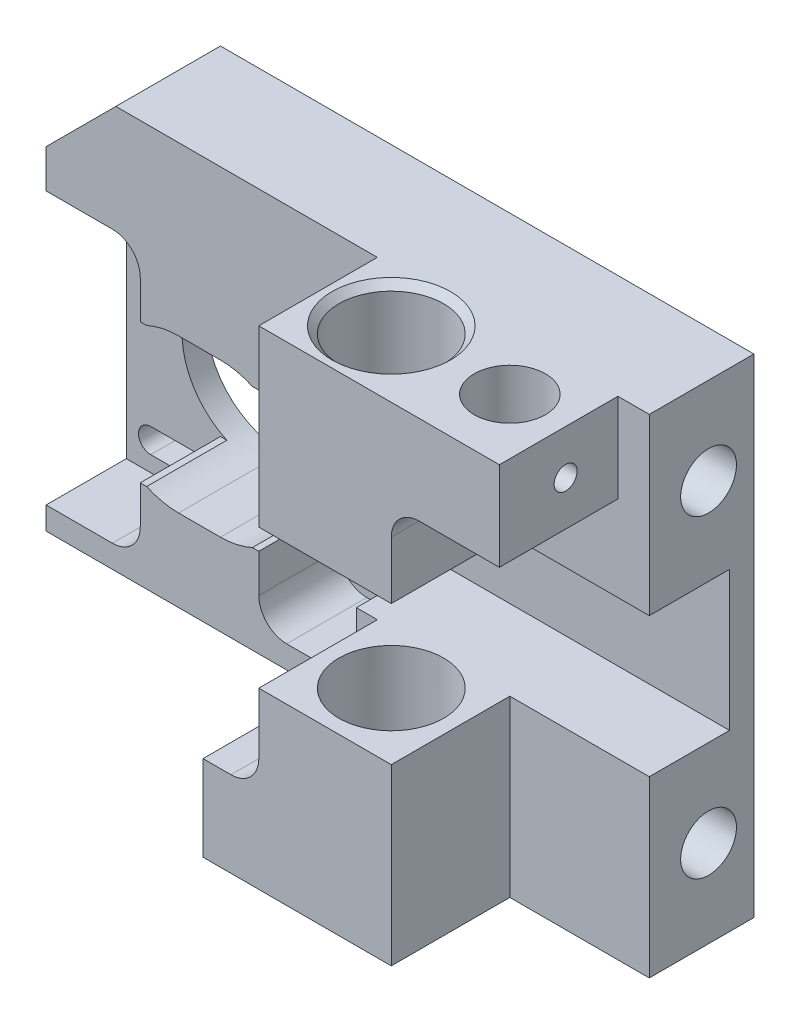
ISO-10303-21;
HEADER;
FILE_DESCRIPTION(('STEP AP214'),'2;1');
FILE_NAME('part.step','',(''),(''),'','','');
FILE_SCHEMA(('AUTOMOTIVE_DESIGN { 1 0 10303 214 1 1 1 1 }'));
ENDSEC;
DATA;
#1=APPLICATION_CONTEXT('core data for automotive mechanical design processes');
#2=APPLICATION_PROTOCOL_DEFINITION('international standard','automotive_design',2000,#1);
#3=PRODUCT_CONTEXT('',#1,'mechanical');
#4=PRODUCT('Part','Part','',(#3));
#5=PRODUCT_RELATED_PRODUCT_CATEGORY('part','',(#4));
#6=PRODUCT_DEFINITION_FORMATION('','',#4);
#7=PRODUCT_DEFINITION_CONTEXT('part definition',#1,'design');
#8=PRODUCT_DEFINITION('design','',#6,#7);
#9=PRODUCT_DEFINITION_SHAPE('','',#8);
#10=(LENGTH_UNIT() NAMED_UNIT(*) SI_UNIT(.MILLI.,.METRE.));
#11=(NAMED_UNIT(*) PLANE_ANGLE_UNIT() SI_UNIT($,.RADIAN.));
#12=(NAMED_UNIT(*) SI_UNIT($,.STERADIAN.) SOLID_ANGLE_UNIT());
#13=UNCERTAINTY_MEASURE_WITH_UNIT(LENGTH_MEASURE(1.E-05),#10,'distance_accuracy_value','');
#14=(GEOMETRIC_REPRESENTATION_CONTEXT(3) GLOBAL_UNCERTAINTY_ASSIGNED_CONTEXT((#13)) GLOBAL_UNIT_ASSIGNED_CONTEXT((#10,
#11,#12)) REPRESENTATION_CONTEXT('',''));
#15=CARTESIAN_POINT('',(0.,0.,0.));
#16=DIRECTION('',(0.,0.,1.));
#17=DIRECTION('',(1.,0.,0.));
#18=AXIS2_PLACEMENT_3D('',#15,#16,#17);
#19=CARTESIAN_POINT('',(-26.9682169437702,-9.99999999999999,32.));
#20=DIRECTION('',(0.,1.,0.));
#21=DIRECTION('',(0.,0.,1.));
#22=AXIS2_PLACEMENT_3D('',#19,#20,#21);
#23=PLANE('',#22);
#24=DIRECTION('',(0.,0.,-1.));
#25=VECTOR('',#24,1.);
#26=CARTESIAN_POINT('',(19.5,-10.,32.));
#27=LINE('',#26,#25);
#28=CARTESIAN_POINT('',(19.5,-10.,15.));
#29=VERTEX_POINT('',#28);
#30=CARTESIAN_POINT('',(19.5,-9.99999999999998,3.50000000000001));
#31=VERTEX_POINT('',#30);
#32=EDGE_CURVE('E1410',#29,#31,#27,.T.);
#33=ORIENTED_EDGE('',*,*,#32,.F.);
#34=DIRECTION('',(-1.,0.,0.));
#35=VECTOR('',#34,1.);
#36=CARTESIAN_POINT('',(0.,-10.,15.));
#37=LINE('',#36,#35);
#38=CARTESIAN_POINT('',(22.5,-10.,15.));
#39=VERTEX_POINT('',#38);
#40=EDGE_CURVE('E770',#39,#29,#37,.T.);
#41=ORIENTED_EDGE('',*,*,#40,.F.);
#42=DIRECTION('',(0.,0.,1.));
#43=VECTOR('',#42,1.);
#44=CARTESIAN_POINT('',(22.5,-10.,15.));
#45=LINE('',#44,#43);
#46=CARTESIAN_POINT('',(22.5,-10.,32.));
#47=VERTEX_POINT('',#46);
#48=EDGE_CURVE('E779',#39,#47,#45,.T.);
#49=ORIENTED_EDGE('',*,*,#48,.T.);
#50=DIRECTION('',(1.,0.,0.));
#51=VECTOR('',#50,1.);
#52=CARTESIAN_POINT('',(-26.9682169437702,-9.99999999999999,32.));
#53=LINE('',#52,#51);
#54=CARTESIAN_POINT('',(41.5,-10.,32.));
#55=VERTEX_POINT('',#54);
#56=EDGE_CURVE('E774',#47,#55,#53,.T.);
#57=ORIENTED_EDGE('',*,*,#56,.T.);
#58=DIRECTION('',(0.,0.,-1.));
#59=VECTOR('',#58,1.);
#60=CARTESIAN_POINT('',(41.5,-9.99999999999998,15.));
#61=LINE('',#60,#59);
#62=CARTESIAN_POINT('',(41.5,-9.99999999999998,15.));
#63=VERTEX_POINT('',#62);
#64=EDGE_CURVE('E790',#55,#63,#61,.T.);
#65=ORIENTED_EDGE('',*,*,#64,.T.);
#66=DIRECTION('',(-1.,0.,0.));
#67=VECTOR('',#66,1.);
#68=CARTESIAN_POINT('',(0.,-10.,15.));
#69=LINE('',#68,#67);
#70=CARTESIAN_POINT('',(61.5,-10.,15.));
#71=VERTEX_POINT('',#70);
#72=EDGE_CURVE('E772',#71,#63,#69,.T.);
#73=ORIENTED_EDGE('',*,*,#72,.F.);
#74=DIRECTION('',(0.,0.,-1.));
#75=VECTOR('',#74,1.);
#76=CARTESIAN_POINT('',(61.5000000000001,-10.,32.));
#77=LINE('',#76,#75);
#78=CARTESIAN_POINT('',(61.5,-10.,3.5));
#79=VERTEX_POINT('',#78);
#80=EDGE_CURVE('E777',#71,#79,#77,.T.);
#81=ORIENTED_EDGE('',*,*,#80,.T.);
#82=DIRECTION('',(1.,0.,0.));
#83=VECTOR('',#82,1.);
#84=CARTESIAN_POINT('',(-26.9682169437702,-9.99999999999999,3.50000000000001));
#85=LINE('',#84,#83);
#86=EDGE_CURVE('E1039',#31,#79,#85,.T.);
#87=ORIENTED_EDGE('',*,*,#86,.F.);
#88=EDGE_LOOP('',(#33,#41,#49,#57,#65,#73,#81,#87));
#89=FACE_BOUND('',#88,.T.);
#90=CARTESIAN_POINT('',(32.,-9.99999999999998,22.5));
#91=DIRECTION('',(0.,1.,0.));
#92=DIRECTION('',(0.,0.,1.));
#93=AXIS2_PLACEMENT_3D('',#90,#91,#92);
#94=CIRCLE('',#93,7.5);
#95=CARTESIAN_POINT('',(24.5,-9.99999999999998,22.5));
#96=VERTEX_POINT('',#95);
#97=EDGE_CURVE('E766',#96,#96,#94,.F.);
#98=ORIENTED_EDGE('',*,*,#97,.T.);
#99=EDGE_LOOP('',(#98));
#100=FACE_BOUND('',#99,.T.);
#101=ADVANCED_FACE('F104',(#89,#100),#23,.T.);
#102=CARTESIAN_POINT('',(9.50000000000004,15.5,32.));
#103=DIRECTION('',(0.,0.,-1.));
#104=DIRECTION('',(-1.,0.,0.));
#105=AXIS2_PLACEMENT_3D('',#102,#103,#104);
#106=CYLINDRICAL_SURFACE('',#105,1.75000000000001);
#107=DIRECTION('',(0.,0.,-1.));
#108=VECTOR('',#107,1.);
#109=CARTESIAN_POINT('',(9.50000000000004,17.25,32.));
#110=LINE('',#109,#108);
#111=CARTESIAN_POINT('',(9.50000000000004,17.25,3.50000000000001));
#112=VERTEX_POINT('',#111);
#113=CARTESIAN_POINT('',(9.50000000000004,17.25,0.));
#114=VERTEX_POINT('',#113);
#115=EDGE_CURVE('E902',#112,#114,#110,.T.);
#116=ORIENTED_EDGE('',*,*,#115,.F.);
#117=CARTESIAN_POINT('',(9.50000000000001,15.5,3.49999999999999));
#118=DIRECTION('',(0.,0.,1.));
#119=DIRECTION('',(1.,0.,0.));
#120=AXIS2_PLACEMENT_3D('',#117,#118,#119);
#121=CIRCLE('',#120,1.75000000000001);
#122=CARTESIAN_POINT('',(9.50000000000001,13.75,3.5));
#123=VERTEX_POINT('',#122);
#124=EDGE_CURVE('E1291',#112,#123,#121,.T.);
#125=ORIENTED_EDGE('',*,*,#124,.T.);
#126=DIRECTION('',(0.,0.,-1.));
#127=VECTOR('',#126,1.);
#128=CARTESIAN_POINT('',(9.50000000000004,13.75,32.));
#129=LINE('',#128,#127);
#130=CARTESIAN_POINT('',(9.50000000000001,13.75,0.));
#131=VERTEX_POINT('',#130);
#132=EDGE_CURVE('E908',#123,#131,#129,.T.);
#133=ORIENTED_EDGE('',*,*,#132,.T.);
#134=CARTESIAN_POINT('',(9.50000000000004,15.5,0.));
#135=DIRECTION('',(0.,0.,1.));
#136=DIRECTION('',(1.,0.,0.));
#137=AXIS2_PLACEMENT_3D('',#134,#135,#136);
#138=CIRCLE('',#137,1.75000000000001);
#139=EDGE_CURVE('E890',#114,#131,#138,.T.);
#140=ORIENTED_EDGE('',*,*,#139,.F.);
#141=EDGE_LOOP('',(#116,#125,#133,#140));
#142=FACE_BOUND('',#141,.T.);
#143=ADVANCED_FACE('F713',(#142),#106,.F.);
#144=CARTESIAN_POINT('',(9.50000000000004,13.75,32.));
#145=DIRECTION('',(0.,1.,0.));
#146=DIRECTION('',(0.,0.,1.));
#147=AXIS2_PLACEMENT_3D('',#144,#145,#146);
#148=PLANE('',#147);
#149=ORIENTED_EDGE('',*,*,#132,.F.);
#150=DIRECTION('',(1.,0.,0.));
#151=VECTOR('',#150,1.);
#152=CARTESIAN_POINT('',(9.50000000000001,13.75,3.5));
#153=LINE('',#152,#151);
#154=CARTESIAN_POINT('',(15.5,13.75,3.50000000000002));
#155=VERTEX_POINT('',#154);
#156=EDGE_CURVE('E1288',#123,#155,#153,.T.);
#157=ORIENTED_EDGE('',*,*,#156,.T.);
#158=DIRECTION('',(0.,0.,-1.));
#159=VECTOR('',#158,1.);
#160=CARTESIAN_POINT('',(15.5000000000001,13.75,32.));
#161=LINE('',#160,#159);
#162=CARTESIAN_POINT('',(15.5,13.75,0.));
#163=VERTEX_POINT('',#162);
#164=EDGE_CURVE('E906',#155,#163,#161,.T.);
#165=ORIENTED_EDGE('',*,*,#164,.T.);
#166=DIRECTION('',(1.,0.,0.));
#167=VECTOR('',#166,1.);
#168=CARTESIAN_POINT('',(9.50000000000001,13.75,0.));
#169=LINE('',#168,#167);
#170=EDGE_CURVE('E893',#131,#163,#169,.T.);
#171=ORIENTED_EDGE('',*,*,#170,.F.);
#172=EDGE_LOOP('',(#149,#157,#165,#171));
#173=FACE_BOUND('',#172,.T.);
#174=ADVANCED_FACE('F720',(#173),#148,.T.);
#175=CARTESIAN_POINT('',(15.5000000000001,15.5,32.));
#176=DIRECTION('',(0.,0.,-1.));
#177=DIRECTION('',(-1.,0.,0.));
#178=AXIS2_PLACEMENT_3D('',#175,#176,#177);
#179=CYLINDRICAL_SURFACE('',#178,1.75000000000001);
#180=ORIENTED_EDGE('',*,*,#164,.F.);
#181=CARTESIAN_POINT('',(15.5,15.5,3.50000000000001));
#182=DIRECTION('',(0.,0.,1.));
#183=DIRECTION('',(1.,0.,0.));
#184=AXIS2_PLACEMENT_3D('',#181,#182,#183);
#185=CIRCLE('',#184,1.75000000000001);
#186=CARTESIAN_POINT('',(15.5,17.25,3.50000000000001));
#187=VERTEX_POINT('',#186);
#188=EDGE_CURVE('E1285',#155,#187,#185,.T.);
#189=ORIENTED_EDGE('',*,*,#188,.T.);
#190=DIRECTION('',(0.,0.,-1.));
#191=VECTOR('',#190,1.);
#192=CARTESIAN_POINT('',(15.5000000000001,17.25,32.));
#193=LINE('',#192,#191);
#194=CARTESIAN_POINT('',(15.5000000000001,17.25,0.));
#195=VERTEX_POINT('',#194);
#196=EDGE_CURVE('E904',#187,#195,#193,.T.);
#197=ORIENTED_EDGE('',*,*,#196,.T.);
#198=CARTESIAN_POINT('',(15.5,15.5,0.));
#199=DIRECTION('',(0.,0.,1.));
#200=DIRECTION('',(1.,0.,0.));
#201=AXIS2_PLACEMENT_3D('',#198,#199,#200);
#202=CIRCLE('',#201,1.75000000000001);
#203=EDGE_CURVE('E896',#163,#195,#202,.T.);
#204=ORIENTED_EDGE('',*,*,#203,.F.);
#205=EDGE_LOOP('',(#180,#189,#197,#204));
#206=FACE_BOUND('',#205,.T.);
#207=ADVANCED_FACE('F1376',(#206),#179,.F.);
#208=CARTESIAN_POINT('',(9.50000000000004,17.25,32.));
#209=DIRECTION('',(0.,-1.,0.));
#210=DIRECTION('',(0.,0.,-1.));
#211=AXIS2_PLACEMENT_3D('',#208,#209,#210);
#212=PLANE('',#211);
#213=ORIENTED_EDGE('',*,*,#196,.F.);
#214=DIRECTION('',(-1.,0.,0.));
#215=VECTOR('',#214,1.);
#216=CARTESIAN_POINT('',(9.50000000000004,17.25,3.50000000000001));
#217=LINE('',#216,#215);
#218=EDGE_CURVE('E1276',#187,#112,#217,.T.);
#219=ORIENTED_EDGE('',*,*,#218,.T.);
#220=ORIENTED_EDGE('',*,*,#115,.T.);
#221=DIRECTION('',(-1.,0.,0.));
#222=VECTOR('',#221,1.);
#223=CARTESIAN_POINT('',(9.50000000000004,17.25,0.));
#224=LINE('',#223,#222);
#225=EDGE_CURVE('E899',#195,#114,#224,.T.);
#226=ORIENTED_EDGE('',*,*,#225,.F.);
#227=EDGE_LOOP('',(#213,#219,#220,#226));
#228=FACE_BOUND('',#227,.T.);
#229=ADVANCED_FACE('F1370',(#228),#212,.T.);
#230=CARTESIAN_POINT('',(-26.9682169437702,10.,32.));
#231=DIRECTION('',(0.,-1.,0.));
#232=DIRECTION('',(1.,0.,0.));
#233=AXIS2_PLACEMENT_3D('',#230,#231,#232);
#234=PLANE('',#233);
#235=DIRECTION('',(0.,0.,1.));
#236=VECTOR('',#235,1.);
#237=CARTESIAN_POINT('',(19.5,9.99999999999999,32.));
#238=LINE('',#237,#236);
#239=CARTESIAN_POINT('',(19.5,10.,3.49999999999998));
#240=VERTEX_POINT('',#239);
#241=CARTESIAN_POINT('',(19.5,9.99999999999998,15.));
#242=VERTEX_POINT('',#241);
#243=EDGE_CURVE('E1383',#240,#242,#238,.T.);
#244=ORIENTED_EDGE('',*,*,#243,.F.);
#245=DIRECTION('',(-1.,0.,0.));
#246=VECTOR('',#245,1.);
#247=CARTESIAN_POINT('',(-26.9682169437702,10.,3.50000000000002));
#248=LINE('',#247,#246);
#249=CARTESIAN_POINT('',(61.5000000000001,9.99999999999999,3.49999999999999));
#250=VERTEX_POINT('',#249);
#251=EDGE_CURVE('E1040',#250,#240,#248,.T.);
#252=ORIENTED_EDGE('',*,*,#251,.F.);
#253=DIRECTION('',(0.,0.,1.));
#254=VECTOR('',#253,1.);
#255=CARTESIAN_POINT('',(61.5,9.99999999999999,32.));
#256=LINE('',#255,#254);
#257=CARTESIAN_POINT('',(61.5,10.,15.));
#258=VERTEX_POINT('',#257);
#259=EDGE_CURVE('E567',#250,#258,#256,.T.);
#260=ORIENTED_EDGE('',*,*,#259,.T.);
#261=DIRECTION('',(1.,0.,0.));
#262=VECTOR('',#261,1.);
#263=CARTESIAN_POINT('',(0.,9.99999999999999,15.));
#264=LINE('',#263,#262);
#265=CARTESIAN_POINT('',(41.5,9.99999999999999,15.));
#266=VERTEX_POINT('',#265);
#267=EDGE_CURVE('E794',#266,#258,#264,.T.);
#268=ORIENTED_EDGE('',*,*,#267,.F.);
#269=DIRECTION('',(0.,0.,1.));
#270=VECTOR('',#269,1.);
#271=CARTESIAN_POINT('',(41.5,9.99999999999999,15.));
#272=LINE('',#271,#270);
#273=CARTESIAN_POINT('',(41.5,9.99999999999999,32.));
#274=VERTEX_POINT('',#273);
#275=EDGE_CURVE('E797',#266,#274,#272,.T.);
#276=ORIENTED_EDGE('',*,*,#275,.T.);
#277=DIRECTION('',(-1.,0.,0.));
#278=VECTOR('',#277,1.);
#279=CARTESIAN_POINT('',(-26.9682169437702,10.,32.));
#280=LINE('',#279,#278);
#281=CARTESIAN_POINT('',(22.5,9.99999999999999,32.));
#282=VERTEX_POINT('',#281);
#283=EDGE_CURVE('E767',#274,#282,#280,.T.);
#284=ORIENTED_EDGE('',*,*,#283,.T.);
#285=DIRECTION('',(0.,0.,-1.));
#286=VECTOR('',#285,1.);
#287=CARTESIAN_POINT('',(22.5,9.99999999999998,15.));
#288=LINE('',#287,#286);
#289=CARTESIAN_POINT('',(22.5,9.99999999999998,15.));
#290=VERTEX_POINT('',#289);
#291=EDGE_CURVE('E803',#282,#290,#288,.T.);
#292=ORIENTED_EDGE('',*,*,#291,.T.);
#293=DIRECTION('',(1.,0.,0.));
#294=VECTOR('',#293,1.);
#295=CARTESIAN_POINT('',(0.,9.99999999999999,15.));
#296=LINE('',#295,#294);
#297=EDGE_CURVE('E799',#242,#290,#296,.T.);
#298=ORIENTED_EDGE('',*,*,#297,.F.);
#299=EDGE_LOOP('',(#244,#252,#260,#268,#276,#284,#292,#298));
#300=FACE_BOUND('',#299,.T.);
#301=CARTESIAN_POINT('',(32.,9.99999999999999,22.5));
#302=DIRECTION('',(0.,-1.,0.));
#303=DIRECTION('',(1.,0.,0.));
#304=AXIS2_PLACEMENT_3D('',#301,#302,#303);
#305=CIRCLE('',#304,7.5);
#306=CARTESIAN_POINT('',(24.5,10.,22.5));
#307=VERTEX_POINT('',#306);
#308=EDGE_CURVE('E807',#307,#307,#305,.F.);
#309=ORIENTED_EDGE('',*,*,#308,.T.);
#310=EDGE_LOOP('',(#309));
#311=FACE_BOUND('',#310,.T.);
#312=ADVANCED_FACE('F742',(#300,#311),#234,.T.);
#313=CARTESIAN_POINT('',(0.,0.,32.));
#314=DIRECTION('',(0.,0.,1.));
#315=DIRECTION('',(1.,0.,0.));
#316=AXIS2_PLACEMENT_3D('',#313,#314,#315);
#317=PLANE('',#316);
#318=CARTESIAN_POINT('',(18.5,-18.75,32.));
#319=DIRECTION('',(0.,0.,1.));
#320=DIRECTION('',(1.,0.,0.));
#321=AXIS2_PLACEMENT_3D('',#318,#319,#320);
#322=CIRCLE('',#321,4.);
#323=CARTESIAN_POINT('',(18.5,-22.75,32.));
#324=VERTEX_POINT('',#323);
#325=CARTESIAN_POINT('',(22.5,-18.75,32.));
#326=VERTEX_POINT('',#325);
#327=EDGE_CURVE('E1105',#324,#326,#322,.T.);
#328=ORIENTED_EDGE('',*,*,#327,.F.);
#329=DIRECTION('',(1.,0.,0.));
#330=VECTOR('',#329,1.);
#331=CARTESIAN_POINT('',(0.,-22.75,32.));
#332=LINE('',#331,#330);
#333=CARTESIAN_POINT('',(14.5,-22.75,32.));
#334=VERTEX_POINT('',#333);
#335=EDGE_CURVE('E1103',#334,#324,#332,.T.);
#336=ORIENTED_EDGE('',*,*,#335,.F.);
#337=DIRECTION('',(0.,-1.,0.));
#338=VECTOR('',#337,1.);
#339=CARTESIAN_POINT('',(14.5,-22.75,32.));
#340=LINE('',#339,#338);
#341=CARTESIAN_POINT('',(14.5,-35.,32.));
#342=VERTEX_POINT('',#341);
#343=EDGE_CURVE('E971',#334,#342,#340,.T.);
#344=ORIENTED_EDGE('',*,*,#343,.T.);
#345=DIRECTION('',(-1.,0.,0.));
#346=VECTOR('',#345,1.);
#347=CARTESIAN_POINT('',(0.,-35.,32.));
#348=LINE('',#347,#346);
#349=CARTESIAN_POINT('',(41.5,-35.,32.));
#350=VERTEX_POINT('',#349);
#351=EDGE_CURVE('E1196',#350,#342,#348,.T.);
#352=ORIENTED_EDGE('',*,*,#351,.F.);
#353=DIRECTION('',(0.,-1.,0.));
#354=VECTOR('',#353,1.);
#355=CARTESIAN_POINT('',(41.5,0.,32.));
#356=LINE('',#355,#354);
#357=EDGE_CURVE('E842',#55,#350,#356,.T.);
#358=ORIENTED_EDGE('',*,*,#357,.F.);
#359=ORIENTED_EDGE('',*,*,#56,.F.);
#360=DIRECTION('',(0.,1.,0.));
#361=VECTOR('',#360,1.);
#362=CARTESIAN_POINT('',(22.5,0.,32.));
#363=LINE('',#362,#361);
#364=EDGE_CURVE('E868',#326,#47,#363,.T.);
#365=ORIENTED_EDGE('',*,*,#364,.F.);
#366=EDGE_LOOP('',(#328,#336,#344,#352,#358,#359,#365));
#367=FACE_BOUND('',#366,.T.);
#368=ADVANCED_FACE('F1152',(#367),#317,.T.);
#369=CARTESIAN_POINT('',(14.5,-22.75,32.));
#370=DIRECTION('',(1.,0.,0.));
#371=DIRECTION('',(0.,1.,0.));
#372=AXIS2_PLACEMENT_3D('',#369,#370,#371);
#373=PLANE('',#372);
#374=DIRECTION('',(0.,0.,-1.));
#375=VECTOR('',#374,1.);
#376=CARTESIAN_POINT('',(14.5,-22.75,32.));
#377=LINE('',#376,#375);
#378=CARTESIAN_POINT('',(14.5,-22.75,15.));
#379=VERTEX_POINT('',#378);
#380=EDGE_CURVE('E1120',#334,#379,#377,.T.);
#381=ORIENTED_EDGE('',*,*,#380,.T.);
#382=DIRECTION('',(0.,0.,-1.));
#383=VECTOR('',#382,1.);
#384=CARTESIAN_POINT('',(14.5,-22.75,32.));
#385=LINE('',#384,#383);
#386=CARTESIAN_POINT('',(14.5,-22.75,0.));
#387=VERTEX_POINT('',#386);
#388=EDGE_CURVE('E973',#379,#387,#385,.T.);
#389=ORIENTED_EDGE('',*,*,#388,.T.);
#390=DIRECTION('',(0.,-1.,0.));
#391=VECTOR('',#390,1.);
#392=CARTESIAN_POINT('',(14.5,-22.75,0.));
#393=LINE('',#392,#391);
#394=CARTESIAN_POINT('',(14.5,-35.,0.));
#395=VERTEX_POINT('',#394);
#396=EDGE_CURVE('E980',#387,#395,#393,.T.);
#397=ORIENTED_EDGE('',*,*,#396,.T.);
#398=DIRECTION('',(0.,0.,-1.));
#399=VECTOR('',#398,1.);
#400=CARTESIAN_POINT('',(14.5,-35.,0.));
#401=LINE('',#400,#399);
#402=EDGE_CURVE('E1188',#342,#395,#401,.T.);
#403=ORIENTED_EDGE('',*,*,#402,.F.);
#404=ORIENTED_EDGE('',*,*,#343,.F.);
#405=EDGE_LOOP('',(#381,#389,#397,#403,#404));
#406=FACE_BOUND('',#405,.T.);
#407=ADVANCED_FACE('F1158',(#406),#373,.F.);
#408=CARTESIAN_POINT('',(19.,-21.75,20.5));
#409=DIRECTION('',(0.,1.,0.));
#410=DIRECTION('',(0.,0.,1.));
#411=AXIS2_PLACEMENT_3D('',#408,#409,#410);
#412=CYLINDRICAL_SURFACE('',#411,1.64999999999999);
#413=CARTESIAN_POINT('',(19.,-22.75,20.5));
#414=DIRECTION('',(0.,1.,0.));
#415=DIRECTION('',(0.,0.,1.));
#416=AXIS2_PLACEMENT_3D('',#413,#414,#415);
#417=CIRCLE('',#416,1.64999999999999);
#418=CARTESIAN_POINT('',(18.5,-22.75,22.0724185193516));
#419=VERTEX_POINT('',#418);
#420=CARTESIAN_POINT('',(18.5,-22.75,18.9275814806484));
#421=VERTEX_POINT('',#420);
#422=EDGE_CURVE('E1349',#419,#421,#417,.F.);
#423=ORIENTED_EDGE('',*,*,#422,.F.);
#424=CARTESIAN_POINT('',(18.5,-22.75,18.9275814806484));
#425=CARTESIAN_POINT('',(18.5416721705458,-22.750002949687,18.9143291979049));
#426=CARTESIAN_POINT('',(18.5838538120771,-22.7493478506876,18.9027430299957));
#427=CARTESIAN_POINT('',(18.6689564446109,-22.7466565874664,18.882959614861));
#428=CARTESIAN_POINT('',(18.7118773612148,-22.7446205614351,18.8747620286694));
#429=CARTESIAN_POINT('',(18.8410036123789,-22.7363651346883,18.8553845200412));
#430=CARTESIAN_POINT('',(18.9279039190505,-22.7279993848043,18.8493150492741));
#431=CARTESIAN_POINT('',(19.1008033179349,-22.7055850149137,18.8508098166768));
#432=CARTESIAN_POINT('',(19.1868022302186,-22.6915352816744,18.8583767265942));
#433=CARTESIAN_POINT('',(19.3556456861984,-22.6583599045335,18.8865118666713));
#434=CARTESIAN_POINT('',(19.438489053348,-22.6392323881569,18.9070848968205));
#435=CARTESIAN_POINT('',(19.6013958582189,-22.5963267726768,18.9610393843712));
#436=CARTESIAN_POINT('',(19.6813112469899,-22.572430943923,18.9947715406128));
#437=CARTESIAN_POINT('',(19.8342163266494,-22.5217853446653,19.0738164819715));
#438=CARTESIAN_POINT('',(19.9072024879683,-22.4950341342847,19.1191351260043));
#439=CARTESIAN_POINT('',(20.0513928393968,-22.4377823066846,19.2249343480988));
#440=CARTESIAN_POINT('',(20.1218069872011,-22.4071638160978,19.2864299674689));
#441=CARTESIAN_POINT('',(20.2515150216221,-22.3468487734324,19.4206804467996));
#442=CARTESIAN_POINT('',(20.3108011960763,-22.3171528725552,19.4934430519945));
#443=CARTESIAN_POINT('',(20.4188719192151,-22.2602438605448,19.6521301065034));
#444=CARTESIAN_POINT('',(20.4671329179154,-22.2331803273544,19.7384687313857));
#445=CARTESIAN_POINT('',(20.5478915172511,-22.186326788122,19.920029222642));
#446=CARTESIAN_POINT('',(20.5804107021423,-22.1665268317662,20.0152387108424));
#447=CARTESIAN_POINT('',(20.6251694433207,-22.1388462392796,20.2009408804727));
#448=CARTESIAN_POINT('',(20.6392167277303,-22.1299110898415,20.2908362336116));
#449=CARTESIAN_POINT('',(20.6522588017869,-22.1216248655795,20.4721218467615));
#450=CARTESIAN_POINT('',(20.6512669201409,-22.122265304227,20.5635107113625));
#451=CARTESIAN_POINT('',(20.63543066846,-22.1323058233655,20.7327115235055));
#452=CARTESIAN_POINT('',(20.6223687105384,-22.1405785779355,20.8107688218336));
#453=CARTESIAN_POINT('',(20.5855467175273,-22.1633502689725,20.9633620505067));
#454=CARTESIAN_POINT('',(20.561783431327,-22.1778510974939,21.0378969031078));
#455=CARTESIAN_POINT('',(20.5033106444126,-22.2123601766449,21.1848904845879));
#456=CARTESIAN_POINT('',(20.468189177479,-22.2325713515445,21.2571359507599));
#457=CARTESIAN_POINT('',(20.3884493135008,-22.276447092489,21.3950191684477));
#458=CARTESIAN_POINT('',(20.3438267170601,-22.3001131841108,21.4606539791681));
#459=CARTESIAN_POINT('',(20.2389052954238,-22.3527948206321,21.5935191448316));
#460=CARTESIAN_POINT('',(20.1772694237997,-22.3820872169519,21.6595867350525));
#461=CARTESIAN_POINT('',(20.0440510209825,-22.4406919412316,21.7808508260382));
#462=CARTESIAN_POINT('',(19.9724619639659,-22.4700042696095,21.8360401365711));
#463=CARTESIAN_POINT('',(19.8146125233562,-22.5288126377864,21.9382011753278));
#464=CARTESIAN_POINT('',(19.7276397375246,-22.5581400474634,21.9841784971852));
#465=CARTESIAN_POINT('',(19.5456446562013,-22.6120736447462,22.0602831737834));
#466=CARTESIAN_POINT('',(19.4506259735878,-22.6366819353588,22.0904175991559));
#467=CARTESIAN_POINT('',(19.2607663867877,-22.6781223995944,22.1319963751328));
#468=CARTESIAN_POINT('',(19.1662130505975,-22.6953126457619,22.1443922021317));
#469=CARTESIAN_POINT('',(18.9754352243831,-22.7228083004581,22.1525663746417));
#470=CARTESIAN_POINT('',(18.879213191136,-22.7331230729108,22.1483673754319));
#471=CARTESIAN_POINT('',(18.7358512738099,-22.743334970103,22.1294458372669));
#472=CARTESIAN_POINT('',(18.6879888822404,-22.7458614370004,22.1209601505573));
#473=CARTESIAN_POINT('',(18.5932094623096,-22.7491950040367,22.0998043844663));
#474=CARTESIAN_POINT('',(18.5462911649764,-22.7500045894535,22.0871403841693));
#475=CARTESIAN_POINT('',(18.5,-22.75,22.0724185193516));
#476=B_SPLINE_CURVE_WITH_KNOTS('',3,(#424,#425,#426,#427,#428,#429,#430,#431,#432,#433,#434,
#435,#436,#437,#438,#439,#440,#441,#442,#443,#444,#445,#446,#447,#448,#449,#450,#451,#452,#453,
#454,#455,#456,#457,#458,#459,#460,#461,#462,#463,#464,#465,#466,#467,#468,#469,#470,#471,#472,
#473,#474,#475),.UNSPECIFIED.,.F.,.F.,(4,2,2,2,2,2,2,2,2,2,2,2,2,2,2,2,2,2,2,2,2,2,2,2,2,4),(0.,
0.131106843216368,0.26220056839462,0.523358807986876,0.784568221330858,1.04587409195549,
1.31468040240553,1.58362290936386,1.8774553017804,2.17149058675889,2.47745331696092,
2.78299533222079,3.05561179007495,3.32798665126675,3.56563187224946,3.80334933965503,
4.05089566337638,4.29855162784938,4.58231800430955,4.86627131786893,5.17267003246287,
5.47893188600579,5.76805639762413,6.05678633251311,6.20261775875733,6.34823794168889),.UNSPECIFIED.);
#477=EDGE_CURVE('E1342',#421,#419,#476,.T.);
#478=ORIENTED_EDGE('',*,*,#477,.F.);
#479=EDGE_LOOP('',(#423,#478));
#480=FACE_BOUND('',#479,.T.);
#481=CARTESIAN_POINT('',(19.,-35.,20.5));
#482=DIRECTION('',(0.,-1.,0.));
#483=DIRECTION('',(0.,0.,-1.));
#484=AXIS2_PLACEMENT_3D('',#481,#482,#483);
#485=CIRCLE('',#484,1.65);
#486=CARTESIAN_POINT('',(19.,-35.,18.85));
#487=VERTEX_POINT('',#486);
#488=EDGE_CURVE('E1197',#487,#487,#485,.F.);
#489=ORIENTED_EDGE('',*,*,#488,.F.);
#490=EDGE_LOOP('',(#489));
#491=FACE_BOUND('',#490,.T.);
#492=ADVANCED_FACE('F1160',(#480,#491),#412,.F.);
#493=CARTESIAN_POINT('',(-25.,30.25,32.));
#494=DIRECTION('',(1.,0.,0.));
#495=DIRECTION('',(0.,1.,0.));
#496=AXIS2_PLACEMENT_3D('',#493,#494,#495);
#497=PLANE('',#496);
#498=DIRECTION('',(0.,-1.,0.));
#499=VECTOR('',#498,1.);
#500=CARTESIAN_POINT('',(-25.,0.,15.));
#501=LINE('',#500,#499);
#502=CARTESIAN_POINT('',(-25.,-19.5,15.));
#503=VERTEX_POINT('',#502);
#504=CARTESIAN_POINT('',(-25.,-22.75,15.));
#505=VERTEX_POINT('',#504);
#506=EDGE_CURVE('E852',#503,#505,#501,.T.);
#507=ORIENTED_EDGE('',*,*,#506,.F.);
#508=DIRECTION('',(0.,0.,-1.));
#509=VECTOR('',#508,1.);
#510=CARTESIAN_POINT('',(-25.,-19.5,32.));
#511=LINE('',#510,#509);
#512=CARTESIAN_POINT('',(-25.,-19.5,3.5));
#513=VERTEX_POINT('',#512);
#514=EDGE_CURVE('E1087',#503,#513,#511,.T.);
#515=ORIENTED_EDGE('',*,*,#514,.T.);
#516=DIRECTION('',(0.,1.,0.));
#517=VECTOR('',#516,1.);
#518=CARTESIAN_POINT('',(-25.,5.,3.49999999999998));
#519=LINE('',#518,#517);
#520=CARTESIAN_POINT('',(-25.,19.5,3.49999999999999));
#521=VERTEX_POINT('',#520);
#522=EDGE_CURVE('E812',#513,#521,#519,.T.);
#523=ORIENTED_EDGE('',*,*,#522,.T.);
#524=DIRECTION('',(0.,0.,1.));
#525=VECTOR('',#524,1.);
#526=CARTESIAN_POINT('',(-25.,19.5,32.));
#527=LINE('',#526,#525);
#528=CARTESIAN_POINT('',(-25.,19.5,15.));
#529=VERTEX_POINT('',#528);
#530=EDGE_CURVE('E1099',#521,#529,#527,.T.);
#531=ORIENTED_EDGE('',*,*,#530,.T.);
#532=CARTESIAN_POINT('',(-25.,25.,15.));
#533=VERTEX_POINT('',#532);
#534=EDGE_CURVE('E854',#533,#529,#501,.T.);
#535=ORIENTED_EDGE('',*,*,#534,.F.);
#536=DIRECTION('',(0.,0.,-1.));
#537=VECTOR('',#536,1.);
#538=CARTESIAN_POINT('',(-25.,24.9999999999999,0.));
#539=LINE('',#538,#537);
#540=CARTESIAN_POINT('',(-25.,24.9999999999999,0.));
#541=VERTEX_POINT('',#540);
#542=EDGE_CURVE('E1177',#533,#541,#539,.T.);
#543=ORIENTED_EDGE('',*,*,#542,.T.);
#544=DIRECTION('',(0.,-1.,0.));
#545=VECTOR('',#544,1.);
#546=CARTESIAN_POINT('',(-25.,30.25,0.));
#547=LINE('',#546,#545);
#548=CARTESIAN_POINT('',(-25.,-22.75,0.));
#549=VERTEX_POINT('',#548);
#550=EDGE_CURVE('E970',#541,#549,#547,.T.);
#551=ORIENTED_EDGE('',*,*,#550,.T.);
#552=DIRECTION('',(0.,0.,-1.));
#553=VECTOR('',#552,1.);
#554=CARTESIAN_POINT('',(-25.,-22.75,32.));
#555=LINE('',#554,#553);
#556=EDGE_CURVE('E984',#505,#549,#555,.T.);
#557=ORIENTED_EDGE('',*,*,#556,.F.);
#558=EDGE_LOOP('',(#507,#515,#523,#531,#535,#543,#551,#557));
#559=FACE_BOUND('',#558,.T.);
#560=ADVANCED_FACE('F637',(#559),#497,.F.);
#561=CARTESIAN_POINT('',(-25.,-22.75,32.));
#562=DIRECTION('',(0.,1.,0.));
#563=DIRECTION('',(0.,0.,1.));
#564=AXIS2_PLACEMENT_3D('',#561,#562,#563);
#565=PLANE('',#564);
#566=DIRECTION('',(1.,0.,0.));
#567=VECTOR('',#566,1.);
#568=CARTESIAN_POINT('',(-27.6790459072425,-22.75,15.));
#569=LINE('',#568,#567);
#570=EDGE_CURVE('E1123',#505,#379,#569,.T.);
#571=ORIENTED_EDGE('',*,*,#570,.F.);
#572=ORIENTED_EDGE('',*,*,#556,.T.);
#573=DIRECTION('',(1.,0.,0.));
#574=VECTOR('',#573,1.);
#575=CARTESIAN_POINT('',(-25.,-22.75,0.));
#576=LINE('',#575,#574);
#577=EDGE_CURVE('E977',#549,#387,#576,.T.);
#578=ORIENTED_EDGE('',*,*,#577,.T.);
#579=ORIENTED_EDGE('',*,*,#388,.F.);
#580=EDGE_LOOP('',(#571,#572,#578,#579));
#581=FACE_BOUND('',#580,.T.);
#582=ADVANCED_FACE('F1156',(#581),#565,.F.);
#583=CARTESIAN_POINT('',(61.5000000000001,-29.75,32.));
#584=DIRECTION('',(-1.,0.,0.));
#585=DIRECTION('',(0.,0.,1.));
#586=AXIS2_PLACEMENT_3D('',#583,#584,#585);
#587=PLANE('',#586);
#588=CARTESIAN_POINT('',(61.5,-22.5,6.50000000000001));
#589=DIRECTION('',(1.,0.,0.));
#590=DIRECTION('',(0.,0.,-1.));
#591=AXIS2_PLACEMENT_3D('',#588,#589,#590);
#592=CIRCLE('',#591,4.);
#593=CARTESIAN_POINT('',(61.5,-22.5,2.50000000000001));
#594=VERTEX_POINT('',#593);
#595=EDGE_CURVE('E690',#594,#594,#592,.T.);
#596=ORIENTED_EDGE('',*,*,#595,.F.);
#597=EDGE_LOOP('',(#596));
#598=FACE_BOUND('',#597,.T.);
#599=CARTESIAN_POINT('',(61.5000000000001,22.5,6.49999999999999));
#600=DIRECTION('',(1.,0.,0.));
#601=DIRECTION('',(0.,0.,-1.));
#602=AXIS2_PLACEMENT_3D('',#599,#600,#601);
#603=CIRCLE('',#602,4.);
#604=CARTESIAN_POINT('',(61.5000000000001,22.5,2.49999999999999));
#605=VERTEX_POINT('',#604);
#606=EDGE_CURVE('E683',#605,#605,#603,.T.);
#607=ORIENTED_EDGE('',*,*,#606,.F.);
#608=EDGE_LOOP('',(#607));
#609=FACE_BOUND('',#608,.T.);
#610=ORIENTED_EDGE('',*,*,#80,.F.);
#611=DIRECTION('',(0.,1.,0.));
#612=VECTOR('',#611,1.);
#613=CARTESIAN_POINT('',(61.5000000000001,0.,15.));
#614=LINE('',#613,#612);
#615=CARTESIAN_POINT('',(61.5,-35.,15.));
#616=VERTEX_POINT('',#615);
#617=EDGE_CURVE('E833',#616,#71,#614,.T.);
#618=ORIENTED_EDGE('',*,*,#617,.F.);
#619=DIRECTION('',(0.,0.,1.));
#620=VECTOR('',#619,1.);
#621=CARTESIAN_POINT('',(61.5,-35.,0.));
#622=LINE('',#621,#620);
#623=CARTESIAN_POINT('',(61.5,-35.,0.));
#624=VERTEX_POINT('',#623);
#625=EDGE_CURVE('E2231',#624,#616,#622,.T.);
#626=ORIENTED_EDGE('',*,*,#625,.F.);
#627=DIRECTION('',(0.,1.,0.));
#628=VECTOR('',#627,1.);
#629=CARTESIAN_POINT('',(61.5000000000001,-29.75,0.));
#630=LINE('',#629,#628);
#631=CARTESIAN_POINT('',(61.5,35.,0.));
#632=VERTEX_POINT('',#631);
#633=EDGE_CURVE('E974',#624,#632,#630,.T.);
#634=ORIENTED_EDGE('',*,*,#633,.T.);
#635=DIRECTION('',(0.,0.,-1.));
#636=VECTOR('',#635,1.);
#637=CARTESIAN_POINT('',(61.5,35.,0.));
#638=LINE('',#637,#636);
#639=CARTESIAN_POINT('',(61.5,35.,15.));
#640=VERTEX_POINT('',#639);
#641=EDGE_CURVE('E1024',#640,#632,#638,.T.);
#642=ORIENTED_EDGE('',*,*,#641,.F.);
#643=EDGE_CURVE('E832',#258,#640,#614,.T.);
#644=ORIENTED_EDGE('',*,*,#643,.F.);
#645=ORIENTED_EDGE('',*,*,#259,.F.);
#646=DIRECTION('',(0.,1.,0.));
#647=VECTOR('',#646,1.);
#648=CARTESIAN_POINT('',(61.5,4.99999999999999,3.5));
#649=LINE('',#648,#647);
#650=EDGE_CURVE('E569',#79,#250,#649,.T.);
#651=ORIENTED_EDGE('',*,*,#650,.F.);
#652=EDGE_LOOP('',(#610,#618,#626,#634,#642,#644,#645,#651));
#653=FACE_BOUND('',#652,.T.);
#654=ADVANCED_FACE('F1021',(#598,#609,#653),#587,.F.);
#655=CARTESIAN_POINT('',(22.5,35.,32.));
#656=VERTEX_POINT('',#655);
#657=EDGE_CURVE('E849',#282,#656,#363,.T.);
#658=ORIENTED_EDGE('',*,*,#657,.F.);
#659=ORIENTED_EDGE('',*,*,#283,.F.);
#660=CARTESIAN_POINT('',(41.5,18.25,32.));
#661=VERTEX_POINT('',#660);
#662=EDGE_CURVE('E843',#661,#274,#356,.T.);
#663=ORIENTED_EDGE('',*,*,#662,.F.);
#664=CARTESIAN_POINT('',(45.5,18.25,32.));
#665=DIRECTION('',(0.,0.,1.));
#666=DIRECTION('',(1.,0.,0.));
#667=AXIS2_PLACEMENT_3D('',#664,#665,#666);
#668=CIRCLE('',#667,4.);
#669=CARTESIAN_POINT('',(45.5,22.25,32.));
#670=VERTEX_POINT('',#669);
#671=EDGE_CURVE('E574',#661,#670,#668,.F.);
#672=ORIENTED_EDGE('',*,*,#671,.T.);
#673=DIRECTION('',(-1.,0.,0.));
#674=VECTOR('',#673,1.);
#675=CARTESIAN_POINT('',(0.,22.25,32.));
#676=LINE('',#675,#674);
#677=CARTESIAN_POINT('',(57.,22.25,32.));
#678=VERTEX_POINT('',#677);
#679=EDGE_CURVE('E823',#678,#670,#676,.T.);
#680=ORIENTED_EDGE('',*,*,#679,.F.);
#681=DIRECTION('',(0.,-1.,0.));
#682=VECTOR('',#681,1.);
#683=CARTESIAN_POINT('',(57.,0.,32.));
#684=LINE('',#683,#682);
#685=CARTESIAN_POINT('',(57.,35.,32.));
#686=VERTEX_POINT('',#685);
#687=EDGE_CURVE('E828',#686,#678,#684,.T.);
#688=ORIENTED_EDGE('',*,*,#687,.F.);
#689=DIRECTION('',(1.,0.,0.));
#690=VECTOR('',#689,1.);
#691=CARTESIAN_POINT('',(0.,35.,32.));
#692=LINE('',#691,#690);
#693=EDGE_CURVE('E1129',#656,#686,#692,.T.);
#694=ORIENTED_EDGE('',*,*,#693,.F.);
#695=EDGE_LOOP('',(#658,#659,#663,#672,#680,#688,#694));
#696=FACE_BOUND('',#695,.T.);
#697=ADVANCED_FACE('F998',(#696),#317,.T.);
#698=CARTESIAN_POINT('',(0.,0.,32.));
#699=DIRECTION('',(0.,0.,-1.));
#700=DIRECTION('',(-1.,0.,0.));
#701=AXIS2_PLACEMENT_3D('',#698,#699,#700);
#702=CYLINDRICAL_SURFACE('',#701,11.);
#703=DIRECTION('',(0.,0.,-1.));
#704=VECTOR('',#703,1.);
#705=CARTESIAN_POINT('',(4.58257569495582,10.,32.));
#706=LINE('',#705,#704);
#707=CARTESIAN_POINT('',(4.58257569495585,10.,3.50000000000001));
#708=VERTEX_POINT('',#707);
#709=CARTESIAN_POINT('',(4.58257569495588,9.99999999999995,15.));
#710=VERTEX_POINT('',#709);
#711=EDGE_CURVE('E571',#708,#710,#706,.F.);
#712=ORIENTED_EDGE('',*,*,#711,.T.);
#713=CARTESIAN_POINT('',(0.,0.,15.));
#714=DIRECTION('',(0.,0.,1.));
#715=DIRECTION('',(1.,0.,0.));
#716=AXIS2_PLACEMENT_3D('',#713,#714,#715);
#717=CIRCLE('',#716,11.);
#718=CARTESIAN_POINT('',(0.,11.,15.));
#719=VERTEX_POINT('',#718);
#720=EDGE_CURVE('E862',#719,#710,#717,.F.);
#721=ORIENTED_EDGE('',*,*,#720,.F.);
#722=DIRECTION('',(0.,0.,-1.));
#723=VECTOR('',#722,1.);
#724=CARTESIAN_POINT('',(0.,11.,32.));
#725=LINE('',#724,#723);
#726=CARTESIAN_POINT('',(0.,11.,0.));
#727=VERTEX_POINT('',#726);
#728=EDGE_CURVE('E968',#719,#727,#725,.T.);
#729=ORIENTED_EDGE('',*,*,#728,.T.);
#730=CARTESIAN_POINT('',(0.,0.,0.));
#731=DIRECTION('',(0.,0.,1.));
#732=DIRECTION('',(1.,0.,0.));
#733=AXIS2_PLACEMENT_3D('',#730,#731,#732);
#734=CIRCLE('',#733,11.);
#735=CARTESIAN_POINT('',(0.,-11.,0.));
#736=VERTEX_POINT('',#735);
#737=EDGE_CURVE('E950',#736,#727,#734,.T.);
#738=ORIENTED_EDGE('',*,*,#737,.F.);
#739=DIRECTION('',(0.,0.,-1.));
#740=VECTOR('',#739,1.);
#741=CARTESIAN_POINT('',(0.,-11.,32.));
#742=LINE('',#741,#740);
#743=CARTESIAN_POINT('',(0.,-11.,15.));
#744=VERTEX_POINT('',#743);
#745=EDGE_CURVE('E962',#744,#736,#742,.T.);
#746=ORIENTED_EDGE('',*,*,#745,.F.);
#747=CARTESIAN_POINT('',(4.58257569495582,-10.,15.));
#748=VERTEX_POINT('',#747);
#749=EDGE_CURVE('E861',#748,#744,#717,.F.);
#750=ORIENTED_EDGE('',*,*,#749,.F.);
#751=DIRECTION('',(0.,0.,-1.));
#752=VECTOR('',#751,1.);
#753=CARTESIAN_POINT('',(4.58257569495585,-9.99999999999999,32.));
#754=LINE('',#753,#752);
#755=CARTESIAN_POINT('',(4.58257569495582,-10.,3.49999999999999));
#756=VERTEX_POINT('',#755);
#757=EDGE_CURVE('E781',#748,#756,#754,.T.);
#758=ORIENTED_EDGE('',*,*,#757,.T.);
#759=CARTESIAN_POINT('',(0.,0.,3.50000000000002));
#760=DIRECTION('',(0.,0.,-1.));
#761=DIRECTION('',(-1.,0.,0.));
#762=AXIS2_PLACEMENT_3D('',#759,#760,#761);
#763=CIRCLE('',#762,11.);
#764=EDGE_CURVE('E814',#708,#756,#763,.T.);
#765=ORIENTED_EDGE('',*,*,#764,.F.);
#766=EDGE_LOOP('',(#712,#721,#729,#738,#746,#750,#758,#765));
#767=FACE_BOUND('',#766,.T.);
#768=ADVANCED_FACE('F1878',(#767),#702,.F.);
#769=CARTESIAN_POINT('',(-6.00000000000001,0.,32.));
#770=DIRECTION('',(0.,0.,-1.));
#771=DIRECTION('',(-1.,0.,0.));
#772=AXIS2_PLACEMENT_3D('',#769,#770,#771);
#773=CYLINDRICAL_SURFACE('',#772,11.);
#774=CARTESIAN_POINT('',(-5.99999999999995,0.,15.));
#775=DIRECTION('',(0.,0.,1.));
#776=DIRECTION('',(1.,0.,0.));
#777=AXIS2_PLACEMENT_3D('',#774,#775,#776);
#778=CIRCLE('',#777,11.);
#779=CARTESIAN_POINT('',(-10.5825756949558,10.,15.));
#780=VERTEX_POINT('',#779);
#781=CARTESIAN_POINT('',(-5.99999999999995,11.,15.));
#782=VERTEX_POINT('',#781);
#783=EDGE_CURVE('E857',#780,#782,#778,.F.);
#784=ORIENTED_EDGE('',*,*,#783,.F.);
#785=DIRECTION('',(0.,0.,-1.));
#786=VECTOR('',#785,1.);
#787=CARTESIAN_POINT('',(-10.5825756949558,10.,32.));
#788=LINE('',#787,#786);
#789=CARTESIAN_POINT('',(-10.5825756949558,10.,3.5));
#790=VERTEX_POINT('',#789);
#791=EDGE_CURVE('E792',#780,#790,#788,.T.);
#792=ORIENTED_EDGE('',*,*,#791,.T.);
#793=CARTESIAN_POINT('',(-5.99999999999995,0.,3.49999999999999));
#794=DIRECTION('',(0.,0.,-1.));
#795=DIRECTION('',(-1.,0.,0.));
#796=AXIS2_PLACEMENT_3D('',#793,#794,#795);
#797=CIRCLE('',#796,11.);
#798=CARTESIAN_POINT('',(-10.5825756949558,-9.99999999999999,3.50000000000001));
#799=VERTEX_POINT('',#798);
#800=EDGE_CURVE('E985',#799,#790,#797,.T.);
#801=ORIENTED_EDGE('',*,*,#800,.F.);
#802=DIRECTION('',(0.,0.,-1.));
#803=VECTOR('',#802,1.);
#804=CARTESIAN_POINT('',(-10.5825756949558,-9.99999999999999,32.));
#805=LINE('',#804,#803);
#806=CARTESIAN_POINT('',(-10.5825756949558,-10.,15.));
#807=VERTEX_POINT('',#806);
#808=EDGE_CURVE('E786',#799,#807,#805,.F.);
#809=ORIENTED_EDGE('',*,*,#808,.T.);
#810=CARTESIAN_POINT('',(-5.99999999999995,-11.,15.));
#811=VERTEX_POINT('',#810);
#812=EDGE_CURVE('E765',#811,#807,#778,.F.);
#813=ORIENTED_EDGE('',*,*,#812,.F.);
#814=DIRECTION('',(0.,0.,-1.));
#815=VECTOR('',#814,1.);
#816=CARTESIAN_POINT('',(-6.00000000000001,-11.,32.));
#817=LINE('',#816,#815);
#818=CARTESIAN_POINT('',(-5.99999999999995,-11.,0.));
#819=VERTEX_POINT('',#818);
#820=EDGE_CURVE('E964',#811,#819,#817,.T.);
#821=ORIENTED_EDGE('',*,*,#820,.T.);
#822=CARTESIAN_POINT('',(-5.99999999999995,0.,0.));
#823=DIRECTION('',(0.,0.,1.));
#824=DIRECTION('',(1.,0.,0.));
#825=AXIS2_PLACEMENT_3D('',#822,#823,#824);
#826=CIRCLE('',#825,11.);
#827=CARTESIAN_POINT('',(-5.99999999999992,11.,0.));
#828=VERTEX_POINT('',#827);
#829=EDGE_CURVE('E956',#828,#819,#826,.T.);
#830=ORIENTED_EDGE('',*,*,#829,.F.);
#831=DIRECTION('',(0.,0.,-1.));
#832=VECTOR('',#831,1.);
#833=CARTESIAN_POINT('',(-6.00000000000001,11.,32.));
#834=LINE('',#833,#832);
#835=EDGE_CURVE('E966',#782,#828,#834,.T.);
#836=ORIENTED_EDGE('',*,*,#835,.F.);
#837=EDGE_LOOP('',(#784,#792,#801,#809,#813,#821,#830,#836));
#838=FACE_BOUND('',#837,.T.);
#839=ADVANCED_FACE('F1051',(#838),#773,.F.);
#840=CARTESIAN_POINT('',(22.5,0.,15.));
#841=DIRECTION('',(1.,0.,0.));
#842=DIRECTION('',(0.,0.,-1.));
#843=AXIS2_PLACEMENT_3D('',#840,#841,#842);
#844=PLANE('',#843);
#845=ORIENTED_EDGE('',*,*,#48,.F.);
#846=DIRECTION('',(0.,1.,0.));
#847=VECTOR('',#846,1.);
#848=CARTESIAN_POINT('',(22.5,0.,15.));
#849=LINE('',#848,#847);
#850=CARTESIAN_POINT('',(22.5,-18.75,15.));
#851=VERTEX_POINT('',#850);
#852=EDGE_CURVE('E850',#851,#39,#849,.T.);
#853=ORIENTED_EDGE('',*,*,#852,.F.);
#854=DIRECTION('',(0.,0.,-1.));
#855=VECTOR('',#854,1.);
#856=CARTESIAN_POINT('',(22.5,-18.75,32.));
#857=LINE('',#856,#855);
#858=EDGE_CURVE('E1109',#326,#851,#857,.T.);
#859=ORIENTED_EDGE('',*,*,#858,.F.);
#860=ORIENTED_EDGE('',*,*,#364,.T.);
#861=EDGE_LOOP('',(#845,#853,#859,#860));
#862=FACE_BOUND('',#861,.T.);
#863=ADVANCED_FACE('F1857',(#862),#844,.F.);
#864=ORIENTED_EDGE('',*,*,#291,.F.);
#865=ORIENTED_EDGE('',*,*,#657,.T.);
#866=DIRECTION('',(0.,0.,1.));
#867=VECTOR('',#866,1.);
#868=CARTESIAN_POINT('',(22.5,35.,0.));
#869=LINE('',#868,#867);
#870=CARTESIAN_POINT('',(22.5,35.,15.));
#871=VERTEX_POINT('',#870);
#872=EDGE_CURVE('E1126',#871,#656,#869,.T.);
#873=ORIENTED_EDGE('',*,*,#872,.F.);
#874=EDGE_CURVE('E853',#290,#871,#849,.T.);
#875=ORIENTED_EDGE('',*,*,#874,.F.);
#876=EDGE_LOOP('',(#864,#865,#873,#875));
#877=FACE_BOUND('',#876,.T.);
#878=ADVANCED_FACE('F1846',(#877),#844,.F.);
#879=CARTESIAN_POINT('',(0.,0.,15.));
#880=DIRECTION('',(0.,0.,1.));
#881=DIRECTION('',(1.,0.,0.));
#882=AXIS2_PLACEMENT_3D('',#879,#880,#881);
#883=PLANE('',#882);
#884=DIRECTION('',(0.,1.,0.));
#885=VECTOR('',#884,1.);
#886=CARTESIAN_POINT('',(19.5000000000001,-9.48975721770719,15.));
#887=LINE('',#886,#885);
#888=CARTESIAN_POINT('',(19.5,-15.5,15.));
#889=VERTEX_POINT('',#888);
#890=EDGE_CURVE('E1200',#889,#29,#887,.T.);
#891=ORIENTED_EDGE('',*,*,#890,.F.);
#892=CARTESIAN_POINT('',(15.5,-15.5,15.));
#893=DIRECTION('',(0.,0.,1.));
#894=DIRECTION('',(-1.,0.,0.));
#895=AXIS2_PLACEMENT_3D('',#892,#893,#894);
#896=CIRCLE('',#895,4.);
#897=CARTESIAN_POINT('',(15.5,-19.5,15.));
#898=VERTEX_POINT('',#897);
#899=EDGE_CURVE('E1209',#898,#889,#896,.T.);
#900=ORIENTED_EDGE('',*,*,#899,.F.);
#901=DIRECTION('',(1.,0.,0.));
#902=VECTOR('',#901,1.);
#903=CARTESIAN_POINT('',(15.5,-19.5,15.));
#904=LINE('',#903,#902);
#905=CARTESIAN_POINT('',(9.50000000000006,-19.5,15.));
#906=VERTEX_POINT('',#905);
#907=EDGE_CURVE('E1227',#906,#898,#904,.T.);
#908=ORIENTED_EDGE('',*,*,#907,.F.);
#909=CARTESIAN_POINT('',(9.50000000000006,-15.5,15.));
#910=DIRECTION('',(0.,0.,1.));
#911=DIRECTION('',(-1.,0.,0.));
#912=AXIS2_PLACEMENT_3D('',#909,#910,#911);
#913=CIRCLE('',#912,4.);
#914=CARTESIAN_POINT('',(5.50000000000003,-15.5,15.));
#915=VERTEX_POINT('',#914);
#916=EDGE_CURVE('E1224',#915,#906,#913,.T.);
#917=ORIENTED_EDGE('',*,*,#916,.F.);
#918=DIRECTION('',(0.,-1.,0.));
#919=VECTOR('',#918,1.);
#920=CARTESIAN_POINT('',(5.50000000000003,-9.48975721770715,15.));
#921=LINE('',#920,#919);
#922=CARTESIAN_POINT('',(5.50000000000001,-9.99999999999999,15.));
#923=VERTEX_POINT('',#922);
#924=EDGE_CURVE('E1222',#923,#915,#921,.T.);
#925=ORIENTED_EDGE('',*,*,#924,.F.);
#926=EDGE_CURVE('E769',#923,#748,#37,.T.);
#927=ORIENTED_EDGE('',*,*,#926,.T.);
#928=ORIENTED_EDGE('',*,*,#749,.T.);
#929=DIRECTION('',(-1.,0.,0.));
#930=VECTOR('',#929,1.);
#931=CARTESIAN_POINT('',(0.,-11.,15.));
#932=LINE('',#931,#930);
#933=EDGE_CURVE('E865',#744,#811,#932,.T.);
#934=ORIENTED_EDGE('',*,*,#933,.T.);
#935=ORIENTED_EDGE('',*,*,#812,.T.);
#936=CARTESIAN_POINT('',(-11.5,-9.99999999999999,15.));
#937=VERTEX_POINT('',#936);
#938=EDGE_CURVE('E750',#807,#937,#37,.T.);
#939=ORIENTED_EDGE('',*,*,#938,.T.);
#940=DIRECTION('',(0.,1.,0.));
#941=VECTOR('',#940,1.);
#942=CARTESIAN_POINT('',(-11.5,-9.18929379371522,15.));
#943=LINE('',#942,#941);
#944=CARTESIAN_POINT('',(-11.5,-15.5,15.));
#945=VERTEX_POINT('',#944);
#946=EDGE_CURVE('E763',#945,#937,#943,.T.);
#947=ORIENTED_EDGE('',*,*,#946,.F.);
#948=CARTESIAN_POINT('',(-15.5,-15.5,15.));
#949=DIRECTION('',(0.,0.,1.));
#950=DIRECTION('',(-1.,0.,0.));
#951=AXIS2_PLACEMENT_3D('',#948,#949,#950);
#952=CIRCLE('',#951,4.);
#953=CARTESIAN_POINT('',(-15.5,-19.5,15.));
#954=VERTEX_POINT('',#953);
#955=EDGE_CURVE('E1297',#954,#945,#952,.T.);
#956=ORIENTED_EDGE('',*,*,#955,.F.);
#957=DIRECTION('',(1.,0.,0.));
#958=VECTOR('',#957,1.);
#959=CARTESIAN_POINT('',(-15.5,-19.5,15.));
#960=LINE('',#959,#958);
#961=EDGE_CURVE('E1304',#503,#954,#960,.T.);
#962=ORIENTED_EDGE('',*,*,#961,.F.);
#963=ORIENTED_EDGE('',*,*,#506,.T.);
#964=ORIENTED_EDGE('',*,*,#570,.T.);
#965=DIRECTION('',(1.,0.,0.));
#966=VECTOR('',#965,1.);
#967=CARTESIAN_POINT('',(0.,-22.75,15.));
#968=LINE('',#967,#966);
#969=CARTESIAN_POINT('',(18.5,-22.75,15.));
#970=VERTEX_POINT('',#969);
#971=EDGE_CURVE('E1102',#379,#970,#968,.T.);
#972=ORIENTED_EDGE('',*,*,#971,.T.);
#973=CARTESIAN_POINT('',(18.5,-18.75,15.));
#974=DIRECTION('',(0.,0.,1.));
#975=DIRECTION('',(1.,0.,0.));
#976=AXIS2_PLACEMENT_3D('',#973,#974,#975);
#977=CIRCLE('',#976,4.);
#978=EDGE_CURVE('E1106',#970,#851,#977,.T.);
#979=ORIENTED_EDGE('',*,*,#978,.T.);
#980=ORIENTED_EDGE('',*,*,#852,.T.);
#981=ORIENTED_EDGE('',*,*,#40,.T.);
#982=EDGE_LOOP('',(#891,#900,#908,#917,#925,#927,#928,#934,#935,#939,#947,#956,#962,#963,#964,
#972,#979,#980,#981));
#983=FACE_BOUND('',#982,.T.);
#984=ADVANCED_FACE('F761',(#983),#883,.T.);
#985=DIRECTION('',(0.,1.,0.));
#986=VECTOR('',#985,1.);
#987=CARTESIAN_POINT('',(19.5,15.4999999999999,15.));
#988=LINE('',#987,#986);
#989=CARTESIAN_POINT('',(19.5,15.4999999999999,15.));
#990=VERTEX_POINT('',#989);
#991=EDGE_CURVE('E1247',#242,#990,#988,.T.);
#992=ORIENTED_EDGE('',*,*,#991,.F.);
#993=ORIENTED_EDGE('',*,*,#297,.T.);
#994=ORIENTED_EDGE('',*,*,#874,.T.);
#995=DIRECTION('',(1.,0.,0.));
#996=VECTOR('',#995,1.);
#997=CARTESIAN_POINT('',(0.,35.,15.));
#998=LINE('',#997,#996);
#999=CARTESIAN_POINT('',(-15.,35.,15.));
#1000=VERTEX_POINT('',#999);
#1001=EDGE_CURVE('E1032',#1000,#871,#998,.T.);
#1002=ORIENTED_EDGE('',*,*,#1001,.F.);
#1003=DIRECTION('',(-0.707106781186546,-0.707106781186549,0.));
#1004=VECTOR('',#1003,1.);
#1005=CARTESIAN_POINT('',(-25.,24.9999999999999,15.));
#1006=LINE('',#1005,#1004);
#1007=EDGE_CURVE('E1007',#1000,#533,#1006,.T.);
#1008=ORIENTED_EDGE('',*,*,#1007,.T.);
#1009=ORIENTED_EDGE('',*,*,#534,.T.);
#1010=DIRECTION('',(-1.,0.,0.));
#1011=VECTOR('',#1010,1.);
#1012=CARTESIAN_POINT('',(-29.0366766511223,19.5,15.));
#1013=LINE('',#1012,#1011);
#1014=CARTESIAN_POINT('',(-15.5,19.4999999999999,15.));
#1015=VERTEX_POINT('',#1014);
#1016=EDGE_CURVE('E1067',#1015,#529,#1013,.T.);
#1017=ORIENTED_EDGE('',*,*,#1016,.F.);
#1018=CARTESIAN_POINT('',(-15.5,15.5,15.));
#1019=DIRECTION('',(0.,0.,1.));
#1020=DIRECTION('',(-1.,0.,0.));
#1021=AXIS2_PLACEMENT_3D('',#1018,#1019,#1020);
#1022=CIRCLE('',#1021,4.);
#1023=CARTESIAN_POINT('',(-11.5,15.5,15.));
#1024=VERTEX_POINT('',#1023);
#1025=EDGE_CURVE('E1086',#1024,#1015,#1022,.T.);
#1026=ORIENTED_EDGE('',*,*,#1025,.F.);
#1027=DIRECTION('',(0.,1.,0.));
#1028=VECTOR('',#1027,1.);
#1029=CARTESIAN_POINT('',(-11.5,15.5,15.));
#1030=LINE('',#1029,#1028);
#1031=CARTESIAN_POINT('',(-11.5,9.99999999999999,15.));
#1032=VERTEX_POINT('',#1031);
#1033=EDGE_CURVE('E1073',#1032,#1024,#1030,.T.);
#1034=ORIENTED_EDGE('',*,*,#1033,.F.);
#1035=EDGE_CURVE('E804',#1032,#780,#296,.T.);
#1036=ORIENTED_EDGE('',*,*,#1035,.T.);
#1037=ORIENTED_EDGE('',*,*,#783,.T.);
#1038=DIRECTION('',(1.,0.,0.));
#1039=VECTOR('',#1038,1.);
#1040=CARTESIAN_POINT('',(0.,11.,15.));
#1041=LINE('',#1040,#1039);
#1042=EDGE_CURVE('E859',#782,#719,#1041,.T.);
#1043=ORIENTED_EDGE('',*,*,#1042,.T.);
#1044=ORIENTED_EDGE('',*,*,#720,.T.);
#1045=CARTESIAN_POINT('',(5.50000000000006,9.99999999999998,15.));
#1046=VERTEX_POINT('',#1045);
#1047=EDGE_CURVE('E800',#710,#1046,#296,.T.);
#1048=ORIENTED_EDGE('',*,*,#1047,.T.);
#1049=DIRECTION('',(0.,-1.,0.));
#1050=VECTOR('',#1049,1.);
#1051=CARTESIAN_POINT('',(5.50000000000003,15.4999999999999,15.));
#1052=LINE('',#1051,#1050);
#1053=CARTESIAN_POINT('',(5.50000000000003,15.4999999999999,15.));
#1054=VERTEX_POINT('',#1053);
#1055=EDGE_CURVE('E1251',#1054,#1046,#1052,.T.);
#1056=ORIENTED_EDGE('',*,*,#1055,.F.);
#1057=CARTESIAN_POINT('',(9.50000000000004,15.5,15.));
#1058=DIRECTION('',(0.,0.,1.));
#1059=DIRECTION('',(1.,0.,0.));
#1060=AXIS2_PLACEMENT_3D('',#1057,#1058,#1059);
#1061=CIRCLE('',#1060,4.);
#1062=CARTESIAN_POINT('',(9.50000000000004,19.5,15.));
#1063=VERTEX_POINT('',#1062);
#1064=EDGE_CURVE('E1270',#1063,#1054,#1061,.T.);
#1065=ORIENTED_EDGE('',*,*,#1064,.F.);
#1066=DIRECTION('',(-1.,0.,0.));
#1067=VECTOR('',#1066,1.);
#1068=CARTESIAN_POINT('',(9.50000000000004,19.5,15.));
#1069=LINE('',#1068,#1067);
#1070=CARTESIAN_POINT('',(15.5,19.5,15.));
#1071=VERTEX_POINT('',#1070);
#1072=EDGE_CURVE('E1267',#1071,#1063,#1069,.T.);
#1073=ORIENTED_EDGE('',*,*,#1072,.F.);
#1074=CARTESIAN_POINT('',(15.5,15.5,15.));
#1075=DIRECTION('',(0.,0.,1.));
#1076=DIRECTION('',(-1.,0.,0.));
#1077=AXIS2_PLACEMENT_3D('',#1074,#1075,#1076);
#1078=CIRCLE('',#1077,4.);
#1079=EDGE_CURVE('E1264',#990,#1071,#1078,.T.);
#1080=ORIENTED_EDGE('',*,*,#1079,.F.);
#1081=EDGE_LOOP('',(#992,#993,#994,#1002,#1008,#1009,#1017,#1026,#1034,#1036,#1037,#1043,#1044,
#1048,#1056,#1065,#1073,#1080));
#1082=FACE_BOUND('',#1081,.T.);
#1083=ADVANCED_FACE('F621',(#1082),#883,.T.);
#1084=CARTESIAN_POINT('',(41.5,0.,15.));
#1085=DIRECTION('',(-1.,0.,0.));
#1086=DIRECTION('',(0.,-1.,0.));
#1087=AXIS2_PLACEMENT_3D('',#1084,#1085,#1086);
#1088=PLANE('',#1087);
#1089=ORIENTED_EDGE('',*,*,#64,.F.);
#1090=ORIENTED_EDGE('',*,*,#357,.T.);
#1091=DIRECTION('',(0.,0.,1.));
#1092=VECTOR('',#1091,1.);
#1093=CARTESIAN_POINT('',(41.5,-35.,0.));
#1094=LINE('',#1093,#1092);
#1095=CARTESIAN_POINT('',(41.5,-35.,15.));
#1096=VERTEX_POINT('',#1095);
#1097=EDGE_CURVE('E1202',#1096,#350,#1094,.T.);
#1098=ORIENTED_EDGE('',*,*,#1097,.F.);
#1099=DIRECTION('',(0.,-1.,0.));
#1100=VECTOR('',#1099,1.);
#1101=CARTESIAN_POINT('',(41.5,0.,15.));
#1102=LINE('',#1101,#1100);
#1103=EDGE_CURVE('E827',#63,#1096,#1102,.T.);
#1104=ORIENTED_EDGE('',*,*,#1103,.F.);
#1105=EDGE_LOOP('',(#1089,#1090,#1098,#1104));
#1106=FACE_BOUND('',#1105,.T.);
#1107=ADVANCED_FACE('F618',(#1106),#1088,.F.);
#1108=ORIENTED_EDGE('',*,*,#275,.F.);
#1109=CARTESIAN_POINT('',(41.5,18.25,15.));
#1110=VERTEX_POINT('',#1109);
#1111=EDGE_CURVE('E829',#1110,#266,#1102,.T.);
#1112=ORIENTED_EDGE('',*,*,#1111,.F.);
#1113=DIRECTION('',(0.,0.,1.));
#1114=VECTOR('',#1113,1.);
#1115=CARTESIAN_POINT('',(41.5,18.25,32.));
#1116=LINE('',#1115,#1114);
#1117=CARTESIAN_POINT('',(41.5,18.25,18.9292857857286));
#1118=VERTEX_POINT('',#1117);
#1119=EDGE_CURVE('E631',#1110,#1118,#1116,.T.);
#1120=ORIENTED_EDGE('',*,*,#1119,.T.);
#1121=CARTESIAN_POINT('',(41.5,18.4810704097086,17.2138327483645));
#1122=CARTESIAN_POINT('',(41.5,23.10506678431,18.5844457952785));
#1123=CARTESIAN_POINT('',(46.2396777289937,22.25,18.3309928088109));
#1124=CARTESIAN_POINT('',(41.5,18.4336653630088,17.3735700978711));
#1125=CARTESIAN_POINT('',(41.5,23.0343084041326,18.5709596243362));
#1126=CARTESIAN_POINT('',(46.1817642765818,22.25,18.369457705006));
#1127=CARTESIAN_POINT('',(41.5,18.3943142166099,17.5355310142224));
#1128=CARTESIAN_POINT('',(41.5,22.9571487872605,18.5696256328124));
#1129=CARTESIAN_POINT('',(46.1200478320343,22.25,18.4119488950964));
#1130=CARTESIAN_POINT('',(41.5,18.3304331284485,17.862169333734));
#1131=CARTESIAN_POINT('',(41.5,22.7959507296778,18.5943144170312));
#1132=CARTESIAN_POINT('',(45.9891519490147,22.25,18.5073041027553));
#1133=CARTESIAN_POINT('',(41.5,18.305885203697,18.0268431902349));
#1134=CARTESIAN_POINT('',(41.5,22.7121822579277,18.6197749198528));
#1135=CARTESIAN_POINT('',(45.9199816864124,22.25,18.5601554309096));
#1136=CARTESIAN_POINT('',(41.5,18.2704720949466,18.3551895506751));
#1137=CARTESIAN_POINT('',(41.5,22.543597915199,18.6988345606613));
#1138=CARTESIAN_POINT('',(45.7752306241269,22.25,18.6777793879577));
#1139=CARTESIAN_POINT('',(41.5,18.2594147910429,18.5188422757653));
#1140=CARTESIAN_POINT('',(41.5,22.4589967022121,18.7514158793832));
#1141=CARTESIAN_POINT('',(45.6997565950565,22.25,18.7423692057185));
#1142=CARTESIAN_POINT('',(41.5,18.2486015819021,18.8464252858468));
#1143=CARTESIAN_POINT('',(41.5,22.2919654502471,18.8846403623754));
#1144=CARTESIAN_POINT('',(45.5422127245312,22.25,18.8868084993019));
#1145=CARTESIAN_POINT('',(41.5,18.248841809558,19.0103554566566));
#1146=CARTESIAN_POINT('',(41.5000000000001,22.2095814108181,18.9646442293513));
#1147=CARTESIAN_POINT('',(45.4601451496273,22.25,18.9666527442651));
#1148=CARTESIAN_POINT('',(41.5,18.2584862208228,19.3360434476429));
#1149=CARTESIAN_POINT('',(41.5000000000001,22.0515845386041,19.1510929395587));
#1150=CARTESIAN_POINT('',(45.2917227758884,22.25,19.1438927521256));
#1151=CARTESIAN_POINT('',(41.5,18.2677865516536,19.4978048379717));
#1152=CARTESIAN_POINT('',(41.5,21.9758565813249,19.2566124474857));
#1153=CARTESIAN_POINT('',(45.2054270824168,22.25,19.2410794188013));
#1154=CARTESIAN_POINT('',(41.5,18.2930302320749,19.8208173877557));
#1155=CARTESIAN_POINT('',(41.5,21.8330921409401,19.4933035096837));
#1156=CARTESIAN_POINT('',(45.0301104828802,22.25,19.4570856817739));
#1157=CARTESIAN_POINT('',(41.5,18.3089753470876,19.9820684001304));
#1158=CARTESIAN_POINT('',(41.5,21.7658873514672,19.6239787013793));
#1159=CARTESIAN_POINT('',(44.9410888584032,22.25,19.5759110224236));
#1160=CARTESIAN_POINT('',(41.5,18.3447955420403,20.3044514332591));
#1161=CARTESIAN_POINT('',(41.5,21.6422724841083,19.9094118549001));
#1162=CARTESIAN_POINT('',(44.7640996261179,22.25,19.8387418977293));
#1163=CARTESIAN_POINT('',(41.5,18.3646788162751,20.4655824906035));
#1164=CARTESIAN_POINT('',(41.5,21.5856280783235,20.0638942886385));
#1165=CARTESIAN_POINT('',(44.6761346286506,22.25,19.9827998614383));
#1166=CARTESIAN_POINT('',(41.5,18.4051971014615,20.7877517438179));
#1167=CARTESIAN_POINT('',(41.5,21.4847834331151,20.3942353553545));
#1168=CARTESIAN_POINT('',(44.5073182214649,22.25,20.298249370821));
#1169=CARTESIAN_POINT('',(41.5,18.4258321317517,20.9487899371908));
#1170=CARTESIAN_POINT('',(41.5,21.4402785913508,20.5700422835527));
#1171=CARTESIAN_POINT('',(44.4264669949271,22.25,20.4696416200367));
#1172=CARTESIAN_POINT('',(41.5,18.4547868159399,21.190659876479));
#1173=CARTESIAN_POINT('',(41.5,21.3832337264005,20.8480533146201));
#1174=CARTESIAN_POINT('',(44.3163200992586,22.25,20.746988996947));
#1175=CARTESIAN_POINT('',(41.5,18.4641087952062,21.2713682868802));
#1176=CARTESIAN_POINT('',(41.5,21.3658752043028,20.9427153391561));
#1177=CARTESIAN_POINT('',(44.2814475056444,22.25,20.8428578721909));
#1178=CARTESIAN_POINT('',(41.5,18.4816551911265,21.4329033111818));
#1179=CARTESIAN_POINT('',(41.5,21.3344786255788,21.1358836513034));
#1180=CARTESIAN_POINT('',(44.216516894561,22.25,21.040843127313));
#1181=CARTESIAN_POINT('',(41.5,18.4898796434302,21.5137299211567));
#1182=CARTESIAN_POINT('',(41.5,21.3204048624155,21.2344596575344));
#1183=CARTESIAN_POINT('',(44.186458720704,22.25,21.1429593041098));
#1184=CARTESIAN_POINT('',(41.5,18.5048300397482,21.6755081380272));
#1185=CARTESIAN_POINT('',(41.5,21.2956084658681,21.4347785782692));
#1186=CARTESIAN_POINT('',(44.1322120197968,22.25,21.3526717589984));
#1187=CARTESIAN_POINT('',(41.5,18.5115562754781,21.7564597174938));
#1188=CARTESIAN_POINT('',(41.5,21.2848542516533,21.5366179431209));
#1189=CARTESIAN_POINT('',(44.1080223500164,22.25,21.4602669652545));
#1190=CARTESIAN_POINT('',(41.5,18.5231650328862,21.9184966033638));
#1191=CARTESIAN_POINT('',(41.5,21.2667030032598,21.7426930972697));
#1192=CARTESIAN_POINT('',(44.0664596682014,22.25,21.6798415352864));
#1193=CARTESIAN_POINT('',(41.5,18.5280475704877,21.9995819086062));
#1194=CARTESIAN_POINT('',(41.5,21.2592815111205,21.8470512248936));
#1195=CARTESIAN_POINT('',(44.0490865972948,22.25,21.7918208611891));
#1196=CARTESIAN_POINT('',(41.5,18.5356944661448,22.1616489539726));
#1197=CARTESIAN_POINT('',(41.5,21.2478091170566,22.0570150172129));
#1198=CARTESIAN_POINT('',(44.0219386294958,22.25,22.0184480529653));
#1199=CARTESIAN_POINT('',(41.5,18.5384641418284,22.2426304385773));
#1200=CARTESIAN_POINT('',(41.5,21.2437335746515,22.1627576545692));
#1201=CARTESIAN_POINT('',(44.0121446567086,22.25,22.1330884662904));
#1202=CARTESIAN_POINT('',(41.5,18.5417508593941,22.4046398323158));
#1203=CARTESIAN_POINT('',(41.5,21.238914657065,22.3747968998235));
#1204=CARTESIAN_POINT('',(44.0005269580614,22.25,22.36365044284));
#1205=CARTESIAN_POINT('',(41.5,18.5422679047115,22.4856677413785));
#1206=CARTESIAN_POINT('',(41.5,21.2381642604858,22.4812467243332));
#1207=CARTESIAN_POINT('',(43.9987032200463,22.25,22.4795720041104));
#1208=CARTESIAN_POINT('',(41.5,18.5410197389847,22.6477122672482));
#1209=CARTESIAN_POINT('',(41.5,21.2399864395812,22.6937305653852));
#1210=CARTESIAN_POINT('',(44.0031116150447,22.25,22.7109362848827));
#1211=CARTESIAN_POINT('',(41.5,18.5392543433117,22.7287288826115));
#1212=CARTESIAN_POINT('',(41.5,21.2425619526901,22.7999200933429));
#1213=CARTESIAN_POINT('',(44.0093443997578,22.25,22.8263789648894));
#1214=CARTESIAN_POINT('',(41.5,18.5335414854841,22.8906831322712));
#1215=CARTESIAN_POINT('',(41.5,21.2510252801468,23.0109220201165));
#1216=CARTESIAN_POINT('',(44.0295773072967,22.25,23.0550512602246));
#1217=CARTESIAN_POINT('',(41.5,18.5295940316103,22.9716207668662));
#1218=CARTESIAN_POINT('',(41.5,21.2569252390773,23.115882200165));
#1219=CARTESIAN_POINT('',(44.0435774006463,22.25,23.1682808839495));
#1220=CARTESIAN_POINT('',(41.5,18.5183617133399,23.1558291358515));
#1221=CARTESIAN_POINT('',(41.5,21.2741301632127,23.3524683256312));
#1222=CARTESIAN_POINT('',(44.0836152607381,22.25,23.42189059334));
#1223=CARTESIAN_POINT('',(41.5,18.510454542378,23.2590615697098));
#1224=CARTESIAN_POINT('',(41.5,21.2865103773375,23.4835156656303));
#1225=CARTESIAN_POINT('',(44.1119159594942,22.25,23.5610807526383));
#1226=CARTESIAN_POINT('',(41.5,18.4920958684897,23.4652870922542));
#1227=CARTESIAN_POINT('',(41.5,21.3166055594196,23.7402445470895));
#1228=CARTESIAN_POINT('',(44.1783448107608,22.25,23.8307729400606));
#1229=CARTESIAN_POINT('',(41.5,18.4816444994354,23.568280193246));
#1230=CARTESIAN_POINT('',(41.5,21.3343822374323,23.8661375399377));
#1231=CARTESIAN_POINT('',(44.2164724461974,22.25,23.9612754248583));
#1232=CARTESIAN_POINT('',(41.5,18.4590071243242,23.7742313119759));
#1233=CARTESIAN_POINT('',(41.5,21.3752235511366,24.1114855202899));
#1234=CARTESIAN_POINT('',(44.3004313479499,22.25,24.2121905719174));
#1235=CARTESIAN_POINT('',(41.5,18.4468184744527,23.8771890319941));
#1236=CARTESIAN_POINT('',(41.5,21.3983707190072,24.2310679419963));
#1237=CARTESIAN_POINT('',(44.346274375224,22.25,24.3325874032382));
#1238=CARTESIAN_POINT('',(41.5,18.4216114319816,24.0830018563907));
#1239=CARTESIAN_POINT('',(41.5,21.4498058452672,24.4625861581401));
#1240=CARTESIAN_POINT('',(44.4434169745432,22.25,24.562308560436));
#1241=CARTESIAN_POINT('',(41.5,18.4085930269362,24.1858569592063));
#1242=CARTESIAN_POINT('',(41.5,21.4781745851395,24.5745892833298));
#1243=CARTESIAN_POINT('',(44.4947166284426,22.25,24.6716327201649));
#1244=CARTESIAN_POINT('',(41.5,18.3825954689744,24.3917607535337));
#1245=CARTESIAN_POINT('',(41.5,21.5399014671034,24.7903632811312));
#1246=CARTESIAN_POINT('',(44.6008540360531,22.25,24.879316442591));
#1247=CARTESIAN_POINT('',(41.5,18.3696164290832,24.4948094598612));
#1248=CARTESIAN_POINT('',(41.5,21.5733487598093,24.894120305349));
#1249=CARTESIAN_POINT('',(44.6556979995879,22.25,24.9776558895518));
#1250=CARTESIAN_POINT('',(41.5,18.3445778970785,24.701020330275));
#1251=CARTESIAN_POINT('',(41.5,21.6448909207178,25.0925490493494));
#1252=CARTESIAN_POINT('',(44.7671192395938,22.25,25.1635439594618));
#1253=CARTESIAN_POINT('',(41.5,18.3325184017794,24.804182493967));
#1254=CARTESIAN_POINT('',(41.5,21.6830609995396,25.1871707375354));
#1255=CARTESIAN_POINT('',(44.8236965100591,22.25,25.2510926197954));
#1256=CARTESIAN_POINT('',(41.5,18.3101228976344,25.0106478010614));
#1257=CARTESIAN_POINT('',(41.5,21.7636172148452,25.3667708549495));
#1258=CARTESIAN_POINT('',(44.9371649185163,22.25,25.4160579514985));
#1259=CARTESIAN_POINT('',(41.5,18.2997860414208,25.1139508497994));
#1260=CARTESIAN_POINT('',(41.5,21.8060664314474,25.4516627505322));
#1261=CARTESIAN_POINT('',(44.9940558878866,22.25,25.4934796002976));
#1262=CARTESIAN_POINT('',(41.5,18.2815584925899,25.3207708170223));
#1263=CARTESIAN_POINT('',(41.5,21.8946644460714,25.6114333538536));
#1264=CARTESIAN_POINT('',(45.1071080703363,22.25,25.6390883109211));
#1265=CARTESIAN_POINT('',(41.5,18.2736677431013,25.4242877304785));
#1266=CARTESIAN_POINT('',(41.5,21.9408643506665,25.68618992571));
#1267=CARTESIAN_POINT('',(45.1632693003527,22.25,25.7072755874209));
#1268=CARTESIAN_POINT('',(41.5,18.2566047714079,25.7035775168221));
#1269=CARTESIAN_POINT('',(41.5000000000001,22.0700892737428,25.8745552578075));
#1270=CARTESIAN_POINT('',(45.3125518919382,22.25,25.8798531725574));
#1271=CARTESIAN_POINT('',(41.5,18.2503553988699,25.879551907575));
#1272=CARTESIAN_POINT('',(41.5,22.1555372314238,25.9770473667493));
#1273=CARTESIAN_POINT('',(45.4042245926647,22.25,25.9764560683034));
#1274=CARTESIAN_POINT('',(41.5,18.2496740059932,26.2314723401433));
#1275=CARTESIAN_POINT('',(41.5,22.3312078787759,26.1513220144));
#1276=CARTESIAN_POINT('',(45.5805592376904,22.25,26.150025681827));
#1277=CARTESIAN_POINT('',(41.5,18.255235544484,26.4074183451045));
#1278=CARTESIAN_POINT('',(41.5,22.4214472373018,26.2223441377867));
#1279=CARTESIAN_POINT('',(45.6652249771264,22.25,26.2270030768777));
#1280=CARTESIAN_POINT('',(41.5,18.2807401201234,26.7614937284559));
#1281=CARTESIAN_POINT('',(41.5,22.6036737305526,26.3345205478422));
#1282=CARTESIAN_POINT('',(45.8278928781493,22.25,26.3664472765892));
#1283=CARTESIAN_POINT('',(41.5,18.3009361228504,26.9396065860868));
#1284=CARTESIAN_POINT('',(41.5,22.695489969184,26.3743073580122));
#1285=CARTESIAN_POINT('',(45.9057504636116,22.25,26.4286329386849));
#1286=CARTESIAN_POINT('',(41.5,18.3437152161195,27.2049950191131));
#1287=CARTESIAN_POINT('',(41.5,22.8284955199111,26.4105059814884));
#1288=CARTESIAN_POINT('',(46.0160315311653,22.25,26.5122372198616));
#1289=CARTESIAN_POINT('',(41.5,18.3600901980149,27.2932938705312));
#1290=CARTESIAN_POINT('',(41.5,22.872400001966,26.4186136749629));
#1291=CARTESIAN_POINT('',(46.0517569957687,22.25,26.5385255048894));
#1292=CARTESIAN_POINT('',(41.5,18.3972056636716,27.4690010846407));
#1293=CARTESIAN_POINT('',(41.5,22.9580793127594,26.4271867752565));
#1294=CARTESIAN_POINT('',(46.1210250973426,22.25,26.5881916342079));
#1295=CARTESIAN_POINT('',(41.5,18.4179477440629,27.5564091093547));
#1296=CARTESIAN_POINT('',(41.5,22.9998100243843,26.427568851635));
#1297=CARTESIAN_POINT('',(46.1545669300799,22.25,26.6115684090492));
#1298=CARTESIAN_POINT('',(41.5,18.4409639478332,27.6432378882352));
#1299=CARTESIAN_POINT('',(41.5,23.0398911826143,26.4243023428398));
#1300=CARTESIAN_POINT('',(46.187022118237,22.25,26.6336612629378));
#1301=(BOUNDED_SURFACE() B_SPLINE_SURFACE(3,2,((#1121,#1122,#1123),(#1124,#1125,#1126),(#1127,
#1128,#1129),(#1130,#1131,#1132),(#1133,#1134,#1135),(#1136,#1137,#1138),(#1139,#1140,#1141),
(#1142,#1143,#1144),(#1145,#1146,#1147),(#1148,#1149,#1150),(#1151,#1152,#1153),(#1154,#1155,
#1156),(#1157,#1158,#1159),(#1160,#1161,#1162),(#1163,#1164,#1165),(#1166,#1167,#1168),(#1169,
#1170,#1171),(#1172,#1173,#1174),(#1175,#1176,#1177),(#1178,#1179,#1180),(#1181,#1182,#1183),
(#1184,#1185,#1186),(#1187,#1188,#1189),(#1190,#1191,#1192),(#1193,#1194,#1195),(#1196,#1197,
#1198),(#1199,#1200,#1201),(#1202,#1203,#1204),(#1205,#1206,#1207),(#1208,#1209,#1210),(#1211,
#1212,#1213),(#1214,#1215,#1216),(#1217,#1218,#1219),(#1220,#1221,#1222),(#1223,#1224,#1225),
(#1226,#1227,#1228),(#1229,#1230,#1231),(#1232,#1233,#1234),(#1235,#1236,#1237),(#1238,#1239,
#1240),(#1241,#1242,#1243),(#1244,#1245,#1246),(#1247,#1248,#1249),(#1250,#1251,#1252),(#1253,
#1254,#1255),(#1256,#1257,#1258),(#1259,#1260,#1261),(#1262,#1263,#1264),(#1265,#1266,#1267),
(#1268,#1269,#1270),(#1271,#1272,#1273),(#1274,#1275,#1276),(#1277,#1278,#1279),(#1280,#1281,
#1282),(#1283,#1284,#1285),(#1286,#1287,#1288),(#1289,#1290,#1291),(#1292,#1293,#1294),(#1295,
#1296,#1297),(#1298,#1299,#1300)),.UNSPECIFIED.,.F.,.F.,.F.) B_SPLINE_SURFACE_WITH_KNOTS((4,2,2,
2,2,2,2,2,2,2,2,2,2,2,2,2,2,2,2,2,2,2,2,2,2,2,2,2,2,4),(3,3),(0.,0.499431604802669,
0.998255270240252,1.48988900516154,1.98135445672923,2.46725190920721,2.95327853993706,
3.44032729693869,3.92738859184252,4.17111818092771,4.41483985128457,4.65851402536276,
4.90218609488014,5.14524285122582,5.38829923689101,5.63137528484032,5.8744504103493,
6.18501149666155,6.49555624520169,6.80657873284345,7.11760588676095,7.42919358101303,
7.74078019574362,8.05221308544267,8.36363873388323,8.89157090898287,9.41921524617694,
9.95620466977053,10.2255193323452,10.4949326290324),(0.,1.),
.UNSPECIFIED.) GEOMETRIC_REPRESENTATION_ITEM() RATIONAL_B_SPLINE_SURFACE(((1.,0.638388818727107,
1.),(1.,0.644058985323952,1.),(1.,0.650025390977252,1.),(1.,0.662491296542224,1.),(1.,
0.668990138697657,1.),(1.,0.682378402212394,1.),(1.,0.689260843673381,1.),(1.,0.703401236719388,
1.),(1.,0.710659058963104,1.),(1.,0.72531901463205,1.),(1.,0.732718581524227,1.),(1.,
0.747523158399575,1.),(1.,0.754928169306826,1.),(1.,0.76944149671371,1.),(1.,0.776549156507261,
1.),(1.,0.790019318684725,1.),(1.,0.796381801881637,1.),(1.,0.804964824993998,1.),(1.,
0.8076666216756,1.),(1.,0.812675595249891,1.),(1.,0.814982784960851,1.),(1.,0.819132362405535,
1.),(1.,0.820974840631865,1.),(1.,0.82413290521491,1.),(1.,0.825448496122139,1.),(1.,
0.827501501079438,1.),(1.,0.828240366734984,1.),(1.,0.829116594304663,1.),(1.,0.829253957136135,
1.),(1.,0.828921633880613,1.),(1.,0.828451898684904,1.),(1.,0.8269240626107,1.),(1.,
0.825865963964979,1.),(1.,0.822831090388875,1.),(1.,0.820680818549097,1.),(1.,0.815606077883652,
1.),(1.,0.812681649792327,1.),(1.,0.806198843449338,1.),(1.,0.802639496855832,1.),(1.,
0.795039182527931,1.),(1.,0.790998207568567,1.),(1.,0.782566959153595,1.),(1.,0.778176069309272,
1.),(1.,0.769175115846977,1.),(1.,0.764565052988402,1.),(1.,0.755232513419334,1.),(1.,
0.750510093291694,1.),(1.,0.741035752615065,1.),(1.,0.736283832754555,1.),(1.,0.723529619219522,
1.),(1.,0.715564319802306,1.),(1.,0.699993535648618,1.),(1.,0.692387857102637,1.),(1.,
0.677546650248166,1.),(1.,0.670320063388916,1.),(1.,0.659930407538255,1.),(1.,0.656537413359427,
1.),(1.,0.649909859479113,1.),(1.,0.646675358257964,1.),(1.,0.643523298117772,1.))) REPRESENTATION_ITEM('') SURFACE());
#1302=CARTESIAN_POINT('',(41.5,18.4810704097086,17.2138327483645));
#1303=CARTESIAN_POINT('',(41.5,18.4336653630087,17.3735700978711));
#1304=CARTESIAN_POINT('',(41.5,18.3943142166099,17.5355310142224));
#1305=CARTESIAN_POINT('',(41.5,18.3304331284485,17.862169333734));
#1306=CARTESIAN_POINT('',(41.5,18.305885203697,18.0268431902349));
#1307=CARTESIAN_POINT('',(41.5,18.2704720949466,18.3551895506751));
#1308=CARTESIAN_POINT('',(41.5,18.2594147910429,18.5188422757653));
#1309=CARTESIAN_POINT('',(41.5,18.2486015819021,18.8464252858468));
#1310=CARTESIAN_POINT('',(41.5,18.248841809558,19.0103554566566));
#1311=CARTESIAN_POINT('',(41.5,18.2584862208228,19.3360434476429));
#1312=CARTESIAN_POINT('',(41.5,18.2677865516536,19.4978048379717));
#1313=CARTESIAN_POINT('',(41.5,18.2930302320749,19.8208173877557));
#1314=CARTESIAN_POINT('',(41.5,18.3089753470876,19.9820684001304));
#1315=CARTESIAN_POINT('',(41.5,18.3447955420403,20.3044514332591));
#1316=CARTESIAN_POINT('',(41.5,18.3646788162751,20.4655824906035));
#1317=CARTESIAN_POINT('',(41.5,18.4051971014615,20.7877517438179));
#1318=CARTESIAN_POINT('',(41.5,18.4258321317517,20.9487899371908));
#1319=CARTESIAN_POINT('',(41.5,18.4547868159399,21.190659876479));
#1320=CARTESIAN_POINT('',(41.5,18.4641087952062,21.2713682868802));
#1321=CARTESIAN_POINT('',(41.5,18.4816551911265,21.4329033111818));
#1322=CARTESIAN_POINT('',(41.5,18.4898796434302,21.5137299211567));
#1323=CARTESIAN_POINT('',(41.5,18.5048300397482,21.6755081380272));
#1324=CARTESIAN_POINT('',(41.5,18.5115562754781,21.7564597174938));
#1325=CARTESIAN_POINT('',(41.5,18.5231650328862,21.9184966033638));
#1326=CARTESIAN_POINT('',(41.5,18.5280475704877,21.9995819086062));
#1327=CARTESIAN_POINT('',(41.5,18.5356944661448,22.1616489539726));
#1328=CARTESIAN_POINT('',(41.5,18.5384641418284,22.2426304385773));
#1329=CARTESIAN_POINT('',(41.5,18.5417508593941,22.4046398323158));
#1330=CARTESIAN_POINT('',(41.5,18.5422679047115,22.4856677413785));
#1331=CARTESIAN_POINT('',(41.5,18.5410197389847,22.6477122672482));
#1332=CARTESIAN_POINT('',(41.5,18.5392543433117,22.7287288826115));
#1333=CARTESIAN_POINT('',(41.5,18.5335414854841,22.8906831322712));
#1334=CARTESIAN_POINT('',(41.5,18.5295940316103,22.9716207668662));
#1335=CARTESIAN_POINT('',(41.5,18.5183617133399,23.1558291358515));
#1336=CARTESIAN_POINT('',(41.5,18.510454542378,23.2590615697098));
#1337=CARTESIAN_POINT('',(41.5,18.4920958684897,23.4652870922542));
#1338=CARTESIAN_POINT('',(41.5,18.4816444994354,23.568280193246));
#1339=CARTESIAN_POINT('',(41.5,18.4590071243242,23.7742313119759));
#1340=CARTESIAN_POINT('',(41.5,18.4468184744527,23.8771890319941));
#1341=CARTESIAN_POINT('',(41.5,18.4216114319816,24.0830018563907));
#1342=CARTESIAN_POINT('',(41.5,18.4085930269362,24.1858569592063));
#1343=CARTESIAN_POINT('',(41.5,18.3825954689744,24.3917607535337));
#1344=CARTESIAN_POINT('',(41.5,18.3696164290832,24.4948094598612));
#1345=CARTESIAN_POINT('',(41.5,18.3445778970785,24.701020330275));
#1346=CARTESIAN_POINT('',(41.5,18.3325184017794,24.804182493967));
#1347=CARTESIAN_POINT('',(41.5,18.3101228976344,25.0106478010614));
#1348=CARTESIAN_POINT('',(41.5,18.2997860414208,25.1139508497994));
#1349=CARTESIAN_POINT('',(41.5,18.2815584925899,25.3207708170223));
#1350=CARTESIAN_POINT('',(41.5,18.2736677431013,25.4242877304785));
#1351=CARTESIAN_POINT('',(41.5,18.2566047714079,25.7035775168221));
#1352=CARTESIAN_POINT('',(41.5,18.2503553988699,25.879551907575));
#1353=CARTESIAN_POINT('',(41.5,18.2496740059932,26.2314723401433));
#1354=CARTESIAN_POINT('',(41.5,18.255235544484,26.4074183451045));
#1355=CARTESIAN_POINT('',(41.5,18.2807401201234,26.7614937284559));
#1356=CARTESIAN_POINT('',(41.5,18.3009361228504,26.9396065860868));
#1357=CARTESIAN_POINT('',(41.5,18.3437152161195,27.2049950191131));
#1358=CARTESIAN_POINT('',(41.5,18.3600901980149,27.2932938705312));
#1359=CARTESIAN_POINT('',(41.5,18.3972056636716,27.4690010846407));
#1360=CARTESIAN_POINT('',(41.5,18.4179477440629,27.5564091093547));
#1361=CARTESIAN_POINT('',(41.5,18.4409639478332,27.6432378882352));
#1362=B_SPLINE_CURVE_WITH_KNOTS('',3,(#1302,#1303,#1304,#1305,#1306,#1307,#1308,#1309,#1310,
#1311,#1312,#1313,#1314,#1315,#1316,#1317,#1318,#1319,#1320,#1321,#1322,#1323,#1324,#1325,#1326,
#1327,#1328,#1329,#1330,#1331,#1332,#1333,#1334,#1335,#1336,#1337,#1338,#1339,#1340,#1341,#1342,
#1343,#1344,#1345,#1346,#1347,#1348,#1349,#1350,#1351,#1352,#1353,#1354,#1355,#1356,#1357,#1358,
#1359,#1360,#1361),.UNSPECIFIED.,.F.,.F.,(4,2,2,2,2,2,2,2,2,2,2,2,2,2,2,2,2,2,2,2,2,2,2,2,2,2,2,
2,2,4),(0.,0.499431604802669,0.998255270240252,1.48988900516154,1.98135445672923,
2.46725190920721,2.95327853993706,3.44032729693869,3.92738859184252,4.17111818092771,
4.41483985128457,4.65851402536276,4.90218609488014,5.14524285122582,5.38829923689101,
5.63137528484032,5.8744504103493,6.18501149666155,6.49555624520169,6.80657873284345,
7.11760588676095,7.42919358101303,7.74078019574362,8.05221308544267,8.36363873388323,
8.89157090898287,9.41921524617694,9.95620466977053,10.2255193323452,10.4949326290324),.UNSPECIFIED.);
#1363=CARTESIAN_POINT('',(41.5,18.25,26.0707142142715));
#1364=VERTEX_POINT('',#1363);
#1365=EDGE_CURVE('E564',#1118,#1364,#1362,.T.);
#1366=ORIENTED_EDGE('',*,*,#1365,.T.);
#1367=DIRECTION('',(0.,0.,1.));
#1368=VECTOR('',#1367,1.);
#1369=CARTESIAN_POINT('',(41.5,18.25,32.));
#1370=LINE('',#1369,#1368);
#1371=EDGE_CURVE('E632',#1364,#661,#1370,.T.);
#1372=ORIENTED_EDGE('',*,*,#1371,.T.);
#1373=ORIENTED_EDGE('',*,*,#662,.T.);
#1374=EDGE_LOOP('',(#1108,#1112,#1120,#1366,#1372,#1373));
#1375=FACE_BOUND('',#1374,.T.);
#1376=ADVANCED_FACE('F612',(#1375),#1088,.F.);
#1377=CARTESIAN_POINT('',(0.,0.,15.));
#1378=DIRECTION('',(0.,0.,1.));
#1379=DIRECTION('',(1.,0.,0.));
#1380=AXIS2_PLACEMENT_3D('',#1377,#1378,#1379);
#1381=PLANE('',#1380);
#1382=ORIENTED_EDGE('',*,*,#617,.T.);
#1383=ORIENTED_EDGE('',*,*,#72,.T.);
#1384=ORIENTED_EDGE('',*,*,#1103,.T.);
#1385=DIRECTION('',(-1.,0.,0.));
#1386=VECTOR('',#1385,1.);
#1387=CARTESIAN_POINT('',(0.,-35.,15.));
#1388=LINE('',#1387,#1386);
#1389=EDGE_CURVE('E2230',#616,#1096,#1388,.T.);
#1390=ORIENTED_EDGE('',*,*,#1389,.F.);
#1391=EDGE_LOOP('',(#1382,#1383,#1384,#1390));
#1392=FACE_BOUND('',#1391,.T.);
#1393=ADVANCED_FACE('F609',(#1392),#1381,.T.);
#1394=ORIENTED_EDGE('',*,*,#1111,.T.);
#1395=ORIENTED_EDGE('',*,*,#267,.T.);
#1396=ORIENTED_EDGE('',*,*,#643,.T.);
#1397=DIRECTION('',(1.,0.,0.));
#1398=VECTOR('',#1397,1.);
#1399=CARTESIAN_POINT('',(0.,35.,15.));
#1400=LINE('',#1399,#1398);
#1401=CARTESIAN_POINT('',(57.,35.,15.));
#1402=VERTEX_POINT('',#1401);
#1403=EDGE_CURVE('E1030',#1402,#640,#1400,.T.);
#1404=ORIENTED_EDGE('',*,*,#1403,.F.);
#1405=DIRECTION('',(0.,-1.,0.));
#1406=VECTOR('',#1405,1.);
#1407=CARTESIAN_POINT('',(57.,0.,15.));
#1408=LINE('',#1407,#1406);
#1409=CARTESIAN_POINT('',(57.0000000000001,22.25,15.));
#1410=VERTEX_POINT('',#1409);
#1411=EDGE_CURVE('E836',#1402,#1410,#1408,.T.);
#1412=ORIENTED_EDGE('',*,*,#1411,.T.);
#1413=DIRECTION('',(-1.,0.,0.));
#1414=VECTOR('',#1413,1.);
#1415=CARTESIAN_POINT('',(0.,22.25,15.));
#1416=LINE('',#1415,#1414);
#1417=CARTESIAN_POINT('',(45.5,22.25,15.));
#1418=VERTEX_POINT('',#1417);
#1419=EDGE_CURVE('E824',#1410,#1418,#1416,.T.);
#1420=ORIENTED_EDGE('',*,*,#1419,.T.);
#1421=CARTESIAN_POINT('',(45.5,18.25,15.));
#1422=DIRECTION('',(0.,0.,1.));
#1423=DIRECTION('',(1.,0.,0.));
#1424=AXIS2_PLACEMENT_3D('',#1421,#1422,#1423);
#1425=CIRCLE('',#1424,4.);
#1426=EDGE_CURVE('E1005',#1418,#1110,#1425,.T.);
#1427=ORIENTED_EDGE('',*,*,#1426,.T.);
#1428=EDGE_LOOP('',(#1394,#1395,#1396,#1404,#1412,#1420,#1427));
#1429=FACE_BOUND('',#1428,.T.);
#1430=ADVANCED_FACE('F607',(#1429),#1381,.T.);
#1431=CARTESIAN_POINT('',(32.,-29.75,22.5));
#1432=DIRECTION('',(0.,1.,0.));
#1433=DIRECTION('',(-1.,0.,0.));
#1434=AXIS2_PLACEMENT_3D('',#1431,#1432,#1433);
#1435=CYLINDRICAL_SURFACE('',#1434,7.5);
#1436=CARTESIAN_POINT('',(32.,-34.,22.5));
#1437=DIRECTION('',(0.,-1.,0.));
#1438=DIRECTION('',(0.,0.,-1.));
#1439=AXIS2_PLACEMENT_3D('',#1436,#1437,#1438);
#1440=CIRCLE('',#1439,7.5);
#1441=CARTESIAN_POINT('',(24.5,-34.,22.5));
#1442=VERTEX_POINT('',#1441);
#1443=EDGE_CURVE('E12',#1442,#1442,#1440,.T.);
#1444=CARTESIAN_POINT('',(24.5,-34.,22.5));
#1445=CARTESIAN_POINT('',(24.5,-33.75,22.5));
#1446=CARTESIAN_POINT('',(24.5,-33.5,22.5));
#1447=CARTESIAN_POINT('',(24.5,-33.,22.5));
#1448=CARTESIAN_POINT('',(24.5,-32.75,22.5));
#1449=CARTESIAN_POINT('',(24.5,-32.25,22.5));
#1450=CARTESIAN_POINT('',(24.5,-32.,22.5));
#1451=CARTESIAN_POINT('',(24.5,-31.5,22.5));
#1452=CARTESIAN_POINT('',(24.5,-31.25,22.5));
#1453=CARTESIAN_POINT('',(24.5,-30.75,22.5));
#1454=CARTESIAN_POINT('',(24.5,-30.5,22.5));
#1455=CARTESIAN_POINT('',(24.5,-30.,22.5));
#1456=CARTESIAN_POINT('',(24.5,-29.75,22.5));
#1457=CARTESIAN_POINT('',(24.5,-29.25,22.5));
#1458=CARTESIAN_POINT('',(24.5,-29.,22.5));
#1459=CARTESIAN_POINT('',(24.5,-28.5,22.5));
#1460=CARTESIAN_POINT('',(24.5,-28.25,22.5));
#1461=CARTESIAN_POINT('',(24.5,-27.75,22.5));
#1462=CARTESIAN_POINT('',(24.5,-27.5,22.5));
#1463=CARTESIAN_POINT('',(24.5,-27.,22.5));
#1464=CARTESIAN_POINT('',(24.5,-26.75,22.5));
#1465=CARTESIAN_POINT('',(24.5,-26.25,22.5));
#1466=CARTESIAN_POINT('',(24.5,-26.,22.5));
#1467=CARTESIAN_POINT('',(24.5,-25.5,22.5));
#1468=CARTESIAN_POINT('',(24.5,-25.25,22.5));
#1469=CARTESIAN_POINT('',(24.5,-24.75,22.5));
#1470=CARTESIAN_POINT('',(24.5,-24.5,22.5));
#1471=CARTESIAN_POINT('',(24.5,-24.,22.5));
#1472=CARTESIAN_POINT('',(24.5,-23.75,22.5));
#1473=CARTESIAN_POINT('',(24.5,-23.25,22.5));
#1474=CARTESIAN_POINT('',(24.5,-23.,22.5));
#1475=CARTESIAN_POINT('',(24.5,-22.5,22.5));
#1476=CARTESIAN_POINT('',(24.5,-22.25,22.5));
#1477=CARTESIAN_POINT('',(24.5,-21.75,22.5));
#1478=CARTESIAN_POINT('',(24.5,-21.5,22.5));
#1479=CARTESIAN_POINT('',(24.5,-21.,22.5));
#1480=CARTESIAN_POINT('',(24.5,-20.75,22.5));
#1481=CARTESIAN_POINT('',(24.5,-20.25,22.5));
#1482=CARTESIAN_POINT('',(24.5,-20.,22.5));
#1483=CARTESIAN_POINT('',(24.5,-19.5,22.5));
#1484=CARTESIAN_POINT('',(24.5,-19.25,22.5));
#1485=CARTESIAN_POINT('',(24.5,-18.75,22.5));
#1486=CARTESIAN_POINT('',(24.5,-18.5,22.5));
#1487=CARTESIAN_POINT('',(24.5,-18.,22.5));
#1488=CARTESIAN_POINT('',(24.5,-17.75,22.5));
#1489=CARTESIAN_POINT('',(24.5,-17.25,22.5));
#1490=CARTESIAN_POINT('',(24.5,-17.,22.5));
#1491=CARTESIAN_POINT('',(24.5,-16.5,22.5));
#1492=CARTESIAN_POINT('',(24.5,-16.25,22.5));
#1493=CARTESIAN_POINT('',(24.5,-15.75,22.5));
#1494=CARTESIAN_POINT('',(24.5,-15.5,22.5));
#1495=CARTESIAN_POINT('',(24.5,-15.,22.5));
#1496=CARTESIAN_POINT('',(24.5,-14.75,22.5));
#1497=CARTESIAN_POINT('',(24.5,-14.25,22.5));
#1498=CARTESIAN_POINT('',(24.5,-14.,22.5));
#1499=CARTESIAN_POINT('',(24.5,-13.5,22.5));
#1500=CARTESIAN_POINT('',(24.5,-13.25,22.5));
#1501=CARTESIAN_POINT('',(24.5,-12.75,22.5));
#1502=CARTESIAN_POINT('',(24.5,-12.5,22.5));
#1503=CARTESIAN_POINT('',(24.5,-12.,22.5));
#1504=CARTESIAN_POINT('',(24.5,-11.75,22.5));
#1505=CARTESIAN_POINT('',(24.5,-11.25,22.5));
#1506=CARTESIAN_POINT('',(24.5,-11.,22.5));
#1507=CARTESIAN_POINT('',(24.5,-10.5,22.5));
#1508=CARTESIAN_POINT('',(24.5,-10.25,22.5));
#1509=CARTESIAN_POINT('',(24.5,-9.99999999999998,22.5));
#1510=B_SPLINE_CURVE_WITH_KNOTS('',3,(#1444,#1445,#1446,#1447,#1448,#1449,#1450,#1451,#1452,
#1453,#1454,#1455,#1456,#1457,#1458,#1459,#1460,#1461,#1462,#1463,#1464,#1465,#1466,#1467,#1468,
#1469,#1470,#1471,#1472,#1473,#1474,#1475,#1476,#1477,#1478,#1479,#1480,#1481,#1482,#1483,#1484,
#1485,#1486,#1487,#1488,#1489,#1490,#1491,#1492,#1493,#1494,#1495,#1496,#1497,#1498,#1499,#1500,
#1501,#1502,#1503,#1504,#1505,#1506,#1507,#1508,#1509),.UNSPECIFIED.,.F.,.F.,(4,2,2,2,2,2,2,2,2,
2,2,2,2,2,2,2,2,2,2,2,2,2,2,2,2,2,2,2,2,2,2,2,4),(0.,0.750000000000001,1.5,2.25,3.,3.75,
4.50000000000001,5.25000000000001,6.00000000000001,6.75000000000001,7.50000000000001,
8.25000000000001,9.00000000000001,9.75000000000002,10.5,11.25,12.,12.75,13.5,14.25,15.,15.75,
16.5,17.25,18.,18.75,19.5,20.25,21.,21.75,22.5,23.25,24.),.UNSPECIFIED.);
#1511=EDGE_CURVE('BSEAM603',#1442,#96,#1510,.T.);
#1512=ORIENTED_EDGE('',*,*,#1443,.T.);
#1513=ORIENTED_EDGE('',*,*,#97,.F.);
#1514=ORIENTED_EDGE('',*,*,#1511,.T.);
#1515=ORIENTED_EDGE('',*,*,#1511,.F.);
#1516=EDGE_LOOP('',(#1512,#1514,#1513,#1515));
#1517=FACE_BOUND('',#1516,.T.);
#1518=ADVANCED_FACE('F603',(#1517),#1435,.F.);
#1519=CARTESIAN_POINT('',(32.,34.,22.5));
#1520=DIRECTION('',(0.,1.,0.));
#1521=DIRECTION('',(0.,0.,1.));
#1522=AXIS2_PLACEMENT_3D('',#1519,#1520,#1521);
#1523=CIRCLE('',#1522,7.5);
#1524=CARTESIAN_POINT('',(24.5,34.,22.5));
#1525=VERTEX_POINT('',#1524);
#1526=EDGE_CURVE('E1398',#1525,#1525,#1523,.T.);
#1527=CARTESIAN_POINT('',(24.5,34.,22.5));
#1528=CARTESIAN_POINT('',(24.5,33.75,22.5));
#1529=CARTESIAN_POINT('',(24.5,33.5,22.5));
#1530=CARTESIAN_POINT('',(24.5,33.,22.5));
#1531=CARTESIAN_POINT('',(24.5,32.75,22.5));
#1532=CARTESIAN_POINT('',(24.5,32.25,22.5));
#1533=CARTESIAN_POINT('',(24.5,32.,22.5));
#1534=CARTESIAN_POINT('',(24.5,31.5,22.5));
#1535=CARTESIAN_POINT('',(24.5,31.25,22.5));
#1536=CARTESIAN_POINT('',(24.5,30.75,22.5));
#1537=CARTESIAN_POINT('',(24.5,30.5,22.5));
#1538=CARTESIAN_POINT('',(24.5,30.,22.5));
#1539=CARTESIAN_POINT('',(24.5,29.75,22.5));
#1540=CARTESIAN_POINT('',(24.5,29.25,22.5));
#1541=CARTESIAN_POINT('',(24.5,29.,22.5));
#1542=CARTESIAN_POINT('',(24.5,28.5,22.5));
#1543=CARTESIAN_POINT('',(24.5,28.25,22.5));
#1544=CARTESIAN_POINT('',(24.5,27.75,22.5));
#1545=CARTESIAN_POINT('',(24.5,27.5,22.5));
#1546=CARTESIAN_POINT('',(24.5,27.,22.5));
#1547=CARTESIAN_POINT('',(24.5,26.75,22.5));
#1548=CARTESIAN_POINT('',(24.5,26.25,22.5));
#1549=CARTESIAN_POINT('',(24.5,26.,22.5));
#1550=CARTESIAN_POINT('',(24.5,25.5,22.5));
#1551=CARTESIAN_POINT('',(24.5,25.25,22.5));
#1552=CARTESIAN_POINT('',(24.5,24.75,22.5));
#1553=CARTESIAN_POINT('',(24.5,24.5,22.5));
#1554=CARTESIAN_POINT('',(24.5,24.,22.5));
#1555=CARTESIAN_POINT('',(24.5,23.75,22.5));
#1556=CARTESIAN_POINT('',(24.5,23.25,22.5));
#1557=CARTESIAN_POINT('',(24.5,23.,22.5));
#1558=CARTESIAN_POINT('',(24.5,22.5,22.5));
#1559=CARTESIAN_POINT('',(24.5,22.25,22.5));
#1560=CARTESIAN_POINT('',(24.5,21.75,22.5));
#1561=CARTESIAN_POINT('',(24.5,21.5,22.5));
#1562=CARTESIAN_POINT('',(24.5,21.,22.5));
#1563=CARTESIAN_POINT('',(24.5,20.75,22.5));
#1564=CARTESIAN_POINT('',(24.5,20.25,22.5));
#1565=CARTESIAN_POINT('',(24.5,20.,22.5));
#1566=CARTESIAN_POINT('',(24.5,19.5,22.5));
#1567=CARTESIAN_POINT('',(24.5,19.25,22.5));
#1568=CARTESIAN_POINT('',(24.5,18.75,22.5));
#1569=CARTESIAN_POINT('',(24.5,18.5,22.5));
#1570=CARTESIAN_POINT('',(24.5,18.,22.5));
#1571=CARTESIAN_POINT('',(24.5,17.75,22.5));
#1572=CARTESIAN_POINT('',(24.5,17.25,22.5));
#1573=CARTESIAN_POINT('',(24.5,17.,22.5));
#1574=CARTESIAN_POINT('',(24.5,16.5,22.5));
#1575=CARTESIAN_POINT('',(24.5,16.25,22.5));
#1576=CARTESIAN_POINT('',(24.5,15.75,22.5));
#1577=CARTESIAN_POINT('',(24.5,15.5,22.5));
#1578=CARTESIAN_POINT('',(24.5,15.,22.5));
#1579=CARTESIAN_POINT('',(24.5,14.75,22.5));
#1580=CARTESIAN_POINT('',(24.5,14.25,22.5));
#1581=CARTESIAN_POINT('',(24.5,14.,22.5));
#1582=CARTESIAN_POINT('',(24.5,13.5,22.5));
#1583=CARTESIAN_POINT('',(24.5,13.25,22.5));
#1584=CARTESIAN_POINT('',(24.5,12.75,22.5));
#1585=CARTESIAN_POINT('',(24.5,12.5,22.5));
#1586=CARTESIAN_POINT('',(24.5,12.,22.5));
#1587=CARTESIAN_POINT('',(24.5,11.75,22.5));
#1588=CARTESIAN_POINT('',(24.5,11.25,22.5));
#1589=CARTESIAN_POINT('',(24.5,11.,22.5));
#1590=CARTESIAN_POINT('',(24.5,10.5,22.5));
#1591=CARTESIAN_POINT('',(24.5,10.25,22.5));
#1592=CARTESIAN_POINT('',(24.5,10.,22.5));
#1593=B_SPLINE_CURVE_WITH_KNOTS('',3,(#1527,#1528,#1529,#1530,#1531,#1532,#1533,#1534,#1535,
#1536,#1537,#1538,#1539,#1540,#1541,#1542,#1543,#1544,#1545,#1546,#1547,#1548,#1549,#1550,#1551,
#1552,#1553,#1554,#1555,#1556,#1557,#1558,#1559,#1560,#1561,#1562,#1563,#1564,#1565,#1566,#1567,
#1568,#1569,#1570,#1571,#1572,#1573,#1574,#1575,#1576,#1577,#1578,#1579,#1580,#1581,#1582,#1583,
#1584,#1585,#1586,#1587,#1588,#1589,#1590,#1591,#1592),.UNSPECIFIED.,.F.,.F.,(4,2,2,2,2,2,2,2,2,
2,2,2,2,2,2,2,2,2,2,2,2,2,2,2,2,2,2,2,2,2,2,2,4),(0.,0.750000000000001,1.5,2.25,3.,3.75,4.5,
5.25,6.,6.75,7.5,8.24999999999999,8.99999999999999,9.74999999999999,10.5,11.25,12.,12.75,13.5,
14.25,15.,15.75,16.5,17.25,18.,18.75,19.5,20.25,21.,21.75,22.5,23.25,24.),.UNSPECIFIED.);
#1594=EDGE_CURVE('BSEAM606',#1525,#307,#1593,.T.);
#1595=ORIENTED_EDGE('',*,*,#1526,.T.);
#1596=ORIENTED_EDGE('',*,*,#308,.F.);
#1597=ORIENTED_EDGE('',*,*,#1594,.T.);
#1598=ORIENTED_EDGE('',*,*,#1594,.F.);
#1599=EDGE_LOOP('',(#1595,#1597,#1596,#1598));
#1600=FACE_BOUND('',#1599,.T.);
#1601=ADVANCED_FACE('F606',(#1600),#1435,.F.);
#1602=CARTESIAN_POINT('',(0.,11.,32.));
#1603=DIRECTION('',(0.,-1.,0.));
#1604=DIRECTION('',(0.,0.,-1.));
#1605=AXIS2_PLACEMENT_3D('',#1602,#1603,#1604);
#1606=PLANE('',#1605);
#1607=ORIENTED_EDGE('',*,*,#728,.F.);
#1608=ORIENTED_EDGE('',*,*,#1042,.F.);
#1609=ORIENTED_EDGE('',*,*,#835,.T.);
#1610=DIRECTION('',(-1.,0.,0.));
#1611=VECTOR('',#1610,1.);
#1612=CARTESIAN_POINT('',(0.,11.,0.));
#1613=LINE('',#1612,#1611);
#1614=EDGE_CURVE('E953',#727,#828,#1613,.T.);
#1615=ORIENTED_EDGE('',*,*,#1614,.F.);
#1616=EDGE_LOOP('',(#1607,#1608,#1609,#1615));
#1617=FACE_BOUND('',#1616,.T.);
#1618=ADVANCED_FACE('F1388',(#1617),#1606,.T.);
#1619=CARTESIAN_POINT('',(0.,-11.,32.));
#1620=DIRECTION('',(0.,1.,0.));
#1621=DIRECTION('',(0.,0.,1.));
#1622=AXIS2_PLACEMENT_3D('',#1619,#1620,#1621);
#1623=PLANE('',#1622);
#1624=ORIENTED_EDGE('',*,*,#820,.F.);
#1625=ORIENTED_EDGE('',*,*,#933,.F.);
#1626=ORIENTED_EDGE('',*,*,#745,.T.);
#1627=DIRECTION('',(1.,0.,0.));
#1628=VECTOR('',#1627,1.);
#1629=CARTESIAN_POINT('',(0.,-11.,0.));
#1630=LINE('',#1629,#1628);
#1631=EDGE_CURVE('E959',#819,#736,#1630,.T.);
#1632=ORIENTED_EDGE('',*,*,#1631,.F.);
#1633=EDGE_LOOP('',(#1624,#1625,#1626,#1632));
#1634=FACE_BOUND('',#1633,.T.);
#1635=ADVANCED_FACE('F1393',(#1634),#1623,.T.);
#1636=CARTESIAN_POINT('',(-15.5,15.5,32.));
#1637=DIRECTION('',(0.,0.,-1.));
#1638=DIRECTION('',(-1.,0.,0.));
#1639=AXIS2_PLACEMENT_3D('',#1636,#1637,#1638);
#1640=CYLINDRICAL_SURFACE('',#1639,1.75);
#1641=CARTESIAN_POINT('',(-15.4999999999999,15.5,3.49999999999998));
#1642=DIRECTION('',(0.,0.,-1.));
#1643=DIRECTION('',(-1.,0.,0.));
#1644=AXIS2_PLACEMENT_3D('',#1641,#1642,#1643);
#1645=CIRCLE('',#1644,1.75);
#1646=CARTESIAN_POINT('',(-15.5,17.2499999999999,3.5));
#1647=VERTEX_POINT('',#1646);
#1648=CARTESIAN_POINT('',(-15.5,13.75,3.5));
#1649=VERTEX_POINT('',#1648);
#1650=EDGE_CURVE('E1097',#1647,#1649,#1645,.T.);
#1651=ORIENTED_EDGE('',*,*,#1650,.F.);
#1652=DIRECTION('',(0.,0.,-1.));
#1653=VECTOR('',#1652,1.);
#1654=CARTESIAN_POINT('',(-15.5,17.25,32.));
#1655=LINE('',#1654,#1653);
#1656=CARTESIAN_POINT('',(-15.5,17.25,0.));
#1657=VERTEX_POINT('',#1656);
#1658=EDGE_CURVE('E948',#1647,#1657,#1655,.T.);
#1659=ORIENTED_EDGE('',*,*,#1658,.T.);
#1660=CARTESIAN_POINT('',(-15.4999999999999,15.5,0.));
#1661=DIRECTION('',(0.,0.,1.));
#1662=DIRECTION('',(1.,0.,0.));
#1663=AXIS2_PLACEMENT_3D('',#1660,#1661,#1662);
#1664=CIRCLE('',#1663,1.75);
#1665=CARTESIAN_POINT('',(-15.5,13.75,0.));
#1666=VERTEX_POINT('',#1665);
#1667=EDGE_CURVE('E930',#1666,#1657,#1664,.T.);
#1668=ORIENTED_EDGE('',*,*,#1667,.F.);
#1669=DIRECTION('',(0.,0.,-1.));
#1670=VECTOR('',#1669,1.);
#1671=CARTESIAN_POINT('',(-15.5,13.75,32.));
#1672=LINE('',#1671,#1670);
#1673=EDGE_CURVE('E942',#1649,#1666,#1672,.T.);
#1674=ORIENTED_EDGE('',*,*,#1673,.F.);
#1675=EDGE_LOOP('',(#1651,#1659,#1668,#1674));
#1676=FACE_BOUND('',#1675,.T.);
#1677=ADVANCED_FACE('F1648',(#1676),#1640,.F.);
#1678=CARTESIAN_POINT('',(-15.5,17.25,32.));
#1679=DIRECTION('',(0.,-1.,0.));
#1680=DIRECTION('',(1.,0.,0.));
#1681=AXIS2_PLACEMENT_3D('',#1678,#1679,#1680);
#1682=PLANE('',#1681);
#1683=DIRECTION('',(1.,0.,0.));
#1684=VECTOR('',#1683,1.);
#1685=CARTESIAN_POINT('',(-15.5,17.2499999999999,3.5));
#1686=LINE('',#1685,#1684);
#1687=CARTESIAN_POINT('',(-21.5,17.25,3.50000000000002));
#1688=VERTEX_POINT('',#1687);
#1689=EDGE_CURVE('E1095',#1688,#1647,#1686,.T.);
#1690=ORIENTED_EDGE('',*,*,#1689,.F.);
#1691=DIRECTION('',(0.,0.,-1.));
#1692=VECTOR('',#1691,1.);
#1693=CARTESIAN_POINT('',(-21.5,17.25,32.));
#1694=LINE('',#1693,#1692);
#1695=CARTESIAN_POINT('',(-21.5,17.25,0.));
#1696=VERTEX_POINT('',#1695);
#1697=EDGE_CURVE('E946',#1688,#1696,#1694,.T.);
#1698=ORIENTED_EDGE('',*,*,#1697,.T.);
#1699=DIRECTION('',(-1.,0.,0.));
#1700=VECTOR('',#1699,1.);
#1701=CARTESIAN_POINT('',(-15.5,17.25,0.));
#1702=LINE('',#1701,#1700);
#1703=EDGE_CURVE('E933',#1657,#1696,#1702,.T.);
#1704=ORIENTED_EDGE('',*,*,#1703,.F.);
#1705=ORIENTED_EDGE('',*,*,#1658,.F.);
#1706=EDGE_LOOP('',(#1690,#1698,#1704,#1705));
#1707=FACE_BOUND('',#1706,.T.);
#1708=ADVANCED_FACE('F1657',(#1707),#1682,.T.);
#1709=CARTESIAN_POINT('',(-21.5,15.5,32.));
#1710=DIRECTION('',(0.,0.,-1.));
#1711=DIRECTION('',(-1.,0.,0.));
#1712=AXIS2_PLACEMENT_3D('',#1709,#1710,#1711);
#1713=CYLINDRICAL_SURFACE('',#1712,1.75);
#1714=CARTESIAN_POINT('',(-21.5,15.5,3.50000000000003));
#1715=DIRECTION('',(0.,0.,-1.));
#1716=DIRECTION('',(-1.,0.,0.));
#1717=AXIS2_PLACEMENT_3D('',#1714,#1715,#1716);
#1718=CIRCLE('',#1717,1.75);
#1719=CARTESIAN_POINT('',(-21.5,13.75,3.50000000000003));
#1720=VERTEX_POINT('',#1719);
#1721=EDGE_CURVE('E1093',#1720,#1688,#1718,.T.);
#1722=ORIENTED_EDGE('',*,*,#1721,.F.);
#1723=DIRECTION('',(0.,0.,-1.));
#1724=VECTOR('',#1723,1.);
#1725=CARTESIAN_POINT('',(-21.5,13.75,32.));
#1726=LINE('',#1725,#1724);
#1727=CARTESIAN_POINT('',(-21.5,13.75,0.));
#1728=VERTEX_POINT('',#1727);
#1729=EDGE_CURVE('E944',#1720,#1728,#1726,.T.);
#1730=ORIENTED_EDGE('',*,*,#1729,.T.);
#1731=CARTESIAN_POINT('',(-21.4999999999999,15.5,0.));
#1732=DIRECTION('',(0.,0.,1.));
#1733=DIRECTION('',(1.,0.,0.));
#1734=AXIS2_PLACEMENT_3D('',#1731,#1732,#1733);
#1735=CIRCLE('',#1734,1.75);
#1736=EDGE_CURVE('E936',#1696,#1728,#1735,.T.);
#1737=ORIENTED_EDGE('',*,*,#1736,.F.);
#1738=ORIENTED_EDGE('',*,*,#1697,.F.);
#1739=EDGE_LOOP('',(#1722,#1730,#1737,#1738));
#1740=FACE_BOUND('',#1739,.T.);
#1741=ADVANCED_FACE('F1666',(#1740),#1713,.F.);
#1742=CARTESIAN_POINT('',(-15.5,13.75,32.));
#1743=DIRECTION('',(0.,1.,0.));
#1744=DIRECTION('',(-1.,0.,0.));
#1745=AXIS2_PLACEMENT_3D('',#1742,#1743,#1744);
#1746=PLANE('',#1745);
#1747=DIRECTION('',(-1.,0.,0.));
#1748=VECTOR('',#1747,1.);
#1749=CARTESIAN_POINT('',(-15.5,13.75,3.5));
#1750=LINE('',#1749,#1748);
#1751=EDGE_CURVE('E1090',#1649,#1720,#1750,.T.);
#1752=ORIENTED_EDGE('',*,*,#1751,.F.);
#1753=ORIENTED_EDGE('',*,*,#1673,.T.);
#1754=DIRECTION('',(1.,0.,0.));
#1755=VECTOR('',#1754,1.);
#1756=CARTESIAN_POINT('',(-15.5,13.75,0.));
#1757=LINE('',#1756,#1755);
#1758=EDGE_CURVE('E939',#1728,#1666,#1757,.T.);
#1759=ORIENTED_EDGE('',*,*,#1758,.F.);
#1760=ORIENTED_EDGE('',*,*,#1729,.F.);
#1761=EDGE_LOOP('',(#1752,#1753,#1759,#1760));
#1762=FACE_BOUND('',#1761,.T.);
#1763=ADVANCED_FACE('F1675',(#1762),#1746,.T.);
#1764=CARTESIAN_POINT('',(-15.5,-15.5,32.));
#1765=DIRECTION('',(0.,0.,-1.));
#1766=DIRECTION('',(-1.,0.,0.));
#1767=AXIS2_PLACEMENT_3D('',#1764,#1765,#1766);
#1768=CYLINDRICAL_SURFACE('',#1767,1.75);
#1769=CARTESIAN_POINT('',(-15.5,-15.5,3.49999999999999));
#1770=DIRECTION('',(0.,0.,-1.));
#1771=DIRECTION('',(-1.,0.,0.));
#1772=AXIS2_PLACEMENT_3D('',#1769,#1770,#1771);
#1773=CIRCLE('',#1772,1.75);
#1774=CARTESIAN_POINT('',(-15.5,-13.75,3.49999999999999));
#1775=VERTEX_POINT('',#1774);
#1776=CARTESIAN_POINT('',(-15.5,-17.25,3.5));
#1777=VERTEX_POINT('',#1776);
#1778=EDGE_CURVE('E1318',#1775,#1777,#1773,.T.);
#1779=ORIENTED_EDGE('',*,*,#1778,.F.);
#1780=DIRECTION('',(0.,0.,-1.));
#1781=VECTOR('',#1780,1.);
#1782=CARTESIAN_POINT('',(-15.5,-13.75,32.));
#1783=LINE('',#1782,#1781);
#1784=CARTESIAN_POINT('',(-15.5,-13.75,0.));
#1785=VERTEX_POINT('',#1784);
#1786=EDGE_CURVE('E928',#1775,#1785,#1783,.T.);
#1787=ORIENTED_EDGE('',*,*,#1786,.T.);
#1788=CARTESIAN_POINT('',(-15.5,-15.5,0.));
#1789=DIRECTION('',(0.,0.,1.));
#1790=DIRECTION('',(-1.,0.,0.));
#1791=AXIS2_PLACEMENT_3D('',#1788,#1789,#1790);
#1792=CIRCLE('',#1791,1.75);
#1793=CARTESIAN_POINT('',(-15.5,-17.25,0.));
#1794=VERTEX_POINT('',#1793);
#1795=EDGE_CURVE('E910',#1794,#1785,#1792,.T.);
#1796=ORIENTED_EDGE('',*,*,#1795,.F.);
#1797=DIRECTION('',(0.,0.,-1.));
#1798=VECTOR('',#1797,1.);
#1799=CARTESIAN_POINT('',(-15.5,-17.25,32.));
#1800=LINE('',#1799,#1798);
#1801=EDGE_CURVE('E922',#1777,#1794,#1800,.T.);
#1802=ORIENTED_EDGE('',*,*,#1801,.F.);
#1803=EDGE_LOOP('',(#1779,#1787,#1796,#1802));
#1804=FACE_BOUND('',#1803,.T.);
#1805=ADVANCED_FACE('F1684',(#1804),#1768,.F.);
#1806=CARTESIAN_POINT('',(-15.5,-13.75,32.));
#1807=DIRECTION('',(0.,-1.,0.));
#1808=DIRECTION('',(1.,0.,0.));
#1809=AXIS2_PLACEMENT_3D('',#1806,#1807,#1808);
#1810=PLANE('',#1809);
#1811=DIRECTION('',(1.,0.,0.));
#1812=VECTOR('',#1811,1.);
#1813=CARTESIAN_POINT('',(-15.5,-13.75,3.49999999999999));
#1814=LINE('',#1813,#1812);
#1815=CARTESIAN_POINT('',(-21.5,-13.75,3.50000000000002));
#1816=VERTEX_POINT('',#1815);
#1817=EDGE_CURVE('E1316',#1816,#1775,#1814,.T.);
#1818=ORIENTED_EDGE('',*,*,#1817,.F.);
#1819=DIRECTION('',(0.,0.,-1.));
#1820=VECTOR('',#1819,1.);
#1821=CARTESIAN_POINT('',(-21.5,-13.75,32.));
#1822=LINE('',#1821,#1820);
#1823=CARTESIAN_POINT('',(-21.5,-13.75,0.));
#1824=VERTEX_POINT('',#1823);
#1825=EDGE_CURVE('E926',#1816,#1824,#1822,.T.);
#1826=ORIENTED_EDGE('',*,*,#1825,.T.);
#1827=DIRECTION('',(-1.,0.,0.));
#1828=VECTOR('',#1827,1.);
#1829=CARTESIAN_POINT('',(-15.5,-13.75,0.));
#1830=LINE('',#1829,#1828);
#1831=EDGE_CURVE('E913',#1785,#1824,#1830,.T.);
#1832=ORIENTED_EDGE('',*,*,#1831,.F.);
#1833=ORIENTED_EDGE('',*,*,#1786,.F.);
#1834=EDGE_LOOP('',(#1818,#1826,#1832,#1833));
#1835=FACE_BOUND('',#1834,.T.);
#1836=ADVANCED_FACE('F1693',(#1835),#1810,.T.);
#1837=CARTESIAN_POINT('',(-21.5,-15.5,32.));
#1838=DIRECTION('',(0.,0.,-1.));
#1839=DIRECTION('',(-1.,0.,0.));
#1840=AXIS2_PLACEMENT_3D('',#1837,#1838,#1839);
#1841=CYLINDRICAL_SURFACE('',#1840,1.75);
#1842=CARTESIAN_POINT('',(-21.5,-15.5,3.50000000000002));
#1843=DIRECTION('',(0.,0.,-1.));
#1844=DIRECTION('',(-1.,0.,0.));
#1845=AXIS2_PLACEMENT_3D('',#1842,#1843,#1844);
#1846=CIRCLE('',#1845,1.75);
#1847=CARTESIAN_POINT('',(-21.5,-17.25,3.50000000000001));
#1848=VERTEX_POINT('',#1847);
#1849=EDGE_CURVE('E1314',#1848,#1816,#1846,.T.);
#1850=ORIENTED_EDGE('',*,*,#1849,.F.);
#1851=DIRECTION('',(0.,0.,-1.));
#1852=VECTOR('',#1851,1.);
#1853=CARTESIAN_POINT('',(-21.5,-17.25,32.));
#1854=LINE('',#1853,#1852);
#1855=CARTESIAN_POINT('',(-21.5,-17.25,0.));
#1856=VERTEX_POINT('',#1855);
#1857=EDGE_CURVE('E924',#1848,#1856,#1854,.T.);
#1858=ORIENTED_EDGE('',*,*,#1857,.T.);
#1859=CARTESIAN_POINT('',(-21.5,-15.5,0.));
#1860=DIRECTION('',(0.,0.,1.));
#1861=DIRECTION('',(-1.,0.,0.));
#1862=AXIS2_PLACEMENT_3D('',#1859,#1860,#1861);
#1863=CIRCLE('',#1862,1.75);
#1864=EDGE_CURVE('E916',#1824,#1856,#1863,.T.);
#1865=ORIENTED_EDGE('',*,*,#1864,.F.);
#1866=ORIENTED_EDGE('',*,*,#1825,.F.);
#1867=EDGE_LOOP('',(#1850,#1858,#1865,#1866));
#1868=FACE_BOUND('',#1867,.T.);
#1869=ADVANCED_FACE('F1702',(#1868),#1841,.F.);
#1870=CARTESIAN_POINT('',(-15.5,-17.25,32.));
#1871=DIRECTION('',(0.,1.,0.));
#1872=DIRECTION('',(-1.,0.,0.));
#1873=AXIS2_PLACEMENT_3D('',#1870,#1871,#1872);
#1874=PLANE('',#1873);
#1875=DIRECTION('',(-1.,0.,0.));
#1876=VECTOR('',#1875,1.);
#1877=CARTESIAN_POINT('',(-15.5,-17.25,3.5));
#1878=LINE('',#1877,#1876);
#1879=EDGE_CURVE('E1310',#1777,#1848,#1878,.T.);
#1880=ORIENTED_EDGE('',*,*,#1879,.F.);
#1881=ORIENTED_EDGE('',*,*,#1801,.T.);
#1882=DIRECTION('',(1.,0.,0.));
#1883=VECTOR('',#1882,1.);
#1884=CARTESIAN_POINT('',(-15.5,-17.25,0.));
#1885=LINE('',#1884,#1883);
#1886=EDGE_CURVE('E919',#1856,#1794,#1885,.T.);
#1887=ORIENTED_EDGE('',*,*,#1886,.F.);
#1888=ORIENTED_EDGE('',*,*,#1857,.F.);
#1889=EDGE_LOOP('',(#1880,#1881,#1887,#1888));
#1890=FACE_BOUND('',#1889,.T.);
#1891=ADVANCED_FACE('F1711',(#1890),#1874,.T.);
#1892=CARTESIAN_POINT('',(9.50000000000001,-15.5,32.));
#1893=DIRECTION('',(0.,0.,-1.));
#1894=DIRECTION('',(-1.,0.,0.));
#1895=AXIS2_PLACEMENT_3D('',#1892,#1893,#1894);
#1896=CYLINDRICAL_SURFACE('',#1895,1.75000000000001);
#1897=CARTESIAN_POINT('',(9.50000000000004,-15.5,3.49999999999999));
#1898=DIRECTION('',(0.,0.,-1.));
#1899=DIRECTION('',(-1.,0.,0.));
#1900=AXIS2_PLACEMENT_3D('',#1897,#1898,#1899);
#1901=CIRCLE('',#1900,1.75000000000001);
#1902=CARTESIAN_POINT('',(9.50000000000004,-17.25,3.49999999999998));
#1903=VERTEX_POINT('',#1902);
#1904=CARTESIAN_POINT('',(9.50000000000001,-13.75,3.50000000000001));
#1905=VERTEX_POINT('',#1904);
#1906=EDGE_CURVE('E129',#1903,#1905,#1901,.T.);
#1907=ORIENTED_EDGE('',*,*,#1906,.F.);
#1908=DIRECTION('',(0.,0.,-1.));
#1909=VECTOR('',#1908,1.);
#1910=CARTESIAN_POINT('',(9.50000000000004,-17.25,32.));
#1911=LINE('',#1910,#1909);
#1912=CARTESIAN_POINT('',(9.50000000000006,-17.25,0.));
#1913=VERTEX_POINT('',#1912);
#1914=EDGE_CURVE('E888',#1903,#1913,#1911,.T.);
#1915=ORIENTED_EDGE('',*,*,#1914,.T.);
#1916=CARTESIAN_POINT('',(9.50000000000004,-15.5,0.));
#1917=DIRECTION('',(0.,0.,1.));
#1918=DIRECTION('',(-1.,0.,0.));
#1919=AXIS2_PLACEMENT_3D('',#1916,#1917,#1918);
#1920=CIRCLE('',#1919,1.75000000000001);
#1921=CARTESIAN_POINT('',(9.50000000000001,-13.75,0.));
#1922=VERTEX_POINT('',#1921);
#1923=EDGE_CURVE('E867',#1922,#1913,#1920,.T.);
#1924=ORIENTED_EDGE('',*,*,#1923,.F.);
#1925=DIRECTION('',(0.,0.,-1.));
#1926=VECTOR('',#1925,1.);
#1927=CARTESIAN_POINT('',(9.50000000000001,-13.75,32.));
#1928=LINE('',#1927,#1926);
#1929=EDGE_CURVE('E882',#1905,#1922,#1928,.T.);
#1930=ORIENTED_EDGE('',*,*,#1929,.F.);
#1931=EDGE_LOOP('',(#1907,#1915,#1924,#1930));
#1932=FACE_BOUND('',#1931,.T.);
#1933=ADVANCED_FACE('F1720',(#1932),#1896,.F.);
#1934=CARTESIAN_POINT('',(9.50000000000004,-17.25,32.));
#1935=DIRECTION('',(0.,1.,0.));
#1936=DIRECTION('',(0.,0.,1.));
#1937=AXIS2_PLACEMENT_3D('',#1934,#1935,#1936);
#1938=PLANE('',#1937);
#1939=DIRECTION('',(-1.,0.,0.));
#1940=VECTOR('',#1939,1.);
#1941=CARTESIAN_POINT('',(9.50000000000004,-17.25,3.49999999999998));
#1942=LINE('',#1941,#1940);
#1943=CARTESIAN_POINT('',(15.5,-17.25,3.49999999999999));
#1944=VERTEX_POINT('',#1943);
#1945=EDGE_CURVE('E1244',#1944,#1903,#1942,.T.);
#1946=ORIENTED_EDGE('',*,*,#1945,.F.);
#1947=DIRECTION('',(0.,0.,-1.));
#1948=VECTOR('',#1947,1.);
#1949=CARTESIAN_POINT('',(15.5,-17.25,32.));
#1950=LINE('',#1949,#1948);
#1951=CARTESIAN_POINT('',(15.5,-17.25,0.));
#1952=VERTEX_POINT('',#1951);
#1953=EDGE_CURVE('E886',#1944,#1952,#1950,.T.);
#1954=ORIENTED_EDGE('',*,*,#1953,.T.);
#1955=DIRECTION('',(1.,0.,0.));
#1956=VECTOR('',#1955,1.);
#1957=CARTESIAN_POINT('',(9.50000000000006,-17.25,0.));
#1958=LINE('',#1957,#1956);
#1959=EDGE_CURVE('E873',#1913,#1952,#1958,.T.);
#1960=ORIENTED_EDGE('',*,*,#1959,.F.);
#1961=ORIENTED_EDGE('',*,*,#1914,.F.);
#1962=EDGE_LOOP('',(#1946,#1954,#1960,#1961));
#1963=FACE_BOUND('',#1962,.T.);
#1964=ADVANCED_FACE('F1729',(#1963),#1938,.T.);
#1965=CARTESIAN_POINT('',(15.5,-15.5,32.));
#1966=DIRECTION('',(0.,0.,-1.));
#1967=DIRECTION('',(-1.,0.,0.));
#1968=AXIS2_PLACEMENT_3D('',#1965,#1966,#1967);
#1969=CYLINDRICAL_SURFACE('',#1968,1.75000000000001);
#1970=CARTESIAN_POINT('',(15.5,-15.5,3.49999999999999));
#1971=DIRECTION('',(0.,0.,-1.));
#1972=DIRECTION('',(-1.,0.,0.));
#1973=AXIS2_PLACEMENT_3D('',#1970,#1971,#1972);
#1974=CIRCLE('',#1973,1.75000000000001);
#1975=CARTESIAN_POINT('',(15.5,-13.75,3.49999999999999));
#1976=VERTEX_POINT('',#1975);
#1977=EDGE_CURVE('E1242',#1976,#1944,#1974,.T.);
#1978=ORIENTED_EDGE('',*,*,#1977,.F.);
#1979=DIRECTION('',(0.,0.,-1.));
#1980=VECTOR('',#1979,1.);
#1981=CARTESIAN_POINT('',(15.5,-13.75,32.));
#1982=LINE('',#1981,#1980);
#1983=CARTESIAN_POINT('',(15.5,-13.75,0.));
#1984=VERTEX_POINT('',#1983);
#1985=EDGE_CURVE('E884',#1976,#1984,#1982,.T.);
#1986=ORIENTED_EDGE('',*,*,#1985,.T.);
#1987=CARTESIAN_POINT('',(15.5,-15.5,0.));
#1988=DIRECTION('',(0.,0.,1.));
#1989=DIRECTION('',(-1.,0.,0.));
#1990=AXIS2_PLACEMENT_3D('',#1987,#1988,#1989);
#1991=CIRCLE('',#1990,1.75000000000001);
#1992=EDGE_CURVE('E876',#1952,#1984,#1991,.T.);
#1993=ORIENTED_EDGE('',*,*,#1992,.F.);
#1994=ORIENTED_EDGE('',*,*,#1953,.F.);
#1995=EDGE_LOOP('',(#1978,#1986,#1993,#1994));
#1996=FACE_BOUND('',#1995,.T.);
#1997=ADVANCED_FACE('F1146',(#1996),#1969,.F.);
#1998=CARTESIAN_POINT('',(9.50000000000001,-13.75,32.));
#1999=DIRECTION('',(0.,-1.,0.));
#2000=DIRECTION('',(0.,0.,-1.));
#2001=AXIS2_PLACEMENT_3D('',#1998,#1999,#2000);
#2002=PLANE('',#2001);
#2003=DIRECTION('',(1.,0.,0.));
#2004=VECTOR('',#2003,1.);
#2005=CARTESIAN_POINT('',(9.50000000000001,-13.75,3.50000000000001));
#2006=LINE('',#2005,#2004);
#2007=EDGE_CURVE('E1234',#1905,#1976,#2006,.T.);
#2008=ORIENTED_EDGE('',*,*,#2007,.F.);
#2009=ORIENTED_EDGE('',*,*,#1929,.T.);
#2010=DIRECTION('',(-1.,0.,0.));
#2011=VECTOR('',#2010,1.);
#2012=CARTESIAN_POINT('',(9.50000000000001,-13.75,0.));
#2013=LINE('',#2012,#2011);
#2014=EDGE_CURVE('E879',#1984,#1922,#2013,.T.);
#2015=ORIENTED_EDGE('',*,*,#2014,.F.);
#2016=ORIENTED_EDGE('',*,*,#1985,.F.);
#2017=EDGE_LOOP('',(#2008,#2009,#2015,#2016));
#2018=FACE_BOUND('',#2017,.T.);
#2019=ADVANCED_FACE('F1140',(#2018),#2002,.T.);
#2020=CARTESIAN_POINT('',(0.,0.,0.));
#2021=DIRECTION('',(0.,0.,1.));
#2022=DIRECTION('',(1.,0.,0.));
#2023=AXIS2_PLACEMENT_3D('',#2020,#2021,#2022);
#2024=PLANE('',#2023);
#2025=ORIENTED_EDGE('',*,*,#139,.T.);
#2026=ORIENTED_EDGE('',*,*,#170,.T.);
#2027=ORIENTED_EDGE('',*,*,#203,.T.);
#2028=ORIENTED_EDGE('',*,*,#225,.T.);
#2029=EDGE_LOOP('',(#2025,#2026,#2027,#2028));
#2030=FACE_BOUND('',#2029,.T.);
#2031=ORIENTED_EDGE('',*,*,#1667,.T.);
#2032=ORIENTED_EDGE('',*,*,#1703,.T.);
#2033=ORIENTED_EDGE('',*,*,#1736,.T.);
#2034=ORIENTED_EDGE('',*,*,#1758,.T.);
#2035=EDGE_LOOP('',(#2031,#2032,#2033,#2034));
#2036=FACE_BOUND('',#2035,.T.);
#2037=ORIENTED_EDGE('',*,*,#550,.F.);
#2038=DIRECTION('',(0.707106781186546,0.707106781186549,0.));
#2039=VECTOR('',#2038,1.);
#2040=CARTESIAN_POINT('',(-15.,35.,0.));
#2041=LINE('',#2040,#2039);
#2042=CARTESIAN_POINT('',(-15.,35.,0.));
#2043=VERTEX_POINT('',#2042);
#2044=EDGE_CURVE('E1338',#541,#2043,#2041,.T.);
#2045=ORIENTED_EDGE('',*,*,#2044,.T.);
#2046=DIRECTION('',(-1.,0.,0.));
#2047=VECTOR('',#2046,1.);
#2048=CARTESIAN_POINT('',(0.,35.,0.));
#2049=LINE('',#2048,#2047);
#2050=EDGE_CURVE('E1029',#632,#2043,#2049,.T.);
#2051=ORIENTED_EDGE('',*,*,#2050,.F.);
#2052=ORIENTED_EDGE('',*,*,#633,.F.);
#2053=DIRECTION('',(1.,0.,0.));
#2054=VECTOR('',#2053,1.);
#2055=CARTESIAN_POINT('',(0.,-35.,0.));
#2056=LINE('',#2055,#2054);
#2057=EDGE_CURVE('E1184',#395,#624,#2056,.T.);
#2058=ORIENTED_EDGE('',*,*,#2057,.F.);
#2059=ORIENTED_EDGE('',*,*,#396,.F.);
#2060=ORIENTED_EDGE('',*,*,#577,.F.);
#2061=EDGE_LOOP('',(#2037,#2045,#2051,#2052,#2058,#2059,#2060));
#2062=FACE_BOUND('',#2061,.T.);
#2063=ORIENTED_EDGE('',*,*,#737,.T.);
#2064=ORIENTED_EDGE('',*,*,#1614,.T.);
#2065=ORIENTED_EDGE('',*,*,#829,.T.);
#2066=ORIENTED_EDGE('',*,*,#1631,.T.);
#2067=EDGE_LOOP('',(#2063,#2064,#2065,#2066));
#2068=FACE_BOUND('',#2067,.T.);
#2069=ORIENTED_EDGE('',*,*,#1795,.T.);
#2070=ORIENTED_EDGE('',*,*,#1831,.T.);
#2071=ORIENTED_EDGE('',*,*,#1864,.T.);
#2072=ORIENTED_EDGE('',*,*,#1886,.T.);
#2073=EDGE_LOOP('',(#2069,#2070,#2071,#2072));
#2074=FACE_BOUND('',#2073,.T.);
#2075=ORIENTED_EDGE('',*,*,#1923,.T.);
#2076=ORIENTED_EDGE('',*,*,#1959,.T.);
#2077=ORIENTED_EDGE('',*,*,#1992,.T.);
#2078=ORIENTED_EDGE('',*,*,#2014,.T.);
#2079=EDGE_LOOP('',(#2075,#2076,#2077,#2078));
#2080=FACE_BOUND('',#2079,.T.);
#2081=ADVANCED_FACE('F1136',(#2030,#2036,#2062,#2068,#2074,#2080),#2024,.F.);
#2082=CARTESIAN_POINT('',(0.,22.25,15.));
#2083=DIRECTION('',(0.,1.,0.));
#2084=DIRECTION('',(-1.,0.,0.));
#2085=AXIS2_PLACEMENT_3D('',#2082,#2083,#2084);
#2086=PLANE('',#2085);
#2087=DIRECTION('',(0.,0.,1.));
#2088=VECTOR('',#2087,1.);
#2089=CARTESIAN_POINT('',(45.5,22.25,15.));
#2090=LINE('',#2089,#2088);
#2091=CARTESIAN_POINT('',(45.5,22.25,26.2094473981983));
#2092=VERTEX_POINT('',#2091);
#2093=EDGE_CURVE('E1003',#670,#2092,#2090,.F.);
#2094=ORIENTED_EDGE('',*,*,#2093,.T.);
#2095=CARTESIAN_POINT('',(49.,22.25,22.5));
#2096=DIRECTION('',(0.,1.,0.));
#2097=DIRECTION('',(-1.,0.,0.));
#2098=AXIS2_PLACEMENT_3D('',#2095,#2096,#2097);
#2099=CIRCLE('',#2098,5.09999999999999);
#2100=CARTESIAN_POINT('',(45.5,22.25,18.7905526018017));
#2101=VERTEX_POINT('',#2100);
#2102=EDGE_CURVE('E2238',#2092,#2101,#2099,.T.);
#2103=ORIENTED_EDGE('',*,*,#2102,.T.);
#2104=DIRECTION('',(0.,0.,1.));
#2105=VECTOR('',#2104,1.);
#2106=CARTESIAN_POINT('',(45.5,22.25,15.));
#2107=LINE('',#2106,#2105);
#2108=EDGE_CURVE('E560',#2101,#1418,#2107,.F.);
#2109=ORIENTED_EDGE('',*,*,#2108,.T.);
#2110=ORIENTED_EDGE('',*,*,#1419,.F.);
#2111=DIRECTION('',(0.,0.,1.));
#2112=VECTOR('',#2111,1.);
#2113=CARTESIAN_POINT('',(57.0000000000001,22.25,15.));
#2114=LINE('',#2113,#2112);
#2115=EDGE_CURVE('E839',#1410,#678,#2114,.T.);
#2116=ORIENTED_EDGE('',*,*,#2115,.T.);
#2117=ORIENTED_EDGE('',*,*,#679,.T.);
#2118=EDGE_LOOP('',(#2094,#2103,#2109,#2110,#2116,#2117));
#2119=FACE_BOUND('',#2118,.T.);
#2120=ADVANCED_FACE('F595',(#2119),#2086,.F.);
#2121=CARTESIAN_POINT('',(57.,0.,15.));
#2122=DIRECTION('',(-1.,0.,0.));
#2123=DIRECTION('',(0.,0.,1.));
#2124=AXIS2_PLACEMENT_3D('',#2121,#2122,#2123);
#2125=PLANE('',#2124);
#2126=CARTESIAN_POINT('',(57.,28.625,22.5));
#2127=DIRECTION('',(1.,0.,0.));
#2128=DIRECTION('',(0.,0.,-1.));
#2129=AXIS2_PLACEMENT_3D('',#2126,#2127,#2128);
#2130=CIRCLE('',#2129,1.64999999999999);
#2131=CARTESIAN_POINT('',(57.,28.625,20.85));
#2132=VERTEX_POINT('',#2131);
#2133=EDGE_CURVE('E2236',#2132,#2132,#2130,.T.);
#2134=ORIENTED_EDGE('',*,*,#2133,.F.);
#2135=EDGE_LOOP('',(#2134));
#2136=FACE_BOUND('',#2135,.T.);
#2137=ORIENTED_EDGE('',*,*,#687,.T.);
#2138=ORIENTED_EDGE('',*,*,#2115,.F.);
#2139=ORIENTED_EDGE('',*,*,#1411,.F.);
#2140=DIRECTION('',(0.,0.,-1.));
#2141=VECTOR('',#2140,1.);
#2142=CARTESIAN_POINT('',(57.,35.,0.));
#2143=LINE('',#2142,#2141);
#2144=EDGE_CURVE('E1034',#686,#1402,#2143,.T.);
#2145=ORIENTED_EDGE('',*,*,#2144,.F.);
#2146=EDGE_LOOP('',(#2137,#2138,#2139,#2145));
#2147=FACE_BOUND('',#2146,.T.);
#2148=ADVANCED_FACE('F614',(#2136,#2147),#2125,.F.);
#2149=CARTESIAN_POINT('',(-25.,5.,3.49999999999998));
#2150=DIRECTION('',(0.,0.,-1.));
#2151=DIRECTION('',(-1.,0.,0.));
#2152=AXIS2_PLACEMENT_3D('',#2149,#2150,#2151);
#2153=PLANE('',#2152);
#2154=DIRECTION('',(-1.,0.,0.));
#2155=VECTOR('',#2154,1.);
#2156=CARTESIAN_POINT('',(-29.0366766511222,19.5,3.5));
#2157=LINE('',#2156,#2155);
#2158=CARTESIAN_POINT('',(-15.5,19.5,3.5));
#2159=VERTEX_POINT('',#2158);
#2160=EDGE_CURVE('E1078',#2159,#521,#2157,.T.);
#2161=ORIENTED_EDGE('',*,*,#2160,.T.);
#2162=ORIENTED_EDGE('',*,*,#522,.F.);
#2163=DIRECTION('',(1.,0.,0.));
#2164=VECTOR('',#2163,1.);
#2165=CARTESIAN_POINT('',(-15.5,-19.5,3.50000000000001));
#2166=LINE('',#2165,#2164);
#2167=CARTESIAN_POINT('',(-15.5,-19.5,3.50000000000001));
#2168=VERTEX_POINT('',#2167);
#2169=EDGE_CURVE('E1296',#513,#2168,#2166,.T.);
#2170=ORIENTED_EDGE('',*,*,#2169,.T.);
#2171=CARTESIAN_POINT('',(-15.5,-15.5,3.49999999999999));
#2172=DIRECTION('',(0.,0.,1.));
#2173=DIRECTION('',(-1.,0.,0.));
#2174=AXIS2_PLACEMENT_3D('',#2171,#2172,#2173);
#2175=CIRCLE('',#2174,4.);
#2176=CARTESIAN_POINT('',(-11.5,-15.5,3.49999999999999));
#2177=VERTEX_POINT('',#2176);
#2178=EDGE_CURVE('E1299',#2168,#2177,#2175,.T.);
#2179=ORIENTED_EDGE('',*,*,#2178,.T.);
#2180=DIRECTION('',(0.,1.,0.));
#2181=VECTOR('',#2180,1.);
#2182=CARTESIAN_POINT('',(-11.5,-9.18929379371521,3.49999999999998));
#2183=LINE('',#2182,#2181);
#2184=CARTESIAN_POINT('',(-11.5,-10.,3.5));
#2185=VERTEX_POINT('',#2184);
#2186=EDGE_CURVE('E1294',#2177,#2185,#2183,.T.);
#2187=ORIENTED_EDGE('',*,*,#2186,.T.);
#2188=EDGE_CURVE('E752',#2185,#799,#85,.T.);
#2189=ORIENTED_EDGE('',*,*,#2188,.T.);
#2190=ORIENTED_EDGE('',*,*,#800,.T.);
#2191=CARTESIAN_POINT('',(-11.5,9.99999999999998,3.49999999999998));
#2192=VERTEX_POINT('',#2191);
#2193=EDGE_CURVE('E1045',#790,#2192,#248,.T.);
#2194=ORIENTED_EDGE('',*,*,#2193,.T.);
#2195=DIRECTION('',(0.,1.,0.));
#2196=VECTOR('',#2195,1.);
#2197=CARTESIAN_POINT('',(-11.5,15.4999999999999,3.5));
#2198=LINE('',#2197,#2196);
#2199=CARTESIAN_POINT('',(-11.5,15.4999999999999,3.5));
#2200=VERTEX_POINT('',#2199);
#2201=EDGE_CURVE('E1061',#2192,#2200,#2198,.T.);
#2202=ORIENTED_EDGE('',*,*,#2201,.T.);
#2203=CARTESIAN_POINT('',(-15.4999999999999,15.5,3.49999999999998));
#2204=DIRECTION('',(0.,0.,1.));
#2205=DIRECTION('',(-1.,0.,0.));
#2206=AXIS2_PLACEMENT_3D('',#2203,#2204,#2205);
#2207=CIRCLE('',#2206,4.);
#2208=EDGE_CURVE('E1064',#2200,#2159,#2207,.T.);
#2209=ORIENTED_EDGE('',*,*,#2208,.T.);
#2210=EDGE_LOOP('',(#2161,#2162,#2170,#2179,#2187,#2189,#2190,#2194,#2202,#2209));
#2211=FACE_BOUND('',#2210,.T.);
#2212=ORIENTED_EDGE('',*,*,#1650,.T.);
#2213=ORIENTED_EDGE('',*,*,#1751,.T.);
#2214=ORIENTED_EDGE('',*,*,#1721,.T.);
#2215=ORIENTED_EDGE('',*,*,#1689,.T.);
#2216=EDGE_LOOP('',(#2212,#2213,#2214,#2215));
#2217=FACE_BOUND('',#2216,.T.);
#2218=ORIENTED_EDGE('',*,*,#1778,.T.);
#2219=ORIENTED_EDGE('',*,*,#1879,.T.);
#2220=ORIENTED_EDGE('',*,*,#1849,.T.);
#2221=ORIENTED_EDGE('',*,*,#1817,.T.);
#2222=EDGE_LOOP('',(#2218,#2219,#2220,#2221));
#2223=FACE_BOUND('',#2222,.T.);
#2224=ADVANCED_FACE('F616',(#2211,#2217,#2223),#2153,.F.);
#2225=DIRECTION('',(0.,1.,0.));
#2226=VECTOR('',#2225,1.);
#2227=CARTESIAN_POINT('',(19.5,-9.48975721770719,3.5));
#2228=LINE('',#2227,#2226);
#2229=CARTESIAN_POINT('',(19.5,-15.5,3.49999999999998));
#2230=VERTEX_POINT('',#2229);
#2231=EDGE_CURVE('E1206',#2230,#31,#2228,.T.);
#2232=ORIENTED_EDGE('',*,*,#2231,.T.);
#2233=ORIENTED_EDGE('',*,*,#86,.T.);
#2234=ORIENTED_EDGE('',*,*,#650,.T.);
#2235=ORIENTED_EDGE('',*,*,#251,.T.);
#2236=DIRECTION('',(0.,1.,0.));
#2237=VECTOR('',#2236,1.);
#2238=CARTESIAN_POINT('',(19.5000000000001,15.4999999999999,3.5));
#2239=LINE('',#2238,#2237);
#2240=CARTESIAN_POINT('',(19.5,15.5,3.50000000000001));
#2241=VERTEX_POINT('',#2240);
#2242=EDGE_CURVE('E1248',#240,#2241,#2239,.T.);
#2243=ORIENTED_EDGE('',*,*,#2242,.T.);
#2244=CARTESIAN_POINT('',(15.5,15.5,3.50000000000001));
#2245=DIRECTION('',(0.,0.,1.));
#2246=DIRECTION('',(-1.,0.,0.));
#2247=AXIS2_PLACEMENT_3D('',#2244,#2245,#2246);
#2248=CIRCLE('',#2247,4.);
#2249=CARTESIAN_POINT('',(15.5,19.5,3.49999999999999));
#2250=VERTEX_POINT('',#2249);
#2251=EDGE_CURVE('E1250',#2241,#2250,#2248,.T.);
#2252=ORIENTED_EDGE('',*,*,#2251,.T.);
#2253=DIRECTION('',(-1.,0.,0.));
#2254=VECTOR('',#2253,1.);
#2255=CARTESIAN_POINT('',(9.50000000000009,19.4999999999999,3.49999999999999));
#2256=LINE('',#2255,#2254);
#2257=CARTESIAN_POINT('',(9.50000000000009,19.4999999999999,3.49999999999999));
#2258=VERTEX_POINT('',#2257);
#2259=EDGE_CURVE('E1254',#2250,#2258,#2256,.T.);
#2260=ORIENTED_EDGE('',*,*,#2259,.T.);
#2261=CARTESIAN_POINT('',(9.50000000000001,15.5,3.5));
#2262=DIRECTION('',(0.,0.,1.));
#2263=DIRECTION('',(1.,0.,0.));
#2264=AXIS2_PLACEMENT_3D('',#2261,#2262,#2263);
#2265=CIRCLE('',#2264,4.);
#2266=CARTESIAN_POINT('',(5.50000000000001,15.5,3.49999999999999));
#2267=VERTEX_POINT('',#2266);
#2268=EDGE_CURVE('E1257',#2258,#2267,#2265,.T.);
#2269=ORIENTED_EDGE('',*,*,#2268,.T.);
#2270=DIRECTION('',(0.,-1.,0.));
#2271=VECTOR('',#2270,1.);
#2272=CARTESIAN_POINT('',(5.50000000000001,15.5,3.49999999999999));
#2273=LINE('',#2272,#2271);
#2274=CARTESIAN_POINT('',(5.50000000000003,10.,3.50000000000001));
#2275=VERTEX_POINT('',#2274);
#2276=EDGE_CURVE('E1260',#2267,#2275,#2273,.T.);
#2277=ORIENTED_EDGE('',*,*,#2276,.T.);
#2278=EDGE_CURVE('E1046',#2275,#708,#248,.T.);
#2279=ORIENTED_EDGE('',*,*,#2278,.T.);
#2280=ORIENTED_EDGE('',*,*,#764,.T.);
#2281=CARTESIAN_POINT('',(5.50000000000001,-9.99999999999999,3.49999999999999));
#2282=VERTEX_POINT('',#2281);
#2283=EDGE_CURVE('E1042',#756,#2282,#85,.T.);
#2284=ORIENTED_EDGE('',*,*,#2283,.T.);
#2285=DIRECTION('',(0.,-1.,0.));
#2286=VECTOR('',#2285,1.);
#2287=CARTESIAN_POINT('',(5.50000000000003,-9.48975721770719,3.5));
#2288=LINE('',#2287,#2286);
#2289=CARTESIAN_POINT('',(5.50000000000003,-15.5,3.50000000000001));
#2290=VERTEX_POINT('',#2289);
#2291=EDGE_CURVE('E1208',#2282,#2290,#2288,.T.);
#2292=ORIENTED_EDGE('',*,*,#2291,.T.);
#2293=CARTESIAN_POINT('',(9.50000000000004,-15.5,3.49999999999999));
#2294=DIRECTION('',(0.,0.,1.));
#2295=DIRECTION('',(-1.,0.,0.));
#2296=AXIS2_PLACEMENT_3D('',#2293,#2294,#2295);
#2297=CIRCLE('',#2296,4.);
#2298=CARTESIAN_POINT('',(9.50000000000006,-19.5,3.49999999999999));
#2299=VERTEX_POINT('',#2298);
#2300=EDGE_CURVE('E1211',#2290,#2299,#2297,.T.);
#2301=ORIENTED_EDGE('',*,*,#2300,.T.);
#2302=DIRECTION('',(1.,0.,0.));
#2303=VECTOR('',#2302,1.);
#2304=CARTESIAN_POINT('',(15.5,-19.5,3.49999999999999));
#2305=LINE('',#2304,#2303);
#2306=CARTESIAN_POINT('',(15.5,-19.5,3.49999999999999));
#2307=VERTEX_POINT('',#2306);
#2308=EDGE_CURVE('E1214',#2299,#2307,#2305,.T.);
#2309=ORIENTED_EDGE('',*,*,#2308,.T.);
#2310=CARTESIAN_POINT('',(15.5,-15.5,3.5));
#2311=DIRECTION('',(0.,0.,1.));
#2312=DIRECTION('',(-1.,0.,0.));
#2313=AXIS2_PLACEMENT_3D('',#2310,#2311,#2312);
#2314=CIRCLE('',#2313,4.);
#2315=EDGE_CURVE('E1217',#2307,#2230,#2314,.T.);
#2316=ORIENTED_EDGE('',*,*,#2315,.T.);
#2317=EDGE_LOOP('',(#2232,#2233,#2234,#2235,#2243,#2252,#2260,#2269,#2277,#2279,#2280,#2284,
#2292,#2301,#2309,#2316));
#2318=FACE_BOUND('',#2317,.T.);
#2319=ORIENTED_EDGE('',*,*,#218,.F.);
#2320=ORIENTED_EDGE('',*,*,#188,.F.);
#2321=ORIENTED_EDGE('',*,*,#156,.F.);
#2322=ORIENTED_EDGE('',*,*,#124,.F.);
#2323=EDGE_LOOP('',(#2319,#2320,#2321,#2322));
#2324=FACE_BOUND('',#2323,.T.);
#2325=ORIENTED_EDGE('',*,*,#1906,.T.);
#2326=ORIENTED_EDGE('',*,*,#2007,.T.);
#2327=ORIENTED_EDGE('',*,*,#1977,.T.);
#2328=ORIENTED_EDGE('',*,*,#1945,.T.);
#2329=EDGE_LOOP('',(#2325,#2326,#2327,#2328));
#2330=FACE_BOUND('',#2329,.T.);
#2331=ADVANCED_FACE('F1915',(#2318,#2324,#2330),#2153,.F.);
#2332=CARTESIAN_POINT('',(45.5,18.25,15.));
#2333=DIRECTION('',(0.,0.,-1.));
#2334=DIRECTION('',(-1.,0.,0.));
#2335=AXIS2_PLACEMENT_3D('',#2332,#2333,#2334);
#2336=CYLINDRICAL_SURFACE('',#2335,4.);
#2337=CARTESIAN_POINT('',(45.5,18.25,26.0707142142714));
#2338=DIRECTION('',(0.,0.,1.));
#2339=DIRECTION('',(1.,0.,0.));
#2340=AXIS2_PLACEMENT_3D('',#2337,#2338,#2339);
#2341=CIRCLE('',#2340,4.);
#2342=CARTESIAN_POINT('',(45.3585717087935,22.2474989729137,26.0707142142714));
#2343=VERTEX_POINT('',#2342);
#2344=EDGE_CURVE('E566',#2343,#1364,#2341,.T.);
#2345=ORIENTED_EDGE('',*,*,#2344,.F.);
#2346=CARTESIAN_POINT('',(45.3585717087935,22.2474989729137,26.0707142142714));
#2347=CARTESIAN_POINT('',(45.3816902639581,22.248324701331,26.0942906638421));
#2348=CARTESIAN_POINT('',(45.4050352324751,22.2489459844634,26.1176399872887));
#2349=CARTESIAN_POINT('',(45.4521779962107,22.2497796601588,26.163884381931));
#2350=CARTESIAN_POINT('',(45.4759757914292,22.2499920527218,26.1867794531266));
#2351=CARTESIAN_POINT('',(45.5,22.25,26.2094473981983));
#2352=B_SPLINE_CURVE_WITH_KNOTS('',3,(#2346,#2347,#2348,#2349,#2350,#2351),.UNSPECIFIED.,.F.,
.F.,(4,2,4),(0.,0.0990710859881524,0.198142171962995),.UNSPECIFIED.);
#2353=EDGE_CURVE('E121',#2343,#2092,#2352,.T.);
#2354=ORIENTED_EDGE('',*,*,#2353,.T.);
#2355=ORIENTED_EDGE('',*,*,#2093,.F.);
#2356=ORIENTED_EDGE('',*,*,#671,.F.);
#2357=ORIENTED_EDGE('',*,*,#1371,.F.);
#2358=EDGE_LOOP('',(#2345,#2354,#2355,#2356,#2357));
#2359=FACE_BOUND('',#2358,.T.);
#2360=ADVANCED_FACE('F1001',(#2359),#2336,.F.);
#2361=CARTESIAN_POINT('',(45.5,18.2499999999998,18.9292857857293));
#2362=DIRECTION('',(0.,0.,-1.));
#2363=DIRECTION('',(0.,1.,0.));
#2364=AXIS2_PLACEMENT_3D('',#2361,#2362,#2363);
#2365=CIRCLE('',#2364,4.);
#2366=CARTESIAN_POINT('',(45.3585717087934,22.2474989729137,18.9292857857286));
#2367=VERTEX_POINT('',#2366);
#2368=EDGE_CURVE('E557',#2367,#1118,#2365,.F.);
#2369=ORIENTED_EDGE('',*,*,#2368,.F.);
#2370=CARTESIAN_POINT('',(45.3585717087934,22.2474989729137,18.9292857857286));
#2371=CARTESIAN_POINT('',(45.2582152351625,22.2439763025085,19.031607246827));
#2372=CARTESIAN_POINT('',(45.1621896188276,22.2408509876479,19.1381850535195));
#2373=CARTESIAN_POINT('',(44.979440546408,22.2352256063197,19.3590444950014));
#2374=CARTESIAN_POINT('',(44.8927166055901,22.2327255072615,19.4733257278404));
#2375=CARTESIAN_POINT('',(44.7292621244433,22.2281824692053,19.7087055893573));
#2376=CARTESIAN_POINT('',(44.6525241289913,22.2261391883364,19.8297990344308));
#2377=CARTESIAN_POINT('',(44.5095089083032,22.2224301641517,20.0780167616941));
#2378=CARTESIAN_POINT('',(44.443231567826,22.2207644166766,20.2051409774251));
#2379=CARTESIAN_POINT('',(44.3215921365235,22.2177669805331,20.4645566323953));
#2380=CARTESIAN_POINT('',(44.2662331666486,22.2164353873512,20.5968495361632));
#2381=CARTESIAN_POINT('',(44.1668295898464,22.2140755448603,20.8656779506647));
#2382=CARTESIAN_POINT('',(44.1227891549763,22.2130474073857,21.0022150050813));
#2383=CARTESIAN_POINT('',(44.0463838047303,22.2112795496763,21.2784395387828));
#2384=CARTESIAN_POINT('',(44.0140125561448,22.2105396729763,21.4181252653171));
#2385=CARTESIAN_POINT('',(43.961133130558,22.2093373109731,21.699775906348));
#2386=CARTESIAN_POINT('',(43.9406290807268,22.2088749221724,21.8417415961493));
#2387=CARTESIAN_POINT('',(43.9116457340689,22.2082220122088,22.1269128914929));
#2388=CARTESIAN_POINT('',(43.9031678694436,22.2080315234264,22.2701186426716));
#2389=CARTESIAN_POINT('',(43.8983018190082,22.2079220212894,22.5567355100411));
#2390=CARTESIAN_POINT('',(43.9019136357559,22.2080030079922,22.7001466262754));
#2391=CARTESIAN_POINT('',(43.9212052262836,22.2084368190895,22.9862135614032));
#2392=CARTESIAN_POINT('',(43.9368899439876,22.2087897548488,23.1288690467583));
#2393=CARTESIAN_POINT('',(43.9802139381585,22.2097704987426,23.4123012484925));
#2394=CARTESIAN_POINT('',(44.0078490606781,22.2103982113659,23.5530786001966));
#2395=CARTESIAN_POINT('',(44.0748967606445,22.2119372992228,23.8318888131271));
#2396=CARTESIAN_POINT('',(44.1143164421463,22.212848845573,23.969919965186));
#2397=CARTESIAN_POINT('',(44.204629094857,22.2149687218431,24.2421174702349));
#2398=CARTESIAN_POINT('',(44.2555178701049,22.216176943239,24.3762852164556));
#2399=CARTESIAN_POINT('',(44.3683932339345,22.2189122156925,24.6398020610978));
#2400=CARTESIAN_POINT('',(44.4303752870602,22.2204391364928,24.7691531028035));
#2401=CARTESIAN_POINT('',(44.5649830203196,22.2238522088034,25.0221335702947));
#2402=CARTESIAN_POINT('',(44.6376057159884,22.22573825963,25.145764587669));
#2403=CARTESIAN_POINT('',(44.8086674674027,22.230345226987,25.4107251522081));
#2404=CARTESIAN_POINT('',(44.9093602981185,22.2331577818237,25.5506052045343));
#2405=CARTESIAN_POINT('',(45.1241632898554,22.2396301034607,25.8192655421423));
#2406=CARTESIAN_POINT('',(45.2382518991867,22.2432885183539,25.9480630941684));
#2407=CARTESIAN_POINT('',(45.3585717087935,22.2474989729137,26.0707142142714));
#2408=B_SPLINE_CURVE_WITH_KNOTS('',3,(#2370,#2371,#2372,#2373,#2374,#2375,#2376,#2377,#2378,
#2379,#2380,#2381,#2382,#2383,#2384,#2385,#2386,#2387,#2388,#2389,#2390,#2391,#2392,#2393,#2394,
#2395,#2396,#2397,#2398,#2399,#2400,#2401,#2402,#2403,#2404,#2405,#2406,#2407),.UNSPECIFIED.,
.F.,.F.,(4,2,2,2,2,2,2,2,2,2,2,2,2,2,2,2,2,2,4),(0.,0.429962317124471,0.859902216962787,
1.28951927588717,1.71913160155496,2.14886655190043,2.57875967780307,3.0084191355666,
3.43822793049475,3.86808790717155,4.29794797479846,4.72798416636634,5.15787099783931,
5.58801750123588,6.0180068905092,6.44782087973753,6.87751454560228,7.39373864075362,
7.90914330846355),.UNSPECIFIED.);
#2409=EDGE_CURVE('E543',#2367,#2343,#2408,.T.);
#2410=ORIENTED_EDGE('',*,*,#2409,.T.);
#2411=ORIENTED_EDGE('',*,*,#2344,.T.);
#2412=ORIENTED_EDGE('',*,*,#1365,.F.);
#2413=EDGE_LOOP('',(#2369,#2410,#2411,#2412));
#2414=FACE_BOUND('',#2413,.T.);
#2415=ADVANCED_FACE('F562',(#2414),#1301,.F.);
#2416=CARTESIAN_POINT('',(45.5,18.25,15.));
#2417=DIRECTION('',(0.,0.,-1.));
#2418=DIRECTION('',(-1.,0.,0.));
#2419=AXIS2_PLACEMENT_3D('',#2416,#2417,#2418);
#2420=CYLINDRICAL_SURFACE('',#2419,4.);
#2421=ORIENTED_EDGE('',*,*,#2108,.F.);
#2422=CARTESIAN_POINT('',(45.5,22.25,18.7905526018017));
#2423=CARTESIAN_POINT('',(45.4759757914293,22.2499920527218,18.8132205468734));
#2424=CARTESIAN_POINT('',(45.4521779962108,22.2497796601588,18.8361156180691));
#2425=CARTESIAN_POINT('',(45.4050352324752,22.2489459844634,18.8823600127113));
#2426=CARTESIAN_POINT('',(45.3816902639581,22.248324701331,18.9057093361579));
#2427=CARTESIAN_POINT('',(45.3585717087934,22.2474989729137,18.9292857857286));
#2428=B_SPLINE_CURVE_WITH_KNOTS('',3,(#2422,#2423,#2424,#2425,#2426,#2427),.UNSPECIFIED.,.F.,
.F.,(4,2,4),(0.,0.0990710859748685,0.198142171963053),.UNSPECIFIED.);
#2429=EDGE_CURVE('E546',#2101,#2367,#2428,.T.);
#2430=ORIENTED_EDGE('',*,*,#2429,.T.);
#2431=ORIENTED_EDGE('',*,*,#2368,.T.);
#2432=ORIENTED_EDGE('',*,*,#1119,.F.);
#2433=ORIENTED_EDGE('',*,*,#1426,.F.);
#2434=EDGE_LOOP('',(#2421,#2430,#2431,#2432,#2433));
#2435=FACE_BOUND('',#2434,.T.);
#2436=ADVANCED_FACE('F555',(#2435),#2420,.F.);
#2437=DIRECTION('',(0.,0.,1.));
#2438=VECTOR('',#2437,1.);
#2439=CARTESIAN_POINT('',(5.50000000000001,-10.,32.));
#2440=LINE('',#2439,#2438);
#2441=EDGE_CURVE('E1408',#2282,#923,#2440,.T.);
#2442=ORIENTED_EDGE('',*,*,#2441,.F.);
#2443=ORIENTED_EDGE('',*,*,#2283,.F.);
#2444=ORIENTED_EDGE('',*,*,#757,.F.);
#2445=ORIENTED_EDGE('',*,*,#926,.F.);
#2446=EDGE_LOOP('',(#2442,#2443,#2444,#2445));
#2447=FACE_BOUND('',#2446,.T.);
#2448=ADVANCED_FACE('F641',(#2447),#23,.T.);
#2449=DIRECTION('',(0.,0.,-1.));
#2450=VECTOR('',#2449,1.);
#2451=CARTESIAN_POINT('',(5.50000000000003,10.,32.));
#2452=LINE('',#2451,#2450);
#2453=EDGE_CURVE('E755',#1046,#2275,#2452,.T.);
#2454=ORIENTED_EDGE('',*,*,#2453,.F.);
#2455=ORIENTED_EDGE('',*,*,#1047,.F.);
#2456=ORIENTED_EDGE('',*,*,#711,.F.);
#2457=ORIENTED_EDGE('',*,*,#2278,.F.);
#2458=EDGE_LOOP('',(#2454,#2455,#2456,#2457));
#2459=FACE_BOUND('',#2458,.T.);
#2460=ADVANCED_FACE('F728',(#2459),#234,.T.);
#2461=DIRECTION('',(0.,0.,1.));
#2462=VECTOR('',#2461,1.);
#2463=CARTESIAN_POINT('',(-11.5,9.99999999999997,32.));
#2464=LINE('',#2463,#2462);
#2465=EDGE_CURVE('E756',#2192,#1032,#2464,.T.);
#2466=ORIENTED_EDGE('',*,*,#2465,.F.);
#2467=ORIENTED_EDGE('',*,*,#2193,.F.);
#2468=ORIENTED_EDGE('',*,*,#791,.F.);
#2469=ORIENTED_EDGE('',*,*,#1035,.F.);
#2470=EDGE_LOOP('',(#2466,#2467,#2468,#2469));
#2471=FACE_BOUND('',#2470,.T.);
#2472=ADVANCED_FACE('F732',(#2471),#234,.T.);
#2473=DIRECTION('',(0.,0.,-1.));
#2474=VECTOR('',#2473,1.);
#2475=CARTESIAN_POINT('',(-11.5,-9.99999999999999,32.));
#2476=LINE('',#2475,#2474);
#2477=EDGE_CURVE('E747',#937,#2185,#2476,.T.);
#2478=ORIENTED_EDGE('',*,*,#2477,.F.);
#2479=ORIENTED_EDGE('',*,*,#938,.F.);
#2480=ORIENTED_EDGE('',*,*,#808,.F.);
#2481=ORIENTED_EDGE('',*,*,#2188,.F.);
#2482=EDGE_LOOP('',(#2478,#2479,#2480,#2481));
#2483=FACE_BOUND('',#2482,.T.);
#2484=ADVANCED_FACE('F716',(#2483),#23,.T.);
#2485=CARTESIAN_POINT('',(0.,35.,0.));
#2486=DIRECTION('',(0.,1.,0.));
#2487=DIRECTION('',(-1.,0.,0.));
#2488=AXIS2_PLACEMENT_3D('',#2485,#2486,#2487);
#2489=PLANE('',#2488);
#2490=CARTESIAN_POINT('',(49.,35.,22.5));
#2491=DIRECTION('',(0.,1.,0.));
#2492=DIRECTION('',(0.,0.,1.));
#2493=AXIS2_PLACEMENT_3D('',#2490,#2491,#2492);
#2494=CIRCLE('',#2493,5.09999999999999);
#2495=CARTESIAN_POINT('',(49.,35.,27.6));
#2496=VERTEX_POINT('',#2495);
#2497=EDGE_CURVE('E674',#2496,#2496,#2494,.T.);
#2498=ORIENTED_EDGE('',*,*,#2497,.F.);
#2499=EDGE_LOOP('',(#2498));
#2500=FACE_BOUND('',#2499,.T.);
#2501=CARTESIAN_POINT('',(32.,35.,22.5));
#2502=DIRECTION('',(0.,1.,0.));
#2503=DIRECTION('',(-1.,0.,0.));
#2504=AXIS2_PLACEMENT_3D('',#2501,#2502,#2503);
#2505=CIRCLE('',#2504,8.5);
#2506=CARTESIAN_POINT('',(23.5,35.,22.5));
#2507=VERTEX_POINT('',#2506);
#2508=EDGE_CURVE('E1400',#2507,#2507,#2505,.F.);
#2509=ORIENTED_EDGE('',*,*,#2508,.T.);
#2510=EDGE_LOOP('',(#2509));
#2511=FACE_BOUND('',#2510,.T.);
#2512=ORIENTED_EDGE('',*,*,#2050,.T.);
#2513=DIRECTION('',(0.,0.,1.));
#2514=VECTOR('',#2513,1.);
#2515=CARTESIAN_POINT('',(-15.,35.,15.));
#2516=LINE('',#2515,#2514);
#2517=EDGE_CURVE('E1004',#2043,#1000,#2516,.T.);
#2518=ORIENTED_EDGE('',*,*,#2517,.T.);
#2519=ORIENTED_EDGE('',*,*,#1001,.T.);
#2520=ORIENTED_EDGE('',*,*,#872,.T.);
#2521=ORIENTED_EDGE('',*,*,#693,.T.);
#2522=ORIENTED_EDGE('',*,*,#2144,.T.);
#2523=ORIENTED_EDGE('',*,*,#1403,.T.);
#2524=ORIENTED_EDGE('',*,*,#641,.T.);
#2525=EDGE_LOOP('',(#2512,#2518,#2519,#2520,#2521,#2522,#2523,#2524));
#2526=FACE_BOUND('',#2525,.T.);
#2527=ADVANCED_FACE('F731',(#2500,#2511,#2526),#2489,.T.);
#2528=CARTESIAN_POINT('',(-15.,35.,0.));
#2529=DIRECTION('',(-0.707106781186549,0.707106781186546,0.));
#2530=DIRECTION('',(0.,0.,-1.));
#2531=AXIS2_PLACEMENT_3D('',#2528,#2529,#2530);
#2532=PLANE('',#2531);
#2533=ORIENTED_EDGE('',*,*,#2044,.F.);
#2534=ORIENTED_EDGE('',*,*,#542,.F.);
#2535=ORIENTED_EDGE('',*,*,#1007,.F.);
#2536=ORIENTED_EDGE('',*,*,#2517,.F.);
#2537=EDGE_LOOP('',(#2533,#2534,#2535,#2536));
#2538=FACE_BOUND('',#2537,.T.);
#2539=ADVANCED_FACE('F738',(#2538),#2532,.T.);
#2540=CARTESIAN_POINT('',(0.,-22.75,32.));
#2541=DIRECTION('',(0.,1.,0.));
#2542=DIRECTION('',(0.,0.,1.));
#2543=AXIS2_PLACEMENT_3D('',#2540,#2541,#2542);
#2544=PLANE('',#2543);
#2545=ORIENTED_EDGE('',*,*,#422,.T.);
#2546=DIRECTION('',(0.,0.,-1.));
#2547=VECTOR('',#2546,1.);
#2548=CARTESIAN_POINT('',(18.5,-22.75,32.));
#2549=LINE('',#2548,#2547);
#2550=EDGE_CURVE('E1116',#421,#970,#2549,.T.);
#2551=ORIENTED_EDGE('',*,*,#2550,.T.);
#2552=ORIENTED_EDGE('',*,*,#971,.F.);
#2553=ORIENTED_EDGE('',*,*,#380,.F.);
#2554=ORIENTED_EDGE('',*,*,#335,.T.);
#2555=EDGE_CURVE('E1117',#324,#419,#2549,.T.);
#2556=ORIENTED_EDGE('',*,*,#2555,.T.);
#2557=EDGE_LOOP('',(#2545,#2551,#2552,#2553,#2554,#2556));
#2558=FACE_BOUND('',#2557,.T.);
#2559=ADVANCED_FACE('F1359',(#2558),#2544,.T.);
#2560=CARTESIAN_POINT('',(18.5,-18.75,32.));
#2561=DIRECTION('',(0.,0.,-1.));
#2562=DIRECTION('',(-1.,0.,0.));
#2563=AXIS2_PLACEMENT_3D('',#2560,#2561,#2562);
#2564=CYLINDRICAL_SURFACE('',#2563,4.);
#2565=ORIENTED_EDGE('',*,*,#477,.T.);
#2566=ORIENTED_EDGE('',*,*,#2555,.F.);
#2567=ORIENTED_EDGE('',*,*,#327,.T.);
#2568=ORIENTED_EDGE('',*,*,#858,.T.);
#2569=ORIENTED_EDGE('',*,*,#978,.F.);
#2570=ORIENTED_EDGE('',*,*,#2550,.F.);
#2571=EDGE_LOOP('',(#2565,#2566,#2567,#2568,#2569,#2570));
#2572=FACE_BOUND('',#2571,.T.);
#2573=ADVANCED_FACE('F1353',(#2572),#2564,.F.);
#2574=CARTESIAN_POINT('',(32.,35.,22.5));
#2575=DIRECTION('',(0.,1.,0.));
#2576=DIRECTION('',(0.,0.,1.));
#2577=AXIS2_PLACEMENT_3D('',#2574,#2575,#2576);
#2578=CONICAL_SURFACE('',#2577,8.49999999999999,0.785398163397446);
#2579=ORIENTED_EDGE('',*,*,#1526,.F.);
#2580=EDGE_LOOP('',(#2579));
#2581=FACE_BOUND('',#2580,.T.);
#2582=ORIENTED_EDGE('',*,*,#2508,.F.);
#2583=EDGE_LOOP('',(#2582));
#2584=FACE_BOUND('',#2583,.T.);
#2585=ADVANCED_FACE('F1358',(#2581,#2584),#2578,.F.);
#2586=CARTESIAN_POINT('',(-29.0366766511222,19.5,3.5));
#2587=DIRECTION('',(0.,1.,0.));
#2588=DIRECTION('',(0.,0.,1.));
#2589=AXIS2_PLACEMENT_3D('',#2586,#2587,#2588);
#2590=PLANE('',#2589);
#2591=ORIENTED_EDGE('',*,*,#2160,.F.);
#2592=DIRECTION('',(0.,0.,1.));
#2593=VECTOR('',#2592,1.);
#2594=CARTESIAN_POINT('',(-15.5,19.5,3.5));
#2595=LINE('',#2594,#2593);
#2596=EDGE_CURVE('E1077',#2159,#1015,#2595,.T.);
#2597=ORIENTED_EDGE('',*,*,#2596,.T.);
#2598=ORIENTED_EDGE('',*,*,#1016,.T.);
#2599=ORIENTED_EDGE('',*,*,#530,.F.);
#2600=EDGE_LOOP('',(#2591,#2597,#2598,#2599));
#2601=FACE_BOUND('',#2600,.T.);
#2602=ADVANCED_FACE('F1329',(#2601),#2590,.F.);
#2603=CARTESIAN_POINT('',(-15.4999999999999,15.5,3.49999999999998));
#2604=DIRECTION('',(0.,0.,1.));
#2605=DIRECTION('',(1.,0.,0.));
#2606=AXIS2_PLACEMENT_3D('',#2603,#2604,#2605);
#2607=CYLINDRICAL_SURFACE('',#2606,4.);
#2608=ORIENTED_EDGE('',*,*,#1025,.T.);
#2609=ORIENTED_EDGE('',*,*,#2596,.F.);
#2610=ORIENTED_EDGE('',*,*,#2208,.F.);
#2611=DIRECTION('',(0.,0.,1.));
#2612=VECTOR('',#2611,1.);
#2613=CARTESIAN_POINT('',(-11.5,15.4999999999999,3.5));
#2614=LINE('',#2613,#2612);
#2615=EDGE_CURVE('E1070',#2200,#1024,#2614,.T.);
#2616=ORIENTED_EDGE('',*,*,#2615,.T.);
#2617=EDGE_LOOP('',(#2608,#2609,#2610,#2616));
#2618=FACE_BOUND('',#2617,.T.);
#2619=ADVANCED_FACE('F1080',(#2618),#2607,.F.);
#2620=CARTESIAN_POINT('',(-11.5,15.4999999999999,3.5));
#2621=DIRECTION('',(1.,0.,0.));
#2622=DIRECTION('',(0.,1.,0.));
#2623=AXIS2_PLACEMENT_3D('',#2620,#2621,#2622);
#2624=PLANE('',#2623);
#2625=ORIENTED_EDGE('',*,*,#2465,.T.);
#2626=ORIENTED_EDGE('',*,*,#1033,.T.);
#2627=ORIENTED_EDGE('',*,*,#2615,.F.);
#2628=ORIENTED_EDGE('',*,*,#2201,.F.);
#2629=EDGE_LOOP('',(#2625,#2626,#2627,#2628));
#2630=FACE_BOUND('',#2629,.T.);
#2631=ADVANCED_FACE('F1071',(#2630),#2624,.F.);
#2632=CARTESIAN_POINT('',(-15.5,-19.5,3.50000000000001));
#2633=DIRECTION('',(0.,-1.,0.));
#2634=DIRECTION('',(1.,0.,0.));
#2635=AXIS2_PLACEMENT_3D('',#2632,#2633,#2634);
#2636=PLANE('',#2635);
#2637=ORIENTED_EDGE('',*,*,#961,.T.);
#2638=DIRECTION('',(0.,0.,1.));
#2639=VECTOR('',#2638,1.);
#2640=CARTESIAN_POINT('',(-15.5,-19.5,3.50000000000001));
#2641=LINE('',#2640,#2639);
#2642=EDGE_CURVE('E1302',#2168,#954,#2641,.T.);
#2643=ORIENTED_EDGE('',*,*,#2642,.F.);
#2644=ORIENTED_EDGE('',*,*,#2169,.F.);
#2645=ORIENTED_EDGE('',*,*,#514,.F.);
#2646=EDGE_LOOP('',(#2637,#2643,#2644,#2645));
#2647=FACE_BOUND('',#2646,.T.);
#2648=ADVANCED_FACE('F1323',(#2647),#2636,.F.);
#2649=CARTESIAN_POINT('',(-11.5,-9.18929379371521,3.49999999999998));
#2650=DIRECTION('',(1.,0.,0.));
#2651=DIRECTION('',(0.,1.,0.));
#2652=AXIS2_PLACEMENT_3D('',#2649,#2650,#2651);
#2653=PLANE('',#2652);
#2654=ORIENTED_EDGE('',*,*,#2477,.T.);
#2655=ORIENTED_EDGE('',*,*,#2186,.F.);
#2656=DIRECTION('',(0.,0.,1.));
#2657=VECTOR('',#2656,1.);
#2658=CARTESIAN_POINT('',(-11.5,-15.5,3.49999999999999));
#2659=LINE('',#2658,#2657);
#2660=EDGE_CURVE('E1308',#2177,#945,#2659,.T.);
#2661=ORIENTED_EDGE('',*,*,#2660,.T.);
#2662=ORIENTED_EDGE('',*,*,#946,.T.);
#2663=EDGE_LOOP('',(#2654,#2655,#2661,#2662));
#2664=FACE_BOUND('',#2663,.T.);
#2665=ADVANCED_FACE('F1471',(#2664),#2653,.F.);
#2666=CARTESIAN_POINT('',(-15.5,-15.5,3.49999999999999));
#2667=DIRECTION('',(0.,0.,1.));
#2668=DIRECTION('',(1.,0.,0.));
#2669=AXIS2_PLACEMENT_3D('',#2666,#2667,#2668);
#2670=CYLINDRICAL_SURFACE('',#2669,4.);
#2671=ORIENTED_EDGE('',*,*,#955,.T.);
#2672=ORIENTED_EDGE('',*,*,#2660,.F.);
#2673=ORIENTED_EDGE('',*,*,#2178,.F.);
#2674=ORIENTED_EDGE('',*,*,#2642,.T.);
#2675=EDGE_LOOP('',(#2671,#2672,#2673,#2674));
#2676=FACE_BOUND('',#2675,.T.);
#2677=ADVANCED_FACE('F1326',(#2676),#2670,.F.);
#2678=CARTESIAN_POINT('',(19.5000000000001,15.4999999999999,3.5));
#2679=DIRECTION('',(1.,0.,0.));
#2680=DIRECTION('',(0.,0.,-1.));
#2681=AXIS2_PLACEMENT_3D('',#2678,#2679,#2680);
#2682=PLANE('',#2681);
#2683=ORIENTED_EDGE('',*,*,#243,.T.);
#2684=ORIENTED_EDGE('',*,*,#991,.T.);
#2685=DIRECTION('',(0.,0.,1.));
#2686=VECTOR('',#2685,1.);
#2687=CARTESIAN_POINT('',(19.5,15.5,3.50000000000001));
#2688=LINE('',#2687,#2686);
#2689=EDGE_CURVE('E1262',#2241,#990,#2688,.T.);
#2690=ORIENTED_EDGE('',*,*,#2689,.F.);
#2691=ORIENTED_EDGE('',*,*,#2242,.F.);
#2692=EDGE_LOOP('',(#2683,#2684,#2690,#2691));
#2693=FACE_BOUND('',#2692,.T.);
#2694=ADVANCED_FACE('F1454',(#2693),#2682,.F.);
#2695=CARTESIAN_POINT('',(5.50000000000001,15.5,3.49999999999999));
#2696=DIRECTION('',(-1.,0.,0.));
#2697=DIRECTION('',(0.,0.,1.));
#2698=AXIS2_PLACEMENT_3D('',#2695,#2696,#2697);
#2699=PLANE('',#2698);
#2700=ORIENTED_EDGE('',*,*,#2453,.T.);
#2701=ORIENTED_EDGE('',*,*,#2276,.F.);
#2702=DIRECTION('',(0.,0.,1.));
#2703=VECTOR('',#2702,1.);
#2704=CARTESIAN_POINT('',(5.50000000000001,15.5,3.49999999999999));
#2705=LINE('',#2704,#2703);
#2706=EDGE_CURVE('E1274',#2267,#1054,#2705,.T.);
#2707=ORIENTED_EDGE('',*,*,#2706,.T.);
#2708=ORIENTED_EDGE('',*,*,#1055,.T.);
#2709=EDGE_LOOP('',(#2700,#2701,#2707,#2708));
#2710=FACE_BOUND('',#2709,.T.);
#2711=ADVANCED_FACE('F1450',(#2710),#2699,.F.);
#2712=CARTESIAN_POINT('',(9.50000000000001,15.5,3.5));
#2713=DIRECTION('',(0.,0.,1.));
#2714=DIRECTION('',(1.,0.,0.));
#2715=AXIS2_PLACEMENT_3D('',#2712,#2713,#2714);
#2716=CYLINDRICAL_SURFACE('',#2715,4.);
#2717=ORIENTED_EDGE('',*,*,#1064,.T.);
#2718=ORIENTED_EDGE('',*,*,#2706,.F.);
#2719=ORIENTED_EDGE('',*,*,#2268,.F.);
#2720=DIRECTION('',(0.,0.,1.));
#2721=VECTOR('',#2720,1.);
#2722=CARTESIAN_POINT('',(9.50000000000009,19.4999999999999,3.49999999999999));
#2723=LINE('',#2722,#2721);
#2724=EDGE_CURVE('E1277',#2258,#1063,#2723,.T.);
#2725=ORIENTED_EDGE('',*,*,#2724,.T.);
#2726=EDGE_LOOP('',(#2717,#2718,#2719,#2725));
#2727=FACE_BOUND('',#2726,.T.);
#2728=ADVANCED_FACE('F1453',(#2727),#2716,.F.);
#2729=CARTESIAN_POINT('',(9.50000000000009,19.4999999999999,3.49999999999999));
#2730=DIRECTION('',(0.,1.,0.));
#2731=DIRECTION('',(0.,0.,1.));
#2732=AXIS2_PLACEMENT_3D('',#2729,#2730,#2731);
#2733=PLANE('',#2732);
#2734=ORIENTED_EDGE('',*,*,#1072,.T.);
#2735=ORIENTED_EDGE('',*,*,#2724,.F.);
#2736=ORIENTED_EDGE('',*,*,#2259,.F.);
#2737=DIRECTION('',(0.,0.,1.));
#2738=VECTOR('',#2737,1.);
#2739=CARTESIAN_POINT('',(15.5,19.5,3.49999999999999));
#2740=LINE('',#2739,#2738);
#2741=EDGE_CURVE('E1279',#2250,#1071,#2740,.T.);
#2742=ORIENTED_EDGE('',*,*,#2741,.T.);
#2743=EDGE_LOOP('',(#2734,#2735,#2736,#2742));
#2744=FACE_BOUND('',#2743,.T.);
#2745=ADVANCED_FACE('F1458',(#2744),#2733,.F.);
#2746=CARTESIAN_POINT('',(15.5,15.5,3.50000000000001));
#2747=DIRECTION('',(0.,0.,1.));
#2748=DIRECTION('',(1.,0.,0.));
#2749=AXIS2_PLACEMENT_3D('',#2746,#2747,#2748);
#2750=CYLINDRICAL_SURFACE('',#2749,4.);
#2751=ORIENTED_EDGE('',*,*,#1079,.T.);
#2752=ORIENTED_EDGE('',*,*,#2741,.F.);
#2753=ORIENTED_EDGE('',*,*,#2251,.F.);
#2754=ORIENTED_EDGE('',*,*,#2689,.T.);
#2755=EDGE_LOOP('',(#2751,#2752,#2753,#2754));
#2756=FACE_BOUND('',#2755,.T.);
#2757=ADVANCED_FACE('F1448',(#2756),#2750,.F.);
#2758=CARTESIAN_POINT('',(19.5,-9.48975721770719,3.5));
#2759=DIRECTION('',(1.,0.,0.));
#2760=DIRECTION('',(0.,0.,-1.));
#2761=AXIS2_PLACEMENT_3D('',#2758,#2759,#2760);
#2762=PLANE('',#2761);
#2763=ORIENTED_EDGE('',*,*,#32,.T.);
#2764=ORIENTED_EDGE('',*,*,#2231,.F.);
#2765=DIRECTION('',(0.,0.,1.));
#2766=VECTOR('',#2765,1.);
#2767=CARTESIAN_POINT('',(19.5,-15.5,3.49999999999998));
#2768=LINE('',#2767,#2766);
#2769=EDGE_CURVE('E1232',#2230,#889,#2768,.T.);
#2770=ORIENTED_EDGE('',*,*,#2769,.T.);
#2771=ORIENTED_EDGE('',*,*,#890,.T.);
#2772=EDGE_LOOP('',(#2763,#2764,#2770,#2771));
#2773=FACE_BOUND('',#2772,.T.);
#2774=ADVANCED_FACE('F1438',(#2773),#2762,.F.);
#2775=CARTESIAN_POINT('',(15.5,-15.5,3.5));
#2776=DIRECTION('',(0.,0.,1.));
#2777=DIRECTION('',(1.,0.,0.));
#2778=AXIS2_PLACEMENT_3D('',#2775,#2776,#2777);
#2779=CYLINDRICAL_SURFACE('',#2778,4.);
#2780=ORIENTED_EDGE('',*,*,#899,.T.);
#2781=ORIENTED_EDGE('',*,*,#2769,.F.);
#2782=ORIENTED_EDGE('',*,*,#2315,.F.);
#2783=DIRECTION('',(0.,0.,1.));
#2784=VECTOR('',#2783,1.);
#2785=CARTESIAN_POINT('',(15.5,-19.5,3.49999999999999));
#2786=LINE('',#2785,#2784);
#2787=EDGE_CURVE('E1235',#2307,#898,#2786,.T.);
#2788=ORIENTED_EDGE('',*,*,#2787,.T.);
#2789=EDGE_LOOP('',(#2780,#2781,#2782,#2788));
#2790=FACE_BOUND('',#2789,.T.);
#2791=ADVANCED_FACE('F1434',(#2790),#2779,.F.);
#2792=CARTESIAN_POINT('',(15.5,-19.5,3.49999999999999));
#2793=DIRECTION('',(0.,-1.,0.));
#2794=DIRECTION('',(0.,0.,-1.));
#2795=AXIS2_PLACEMENT_3D('',#2792,#2793,#2794);
#2796=PLANE('',#2795);
#2797=ORIENTED_EDGE('',*,*,#907,.T.);
#2798=ORIENTED_EDGE('',*,*,#2787,.F.);
#2799=ORIENTED_EDGE('',*,*,#2308,.F.);
#2800=DIRECTION('',(0.,0.,1.));
#2801=VECTOR('',#2800,1.);
#2802=CARTESIAN_POINT('',(9.50000000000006,-19.5,3.49999999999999));
#2803=LINE('',#2802,#2801);
#2804=EDGE_CURVE('E1237',#2299,#906,#2803,.T.);
#2805=ORIENTED_EDGE('',*,*,#2804,.T.);
#2806=EDGE_LOOP('',(#2797,#2798,#2799,#2805));
#2807=FACE_BOUND('',#2806,.T.);
#2808=ADVANCED_FACE('F1437',(#2807),#2796,.F.);
#2809=CARTESIAN_POINT('',(9.50000000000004,-15.5,3.49999999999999));
#2810=DIRECTION('',(0.,0.,1.));
#2811=DIRECTION('',(1.,0.,0.));
#2812=AXIS2_PLACEMENT_3D('',#2809,#2810,#2811);
#2813=CYLINDRICAL_SURFACE('',#2812,4.);
#2814=ORIENTED_EDGE('',*,*,#916,.T.);
#2815=ORIENTED_EDGE('',*,*,#2804,.F.);
#2816=ORIENTED_EDGE('',*,*,#2300,.F.);
#2817=DIRECTION('',(0.,0.,1.));
#2818=VECTOR('',#2817,1.);
#2819=CARTESIAN_POINT('',(5.50000000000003,-15.5,3.50000000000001));
#2820=LINE('',#2819,#2818);
#2821=EDGE_CURVE('E1220',#2290,#915,#2820,.T.);
#2822=ORIENTED_EDGE('',*,*,#2821,.T.);
#2823=EDGE_LOOP('',(#2814,#2815,#2816,#2822));
#2824=FACE_BOUND('',#2823,.T.);
#2825=ADVANCED_FACE('F1430',(#2824),#2813,.F.);
#2826=CARTESIAN_POINT('',(5.50000000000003,-9.48975721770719,3.5));
#2827=DIRECTION('',(-1.,0.,0.));
#2828=DIRECTION('',(0.,-1.,0.));
#2829=AXIS2_PLACEMENT_3D('',#2826,#2827,#2828);
#2830=PLANE('',#2829);
#2831=ORIENTED_EDGE('',*,*,#2441,.T.);
#2832=ORIENTED_EDGE('',*,*,#924,.T.);
#2833=ORIENTED_EDGE('',*,*,#2821,.F.);
#2834=ORIENTED_EDGE('',*,*,#2291,.F.);
#2835=EDGE_LOOP('',(#2831,#2832,#2833,#2834));
#2836=FACE_BOUND('',#2835,.T.);
#2837=ADVANCED_FACE('F1423',(#2836),#2830,.F.);
#2838=CARTESIAN_POINT('',(0.,-35.,0.));
#2839=DIRECTION('',(0.,-1.,0.));
#2840=DIRECTION('',(0.,0.,-1.));
#2841=AXIS2_PLACEMENT_3D('',#2838,#2839,#2840);
#2842=PLANE('',#2841);
#2843=CARTESIAN_POINT('',(32.,-35.,22.5));
#2844=DIRECTION('',(0.,-1.,0.));
#2845=DIRECTION('',(0.,0.,-1.));
#2846=AXIS2_PLACEMENT_3D('',#2843,#2844,#2845);
#2847=CIRCLE('',#2846,8.49999999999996);
#2848=CARTESIAN_POINT('',(32.,-35.,14.));
#2849=VERTEX_POINT('',#2848);
#2850=EDGE_CURVE('E113',#2849,#2849,#2847,.F.);
#2851=ORIENTED_EDGE('',*,*,#2850,.T.);
#2852=EDGE_LOOP('',(#2851));
#2853=FACE_BOUND('',#2852,.T.);
#2854=ORIENTED_EDGE('',*,*,#2057,.T.);
#2855=ORIENTED_EDGE('',*,*,#625,.T.);
#2856=ORIENTED_EDGE('',*,*,#1389,.T.);
#2857=ORIENTED_EDGE('',*,*,#1097,.T.);
#2858=ORIENTED_EDGE('',*,*,#351,.T.);
#2859=ORIENTED_EDGE('',*,*,#402,.T.);
#2860=EDGE_LOOP('',(#2854,#2855,#2856,#2857,#2858,#2859));
#2861=FACE_BOUND('',#2860,.T.);
#2862=ORIENTED_EDGE('',*,*,#488,.T.);
#2863=EDGE_LOOP('',(#2862));
#2864=FACE_BOUND('',#2863,.T.);
#2865=ADVANCED_FACE('F1191',(#2853,#2861,#2864),#2842,.T.);
#2866=CARTESIAN_POINT('',(32.,-35.,22.5));
#2867=DIRECTION('',(0.,-1.,0.));
#2868=DIRECTION('',(0.,0.,-1.));
#2869=AXIS2_PLACEMENT_3D('',#2866,#2867,#2868);
#2870=CONICAL_SURFACE('',#2869,8.49999999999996,0.785398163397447);
#2871=ORIENTED_EDGE('',*,*,#1443,.F.);
#2872=EDGE_LOOP('',(#2871));
#2873=FACE_BOUND('',#2872,.T.);
#2874=ORIENTED_EDGE('',*,*,#2850,.F.);
#2875=EDGE_LOOP('',(#2874));
#2876=FACE_BOUND('',#2875,.T.);
#2877=ADVANCED_FACE('F106',(#2873,#2876),#2870,.F.);
#2878=CARTESIAN_POINT('',(57.,28.625,22.5));
#2879=DIRECTION('',(1.,0.,0.));
#2880=DIRECTION('',(0.,0.,-1.));
#2881=AXIS2_PLACEMENT_3D('',#2878,#2879,#2880);
#2882=CYLINDRICAL_SURFACE('',#2881,1.65);
#2883=CARTESIAN_POINT('',(53.8257123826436,28.625,20.85));
#2884=CARTESIAN_POINT('',(53.825712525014,28.5349618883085,20.8500000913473));
#2885=CARTESIAN_POINT('',(53.8282598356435,28.444922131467,20.8573948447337));
#2886=CARTESIAN_POINT('',(53.838124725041,28.2674995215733,20.8866860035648));
#2887=CARTESIAN_POINT('',(53.8454433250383,28.1801172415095,20.9085855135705));
#2888=CARTESIAN_POINT('',(53.863936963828,28.0106067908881,20.9660449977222));
#2889=CARTESIAN_POINT('',(53.8751047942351,27.9284691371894,21.0015794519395));
#2890=CARTESIAN_POINT('',(53.9000283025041,27.7712963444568,21.085213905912));
#2891=CARTESIAN_POINT('',(53.9137844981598,27.6962626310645,21.1333164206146));
#2892=CARTESIAN_POINT('',(53.9429031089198,27.5526635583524,21.2426194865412));
#2893=CARTESIAN_POINT('',(53.9583038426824,27.4843982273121,21.3042040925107));
#2894=CARTESIAN_POINT('',(53.9886513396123,27.3589615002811,21.437902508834));
#2895=CARTESIAN_POINT('',(54.0035980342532,27.3017917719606,21.5100178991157));
#2896=CARTESIAN_POINT('',(54.0317944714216,27.198825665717,21.6649066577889));
#2897=CARTESIAN_POINT('',(54.044993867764,27.1533410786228,21.7478972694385));
#2898=CARTESIAN_POINT('',(54.0677589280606,27.0770945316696,21.9208511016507));
#2899=CARTESIAN_POINT('',(54.0773255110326,27.0463288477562,22.0108125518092));
#2900=CARTESIAN_POINT('',(54.0914757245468,27.0014033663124,22.1920106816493));
#2901=CARTESIAN_POINT('',(54.096213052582,26.986730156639,22.2831078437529));
#2902=CARTESIAN_POINT('',(54.1007152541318,26.9727764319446,22.4665861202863));
#2903=CARTESIAN_POINT('',(54.1004813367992,26.9734921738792,22.5589669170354));
#2904=CARTESIAN_POINT('',(54.0951729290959,26.9899646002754,22.7387659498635));
#2905=CARTESIAN_POINT('',(54.0902777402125,27.0051641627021,22.8262413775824));
#2906=CARTESIAN_POINT('',(54.0764197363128,27.049254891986,22.9973255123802));
#2907=CARTESIAN_POINT('',(54.0674566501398,27.0781469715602,23.0809339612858));
#2908=CARTESIAN_POINT('',(54.0462357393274,27.1491433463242,23.2431610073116));
#2909=CARTESIAN_POINT('',(54.0339374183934,27.1914111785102,23.3217025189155));
#2910=CARTESIAN_POINT('',(54.0073336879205,27.2878262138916,23.4707468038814));
#2911=CARTESIAN_POINT('',(53.9930277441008,27.3419765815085,23.5412474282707));
#2912=CARTESIAN_POINT('',(53.9631723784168,27.4634525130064,23.6755269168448));
#2913=CARTESIAN_POINT('',(53.9475959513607,27.5312572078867,23.7388669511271));
#2914=CARTESIAN_POINT('',(53.9174980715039,27.676665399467,23.8534138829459));
#2915=CARTESIAN_POINT('',(53.9029767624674,27.7542702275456,23.9046191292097));
#2916=CARTESIAN_POINT('',(53.8764908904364,27.9183939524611,23.9940034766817));
#2917=CARTESIAN_POINT('',(53.8645612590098,28.00501382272,24.0320083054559));
#2918=CARTESIAN_POINT('',(53.8450161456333,28.1839049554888,24.0927487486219));
#2919=CARTESIAN_POINT('',(53.8373989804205,28.2761739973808,24.1154903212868));
#2920=CARTESIAN_POINT('',(53.827718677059,28.4595154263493,24.1441877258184));
#2921=CARTESIAN_POINT('',(53.8254319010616,28.5504701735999,24.1508199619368));
#2922=CARTESIAN_POINT('',(53.8260481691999,28.7322031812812,24.1490182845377));
#2923=CARTESIAN_POINT('',(53.8289503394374,28.822981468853,24.1405869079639));
#2924=CARTESIAN_POINT('',(53.8393955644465,28.9987873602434,24.1095036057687));
#2925=CARTESIAN_POINT('',(53.8467885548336,29.0839060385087,24.0873110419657));
#2926=CARTESIAN_POINT('',(53.8652202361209,29.2491981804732,24.0298808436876));
#2927=CARTESIAN_POINT('',(53.876259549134,29.3293707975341,23.9946409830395));
#2928=CARTESIAN_POINT('',(53.9011546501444,29.4851847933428,23.9109007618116));
#2929=CARTESIAN_POINT('',(53.9150856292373,29.5606153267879,23.8620310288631));
#2930=CARTESIAN_POINT('',(53.9440438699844,29.7024506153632,23.7528428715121));
#2931=CARTESIAN_POINT('',(53.9590714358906,29.7688528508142,23.6925212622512));
#2932=CARTESIAN_POINT('',(53.9893458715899,29.8938250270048,23.5589230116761));
#2933=CARTESIAN_POINT('',(54.0045722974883,29.9519094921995,23.485186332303));
#2934=CARTESIAN_POINT('',(54.0328592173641,30.0549059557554,23.3286407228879));
#2935=CARTESIAN_POINT('',(54.0459198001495,30.0998184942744,23.2458321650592));
#2936=CARTESIAN_POINT('',(54.0683353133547,30.1747734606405,23.0739572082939));
#2937=CARTESIAN_POINT('',(54.0777157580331,30.2049186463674,22.9849391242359));
#2938=CARTESIAN_POINT('',(54.0918253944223,30.2496979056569,22.8027364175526));
#2939=CARTESIAN_POINT('',(54.0965561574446,30.2643372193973,22.7095532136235));
#2940=CARTESIAN_POINT('',(54.1007216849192,30.277239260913,22.5261191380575));
#2941=CARTESIAN_POINT('',(54.1003824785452,30.2762009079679,22.4359220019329));
#2942=CARTESIAN_POINT('',(54.0949954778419,30.259484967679,22.2570465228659));
#2943=CARTESIAN_POINT('',(54.0899480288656,30.2438084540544,22.1683680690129));
#2944=CARTESIAN_POINT('',(54.0757892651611,30.1987164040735,21.9962957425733));
#2945=CARTESIAN_POINT('',(54.0667367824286,30.1694994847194,21.912844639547));
#2946=CARTESIAN_POINT('',(54.0455003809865,30.0983375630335,21.7519926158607));
#2947=CARTESIAN_POINT('',(54.0333159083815,30.0563903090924,21.674592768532));
#2948=CARTESIAN_POINT('',(54.0065394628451,29.9592376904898,21.5250429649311));
#2949=CARTESIAN_POINT('',(53.9918772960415,29.9036139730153,21.453177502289));
#2950=CARTESIAN_POINT('',(53.9619836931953,29.7814114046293,21.3195705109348));
#2951=CARTESIAN_POINT('',(53.9467520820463,29.7148291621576,21.2578321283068));
#2952=CARTESIAN_POINT('',(53.9167841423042,29.5697107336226,21.1439650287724));
#2953=CARTESIAN_POINT('',(53.9020857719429,29.4908287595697,21.0922656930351));
#2954=CARTESIAN_POINT('',(53.8755397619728,29.3250451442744,21.0029040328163));
#2955=CARTESIAN_POINT('',(53.8636911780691,29.238146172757,20.9652370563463));
#2956=CARTESIAN_POINT('',(53.8449692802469,29.0645272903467,20.9071575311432));
#2957=CARTESIAN_POINT('',(53.8378247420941,28.9781561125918,20.8857901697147));
#2958=CARTESIAN_POINT('',(53.8281969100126,28.8028566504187,20.8572134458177));
#2959=CARTESIAN_POINT('',(53.8257122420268,28.7139291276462,20.8499999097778));
#2960=CARTESIAN_POINT('',(53.8257123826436,28.625,20.85));
#2961=B_SPLINE_CURVE_WITH_KNOTS('',3,(#2883,#2884,#2885,#2886,#2887,#2888,#2889,#2890,#2891,
#2892,#2893,#2894,#2895,#2896,#2897,#2898,#2899,#2900,#2901,#2902,#2903,#2904,#2905,#2906,#2907,
#2908,#2909,#2910,#2911,#2912,#2913,#2914,#2915,#2916,#2917,#2918,#2919,#2920,#2921,#2922,#2923,
#2924,#2925,#2926,#2927,#2928,#2929,#2930,#2931,#2932,#2933,#2934,#2935,#2936,#2937,#2938,#2939,
#2940,#2941,#2942,#2943,#2944,#2945,#2946,#2947,#2948,#2949,#2950,#2951,#2952,#2953,#2954,#2955,
#2956,#2957,#2958,#2959,#2960),.UNSPECIFIED.,.T.,.F.,(4,2,2,2,2,2,2,2,2,2,2,2,2,2,2,2,2,2,2,2,2,
2,2,2,2,2,2,2,2,2,2,2,2,2,2,2,2,2,4),(0.,0.26978540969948,0.539628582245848,0.808969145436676,
1.07836364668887,1.35676250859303,1.63520318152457,1.92044261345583,2.20560983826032,
2.48138763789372,2.75709836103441,3.02261459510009,3.28814853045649,3.55706329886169,
3.82604976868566,4.10700826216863,4.38800496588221,4.67258173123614,4.95704734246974,
5.22934485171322,5.50159650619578,5.7652159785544,6.02888045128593,6.30053235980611,
6.57225992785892,6.85618684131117,7.14010210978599,7.42201266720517,7.70382792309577,
7.97311827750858,8.2423888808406,8.50782897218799,8.77331603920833,9.04824220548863,
9.32325361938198,9.60823229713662,9.89311641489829,10.1596575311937,10.4261200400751),.UNSPECIFIED.);
#2962=CARTESIAN_POINT('',(53.8257123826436,28.625,20.85));
#2963=VERTEX_POINT('',#2962);
#2964=EDGE_CURVE('E551',#2963,#2963,#2961,.T.);
#2965=ORIENTED_EDGE('',*,*,#2964,.T.);
#2966=EDGE_LOOP('',(#2965));
#2967=FACE_BOUND('',#2966,.T.);
#2968=ORIENTED_EDGE('',*,*,#2133,.T.);
#2969=EDGE_LOOP('',(#2968));
#2970=FACE_BOUND('',#2969,.T.);
#2971=ADVANCED_FACE('F661',(#2967,#2970),#2882,.F.);
#2972=CARTESIAN_POINT('',(49.,35.,22.5));
#2973=DIRECTION('',(0.,1.,0.));
#2974=DIRECTION('',(0.,0.,1.));
#2975=AXIS2_PLACEMENT_3D('',#2972,#2973,#2974);
#2976=CYLINDRICAL_SURFACE('',#2975,5.09999999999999);
#2977=ORIENTED_EDGE('',*,*,#2964,.F.);
#2978=EDGE_LOOP('',(#2977));
#2979=FACE_BOUND('',#2978,.T.);
#2980=ORIENTED_EDGE('',*,*,#2497,.T.);
#2981=EDGE_LOOP('',(#2980));
#2982=FACE_BOUND('',#2981,.T.);
#2983=ORIENTED_EDGE('',*,*,#2353,.F.);
#2984=ORIENTED_EDGE('',*,*,#2409,.F.);
#2985=ORIENTED_EDGE('',*,*,#2429,.F.);
#2986=ORIENTED_EDGE('',*,*,#2102,.F.);
#2987=EDGE_LOOP('',(#2983,#2984,#2985,#2986));
#2988=FACE_BOUND('',#2987,.T.);
#2989=ADVANCED_FACE('F545',(#2979,#2982,#2988),#2976,.F.);
#2990=CARTESIAN_POINT('',(22.,22.5,6.50000000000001));
#2991=DIRECTION('',(1.,0.,0.));
#2992=DIRECTION('',(0.,0.,-1.));
#2993=AXIS2_PLACEMENT_3D('',#2990,#2991,#2992);
#2994=PLANE('',#2993);
#2995=CARTESIAN_POINT('',(22.,22.5,6.50000000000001));
#2996=DIRECTION('',(1.,0.,0.));
#2997=DIRECTION('',(0.,0.,-1.));
#2998=AXIS2_PLACEMENT_3D('',#2995,#2996,#2997);
#2999=CIRCLE('',#2998,4.);
#3000=CARTESIAN_POINT('',(22.,22.5,2.50000000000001));
#3001=VERTEX_POINT('',#3000);
#3002=EDGE_CURVE('E678',#3001,#3001,#2999,.T.);
#3003=ORIENTED_EDGE('',*,*,#3002,.T.);
#3004=EDGE_LOOP('',(#3003));
#3005=FACE_BOUND('',#3004,.T.);
#3006=CARTESIAN_POINT('',(22.,22.5,6.50000000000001));
#3007=DIRECTION('',(1.,0.,0.));
#3008=DIRECTION('',(0.,0.,-1.));
#3009=AXIS2_PLACEMENT_3D('',#3006,#3007,#3008);
#3010=CIRCLE('',#3009,3.74999999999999);
#3011=CARTESIAN_POINT('',(22.,22.5,2.75000000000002));
#3012=VERTEX_POINT('',#3011);
#3013=EDGE_CURVE('E676',#3012,#3012,#3010,.F.);
#3014=ORIENTED_EDGE('',*,*,#3013,.T.);
#3015=EDGE_LOOP('',(#3014));
#3016=FACE_BOUND('',#3015,.T.);
#3017=ADVANCED_FACE('F660',(#3005,#3016),#2994,.T.);
#3018=CARTESIAN_POINT('',(22.,22.5,6.50000000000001));
#3019=DIRECTION('',(1.,0.,0.));
#3020=DIRECTION('',(0.,0.,-1.));
#3021=AXIS2_PLACEMENT_3D('',#3018,#3019,#3020);
#3022=CYLINDRICAL_SURFACE('',#3021,4.);
#3023=ORIENTED_EDGE('',*,*,#3002,.F.);
#3024=EDGE_LOOP('',(#3023));
#3025=FACE_BOUND('',#3024,.T.);
#3026=ORIENTED_EDGE('',*,*,#606,.T.);
#3027=EDGE_LOOP('',(#3026));
#3028=FACE_BOUND('',#3027,.T.);
#3029=ADVANCED_FACE('F663',(#3025,#3028),#3022,.F.);
#3030=CARTESIAN_POINT('',(21.,22.5,6.50000000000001));
#3031=DIRECTION('',(1.,0.,0.));
#3032=DIRECTION('',(0.,0.,-1.));
#3033=AXIS2_PLACEMENT_3D('',#3030,#3031,#3032);
#3034=CONICAL_SURFACE('',#3033,3.74999999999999,1.04719755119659);
#3035=CARTESIAN_POINT('',(18.8349364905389,22.5,6.5));
#3036=VERTEX_POINT('',#3035);
#3037=VERTEX_LOOP('',#3036);
#3038=FACE_BOUND('',#3037,.T.);
#3039=CARTESIAN_POINT('',(21.,22.5,6.50000000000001));
#3040=DIRECTION('',(1.,0.,0.));
#3041=DIRECTION('',(0.,0.,-1.));
#3042=AXIS2_PLACEMENT_3D('',#3039,#3040,#3041);
#3043=CIRCLE('',#3042,3.74999999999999);
#3044=CARTESIAN_POINT('',(21.,22.5,2.75000000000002));
#3045=VERTEX_POINT('',#3044);
#3046=EDGE_CURVE('E817',#3045,#3045,#3043,.T.);
#3047=ORIENTED_EDGE('',*,*,#3046,.T.);
#3048=EDGE_LOOP('',(#3047));
#3049=FACE_BOUND('',#3048,.T.);
#3050=ADVANCED_FACE('F1577',(#3038,#3049),#3034,.F.);
#3051=CARTESIAN_POINT('',(61.5000000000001,22.5,6.49999999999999));
#3052=DIRECTION('',(1.,0.,0.));
#3053=DIRECTION('',(0.,0.,-1.));
#3054=AXIS2_PLACEMENT_3D('',#3051,#3052,#3053);
#3055=CYLINDRICAL_SURFACE('',#3054,3.74999999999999);
#3056=ORIENTED_EDGE('',*,*,#3046,.F.);
#3057=EDGE_LOOP('',(#3056));
#3058=FACE_BOUND('',#3057,.T.);
#3059=ORIENTED_EDGE('',*,*,#3013,.F.);
#3060=EDGE_LOOP('',(#3059));
#3061=FACE_BOUND('',#3060,.T.);
#3062=ADVANCED_FACE('F1586',(#3058,#3061),#3055,.F.);
#3063=CARTESIAN_POINT('',(22.,-22.5,6.5));
#3064=DIRECTION('',(1.,0.,0.));
#3065=DIRECTION('',(0.,0.,-1.));
#3066=AXIS2_PLACEMENT_3D('',#3063,#3064,#3065);
#3067=PLANE('',#3066);
#3068=CARTESIAN_POINT('',(22.,-22.5,6.5));
#3069=DIRECTION('',(1.,0.,0.));
#3070=DIRECTION('',(0.,0.,-1.));
#3071=AXIS2_PLACEMENT_3D('',#3068,#3069,#3070);
#3072=CIRCLE('',#3071,4.);
#3073=CARTESIAN_POINT('',(22.,-22.5,2.5));
#3074=VERTEX_POINT('',#3073);
#3075=EDGE_CURVE('E693',#3074,#3074,#3072,.T.);
#3076=ORIENTED_EDGE('',*,*,#3075,.T.);
#3077=EDGE_LOOP('',(#3076));
#3078=FACE_BOUND('',#3077,.T.);
#3079=CARTESIAN_POINT('',(22.,-22.5,6.49999999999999));
#3080=DIRECTION('',(1.,0.,0.));
#3081=DIRECTION('',(0.,0.,-1.));
#3082=AXIS2_PLACEMENT_3D('',#3079,#3080,#3081);
#3083=CIRCLE('',#3082,3.74999999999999);
#3084=CARTESIAN_POINT('',(22.,-22.5,2.75));
#3085=VERTEX_POINT('',#3084);
#3086=EDGE_CURVE('E108',#3085,#3085,#3083,.F.);
#3087=ORIENTED_EDGE('',*,*,#3086,.T.);
#3088=EDGE_LOOP('',(#3087));
#3089=FACE_BOUND('',#3088,.T.);
#3090=ADVANCED_FACE('F700',(#3078,#3089),#3067,.T.);
#3091=CARTESIAN_POINT('',(22.,-22.5,6.5));
#3092=DIRECTION('',(1.,0.,0.));
#3093=DIRECTION('',(0.,0.,-1.));
#3094=AXIS2_PLACEMENT_3D('',#3091,#3092,#3093);
#3095=CYLINDRICAL_SURFACE('',#3094,4.);
#3096=ORIENTED_EDGE('',*,*,#3075,.F.);
#3097=EDGE_LOOP('',(#3096));
#3098=FACE_BOUND('',#3097,.T.);
#3099=ORIENTED_EDGE('',*,*,#595,.T.);
#3100=EDGE_LOOP('',(#3099));
#3101=FACE_BOUND('',#3100,.T.);
#3102=ADVANCED_FACE('F708',(#3098,#3101),#3095,.F.);
#3103=CARTESIAN_POINT('',(21.,-22.5,6.5));
#3104=DIRECTION('',(1.,0.,0.));
#3105=DIRECTION('',(0.,0.,-1.));
#3106=AXIS2_PLACEMENT_3D('',#3103,#3104,#3105);
#3107=CONICAL_SURFACE('',#3106,3.74999999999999,1.04719755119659);
#3108=CARTESIAN_POINT('',(18.8349364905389,-22.5,6.5));
#3109=VERTEX_POINT('',#3108);
#3110=VERTEX_LOOP('',#3109);
#3111=FACE_BOUND('',#3110,.T.);
#3112=CARTESIAN_POINT('',(21.,-22.5,6.5));
#3113=DIRECTION('',(1.,0.,0.));
#3114=DIRECTION('',(0.,0.,-1.));
#3115=AXIS2_PLACEMENT_3D('',#3112,#3113,#3114);
#3116=CIRCLE('',#3115,3.74999999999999);
#3117=CARTESIAN_POINT('',(21.,-22.5,2.75000000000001));
#3118=VERTEX_POINT('',#3117);
#3119=EDGE_CURVE('E820',#3118,#3118,#3116,.T.);
#3120=ORIENTED_EDGE('',*,*,#3119,.T.);
#3121=EDGE_LOOP('',(#3120));
#3122=FACE_BOUND('',#3121,.T.);
#3123=ADVANCED_FACE('F601',(#3111,#3122),#3107,.F.);
#3124=CARTESIAN_POINT('',(61.5,-22.5,6.50000000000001));
#3125=DIRECTION('',(1.,0.,0.));
#3126=DIRECTION('',(0.,0.,-1.));
#3127=AXIS2_PLACEMENT_3D('',#3124,#3125,#3126);
#3128=CYLINDRICAL_SURFACE('',#3127,3.74999999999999);
#3129=ORIENTED_EDGE('',*,*,#3119,.F.);
#3130=EDGE_LOOP('',(#3129));
#3131=FACE_BOUND('',#3130,.T.);
#3132=ORIENTED_EDGE('',*,*,#3086,.F.);
#3133=EDGE_LOOP('',(#3132));
#3134=FACE_BOUND('',#3133,.T.);
#3135=ADVANCED_FACE('F702',(#3131,#3134),#3128,.F.);
#3136=CLOSED_SHELL('',(#101,#143,#174,#207,#229,#312,#368,#407,#492,#560,#582,#654,#697,#768,
#839,#863,#878,#984,#1083,#1107,#1376,#1393,#1430,#1518,#1601,#1618,#1635,#1677,#1708,#1741,
#1763,#1805,#1836,#1869,#1891,#1933,#1964,#1997,#2019,#2081,#2120,#2148,#2224,#2331,#2360,#2415,
#2436,#2448,#2460,#2472,#2484,#2527,#2539,#2559,#2573,#2585,#2602,#2619,#2631,#2648,#2665,#2677,
#2694,#2711,#2728,#2745,#2757,#2774,#2791,#2808,#2825,#2837,#2865,#2877,#2971,#2989,#3017,#3029,
#3050,#3062,#3090,#3102,#3123,#3135));
#3137=MANIFOLD_SOLID_BREP('B2',#3136);
#3138=ADVANCED_BREP_SHAPE_REPRESENTATION('',(#18,#3137),#14);
#3139=SHAPE_DEFINITION_REPRESENTATION(#9,#3138);
ENDSEC;
END-ISO-10303-21;
